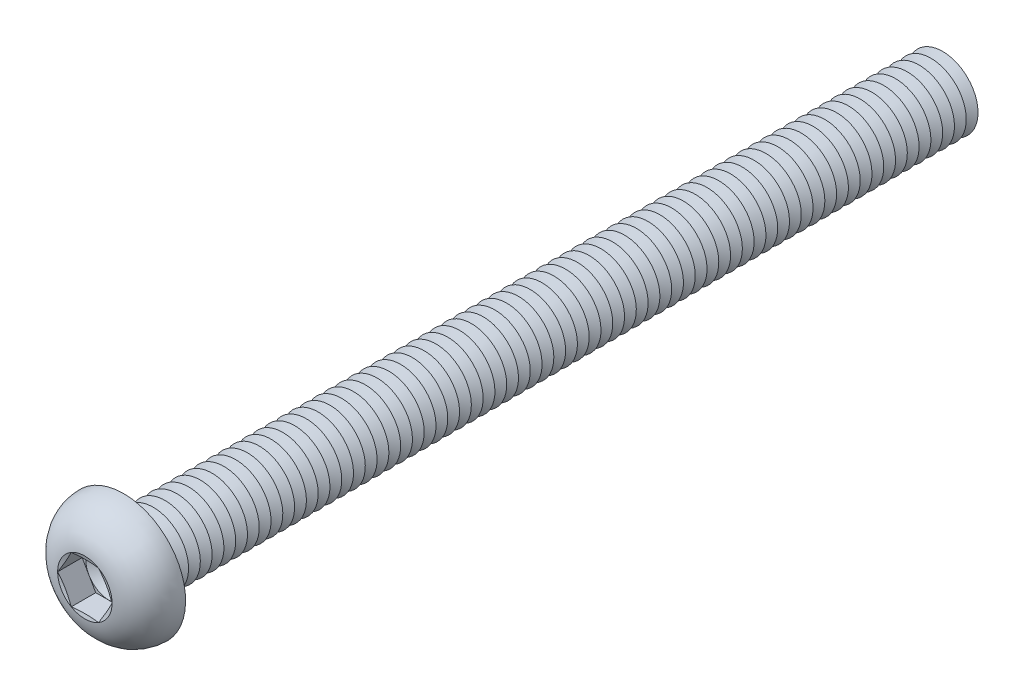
ISO-10303-21;
HEADER;
FILE_DESCRIPTION(('STEP AP214'),'2;1');
FILE_NAME('part.step','',(''),(''),'','','');
FILE_SCHEMA(('AUTOMOTIVE_DESIGN { 1 0 10303 214 1 1 1 1 }'));
ENDSEC;
DATA;
#1=APPLICATION_CONTEXT('core data for automotive mechanical design processes');
#2=APPLICATION_PROTOCOL_DEFINITION('international standard','automotive_design',2000,#1);
#3=PRODUCT_CONTEXT('',#1,'mechanical');
#4=PRODUCT('Part','Part','',(#3));
#5=PRODUCT_RELATED_PRODUCT_CATEGORY('part','',(#4));
#6=PRODUCT_DEFINITION_FORMATION('','',#4);
#7=PRODUCT_DEFINITION_CONTEXT('part definition',#1,'design');
#8=PRODUCT_DEFINITION('design','',#6,#7);
#9=PRODUCT_DEFINITION_SHAPE('','',#8);
#10=(LENGTH_UNIT() NAMED_UNIT(*) SI_UNIT(.MILLI.,.METRE.));
#11=(NAMED_UNIT(*) PLANE_ANGLE_UNIT() SI_UNIT($,.RADIAN.));
#12=(NAMED_UNIT(*) SI_UNIT($,.STERADIAN.) SOLID_ANGLE_UNIT());
#13=UNCERTAINTY_MEASURE_WITH_UNIT(LENGTH_MEASURE(1.E-05),#10,'distance_accuracy_value','');
#14=(GEOMETRIC_REPRESENTATION_CONTEXT(3) GLOBAL_UNCERTAINTY_ASSIGNED_CONTEXT((#13)) GLOBAL_UNIT_ASSIGNED_CONTEXT((#10,
#11,#12)) REPRESENTATION_CONTEXT('',''));
#15=CARTESIAN_POINT('',(0.,0.,0.));
#16=DIRECTION('',(0.,0.,1.));
#17=DIRECTION('',(1.,0.,0.));
#18=AXIS2_PLACEMENT_3D('',#15,#16,#17);
#19=CARTESIAN_POINT('',(0.,0.,1.22));
#20=DIRECTION('',(0.,0.,1.));
#21=DIRECTION('',(1.,0.,0.));
#22=AXIS2_PLACEMENT_3D('',#19,#20,#21);
#23=PLANE('',#22);
#24=CARTESIAN_POINT('',(0.,0.,1.22));
#25=DIRECTION('',(0.,0.,1.));
#26=DIRECTION('',(1.,0.,0.));
#27=AXIS2_PLACEMENT_3D('',#24,#25,#26);
#28=CIRCLE('',#27,1.99999906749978);
#29=CARTESIAN_POINT('',(1.73205,0.999999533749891,1.22));
#30=VERTEX_POINT('',#29);
#31=CARTESIAN_POINT('',(0.,1.99999906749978,1.22));
#32=VERTEX_POINT('',#31);
#33=EDGE_CURVE('E118',#30,#32,#28,.T.);
#34=ORIENTED_EDGE('',*,*,#33,.F.);
#35=DIRECTION('',(-0.5,0.866025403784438,0.));
#36=VECTOR('',#35,1.);
#37=CARTESIAN_POINT('',(2.3094,0.,1.22));
#38=LINE('',#37,#36);
#39=CARTESIAN_POINT('',(1.1547,1.99999906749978,1.22));
#40=VERTEX_POINT('',#39);
#41=EDGE_CURVE('E125',#30,#40,#38,.T.);
#42=ORIENTED_EDGE('',*,*,#41,.T.);
#43=DIRECTION('',(-1.,0.,0.));
#44=VECTOR('',#43,1.);
#45=CARTESIAN_POINT('',(1.1547,1.99999906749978,1.22));
#46=LINE('',#45,#44);
#47=EDGE_CURVE('E136',#40,#32,#46,.T.);
#48=ORIENTED_EDGE('',*,*,#47,.T.);
#49=EDGE_LOOP('',(#34,#42,#48));
#50=FACE_BOUND('',#49,.T.);
#51=ADVANCED_FACE('F39',(#50),#23,.T.);
#52=CARTESIAN_POINT('',(0.,0.,1.22));
#53=DIRECTION('',(0.,0.,1.));
#54=DIRECTION('',(1.,0.,0.));
#55=AXIS2_PLACEMENT_3D('',#52,#53,#54);
#56=CIRCLE('',#55,1.99999906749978);
#57=CARTESIAN_POINT('',(-1.73205,0.999999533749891,1.22));
#58=VERTEX_POINT('',#57);
#59=EDGE_CURVE('E11',#32,#58,#56,.T.);
#60=ORIENTED_EDGE('',*,*,#59,.F.);
#61=CARTESIAN_POINT('',(-1.1547,1.99999906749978,1.22));
#62=VERTEX_POINT('',#61);
#63=EDGE_CURVE('E131',#32,#62,#46,.T.);
#64=ORIENTED_EDGE('',*,*,#63,.T.);
#65=DIRECTION('',(-0.5,-0.866025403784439,0.));
#66=VECTOR('',#65,1.);
#67=CARTESIAN_POINT('',(-1.1547,1.99999906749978,1.22));
#68=LINE('',#67,#66);
#69=EDGE_CURVE('E134',#62,#58,#68,.T.);
#70=ORIENTED_EDGE('',*,*,#69,.T.);
#71=EDGE_LOOP('',(#60,#64,#70));
#72=FACE_BOUND('',#71,.T.);
#73=ADVANCED_FACE('F130',(#72),#23,.T.);
#74=CARTESIAN_POINT('',(-1.73205,-0.999999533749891,1.22));
#75=VERTEX_POINT('',#74);
#76=EDGE_CURVE('E49',#58,#75,#56,.T.);
#77=ORIENTED_EDGE('',*,*,#76,.F.);
#78=CARTESIAN_POINT('',(-2.3094,0.,1.22));
#79=VERTEX_POINT('',#78);
#80=EDGE_CURVE('E143',#58,#79,#68,.T.);
#81=ORIENTED_EDGE('',*,*,#80,.T.);
#82=DIRECTION('',(0.5,-0.866025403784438,0.));
#83=VECTOR('',#82,1.);
#84=CARTESIAN_POINT('',(-2.3094,0.,1.22));
#85=LINE('',#84,#83);
#86=EDGE_CURVE('E152',#79,#75,#85,.T.);
#87=ORIENTED_EDGE('',*,*,#86,.T.);
#88=EDGE_LOOP('',(#77,#81,#87));
#89=FACE_BOUND('',#88,.T.);
#90=ADVANCED_FACE('F827',(#89),#23,.T.);
#91=CARTESIAN_POINT('',(0.,-1.99999906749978,1.22));
#92=VERTEX_POINT('',#91);
#93=EDGE_CURVE('E812',#75,#92,#56,.T.);
#94=ORIENTED_EDGE('',*,*,#93,.F.);
#95=CARTESIAN_POINT('',(-1.1547,-1.99999906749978,1.22));
#96=VERTEX_POINT('',#95);
#97=EDGE_CURVE('E151',#75,#96,#85,.T.);
#98=ORIENTED_EDGE('',*,*,#97,.T.);
#99=DIRECTION('',(1.,0.,0.));
#100=VECTOR('',#99,1.);
#101=CARTESIAN_POINT('',(-1.1547,-1.99999906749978,1.22));
#102=LINE('',#101,#100);
#103=EDGE_CURVE('E157',#96,#92,#102,.T.);
#104=ORIENTED_EDGE('',*,*,#103,.T.);
#105=EDGE_LOOP('',(#94,#98,#104));
#106=FACE_BOUND('',#105,.T.);
#107=ADVANCED_FACE('F820',(#106),#23,.T.);
#108=CARTESIAN_POINT('',(1.73205,-0.999999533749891,1.22));
#109=VERTEX_POINT('',#108);
#110=EDGE_CURVE('E56',#92,#109,#56,.T.);
#111=ORIENTED_EDGE('',*,*,#110,.F.);
#112=CARTESIAN_POINT('',(1.1547,-1.99999906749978,1.22));
#113=VERTEX_POINT('',#112);
#114=EDGE_CURVE('E156',#92,#113,#102,.T.);
#115=ORIENTED_EDGE('',*,*,#114,.T.);
#116=DIRECTION('',(0.5,0.866025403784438,0.));
#117=VECTOR('',#116,1.);
#118=CARTESIAN_POINT('',(1.1547,-1.99999906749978,1.22));
#119=LINE('',#118,#117);
#120=EDGE_CURVE('E162',#113,#109,#119,.T.);
#121=ORIENTED_EDGE('',*,*,#120,.T.);
#122=EDGE_LOOP('',(#111,#115,#121));
#123=FACE_BOUND('',#122,.T.);
#124=ADVANCED_FACE('F896',(#123),#23,.T.);
#125=CARTESIAN_POINT('',(0.,0.,3.3));
#126=DIRECTION('',(0.,0.,1.));
#127=DIRECTION('',(0.,-1.,0.));
#128=AXIS2_PLACEMENT_3D('',#125,#126,#127);
#129=CONICAL_SURFACE('',#128,2.3094,1.30899693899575);
#130=CARTESIAN_POINT('',(2.30951547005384,-0.000200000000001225,3.30003094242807));
#131=CARTESIAN_POINT('',(2.26155412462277,0.082871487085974,3.2871729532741));
#132=CARTESIAN_POINT('',(2.21350580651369,0.166093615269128,3.27549992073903));
#133=CARTESIAN_POINT('',(2.11723944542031,0.332831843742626,3.2549913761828));
#134=CARTESIAN_POINT('',(2.06902134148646,0.416348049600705,3.24615701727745));
#135=CARTESIAN_POINT('',(1.97270782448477,0.583167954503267,3.23184167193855));
#136=CARTESIAN_POINT('',(1.92461306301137,0.666470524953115,3.22634360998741));
#137=CARTESIAN_POINT('',(1.82836219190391,0.833181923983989,3.21897125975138));
#138=CARTESIAN_POINT('',(1.78020609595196,0.916590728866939,3.21709626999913));
#139=CARTESIAN_POINT('',(1.68389390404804,1.08340833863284,3.21709626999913));
#140=CARTESIAN_POINT('',(1.63573780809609,1.16681714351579,3.21897125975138));
#141=CARTESIAN_POINT('',(1.53948693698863,1.33352854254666,3.22634360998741));
#142=CARTESIAN_POINT('',(1.49139217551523,1.41683111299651,3.23184167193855));
#143=CARTESIAN_POINT('',(1.39507865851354,1.58365101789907,3.24615701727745));
#144=CARTESIAN_POINT('',(1.34686055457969,1.66716722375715,3.2549913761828));
#145=CARTESIAN_POINT('',(1.25059419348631,1.83390545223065,3.27549992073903));
#146=CARTESIAN_POINT('',(1.20254587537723,1.9171275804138,3.2871729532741));
#147=CARTESIAN_POINT('',(1.15458452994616,2.00019906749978,3.30003094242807));
#148=B_SPLINE_CURVE_WITH_KNOTS('',3,(#130,#131,#132,#133,#134,#135,#136,#137,#138,#139,#140,
#141,#142,#143,#144,#145,#146,#147),.UNSPECIFIED.,.F.,.F.,(4,2,2,2,2,2,2,2,4),(0.,
0.290357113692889,0.580832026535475,0.869807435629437,1.15872689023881,1.44764634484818,
1.73662175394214,2.02709666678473,2.31745378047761),.UNSPECIFIED.);
#149=CARTESIAN_POINT('',(2.3094,0.,3.3));
#150=VERTEX_POINT('',#149);
#151=CARTESIAN_POINT('',(1.15469999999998,1.99999906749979,3.3));
#152=VERTEX_POINT('',#151);
#153=EDGE_CURVE('E220',#150,#152,#148,.T.);
#154=ORIENTED_EDGE('',*,*,#153,.F.);
#155=CARTESIAN_POINT('',(0.,0.,3.3));
#156=DIRECTION('',(0.,0.,-1.));
#157=DIRECTION('',(0.,1.,0.));
#158=AXIS2_PLACEMENT_3D('',#155,#156,#157);
#159=CIRCLE('',#158,2.3094);
#160=EDGE_CURVE('E795',#152,#150,#159,.T.);
#161=ORIENTED_EDGE('',*,*,#160,.F.);
#162=EDGE_LOOP('',(#154,#161));
#163=FACE_BOUND('',#162,.T.);
#164=ADVANCED_FACE('F900',(#163),#129,.F.);
#165=CARTESIAN_POINT('',(1.15458452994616,-2.00019906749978,3.30003094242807));
#166=CARTESIAN_POINT('',(1.20254587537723,-1.91712758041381,3.2871729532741));
#167=CARTESIAN_POINT('',(1.25059419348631,-1.83390545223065,3.27549992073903));
#168=CARTESIAN_POINT('',(1.34686055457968,-1.66716722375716,3.2549913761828));
#169=CARTESIAN_POINT('',(1.39507865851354,-1.58365101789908,3.24615701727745));
#170=CARTESIAN_POINT('',(1.49139217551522,-1.41683111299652,3.23184167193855));
#171=CARTESIAN_POINT('',(1.53948693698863,-1.33352854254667,3.22634360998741));
#172=CARTESIAN_POINT('',(1.63573780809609,-1.16681714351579,3.21897125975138));
#173=CARTESIAN_POINT('',(1.68389390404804,-1.08340833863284,3.21709626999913));
#174=CARTESIAN_POINT('',(1.78020609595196,-0.916590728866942,3.21709626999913));
#175=CARTESIAN_POINT('',(1.82836219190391,-0.833181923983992,3.21897125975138));
#176=CARTESIAN_POINT('',(1.92461306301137,-0.666470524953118,3.22634360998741));
#177=CARTESIAN_POINT('',(1.97270782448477,-0.58316795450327,3.23184167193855));
#178=CARTESIAN_POINT('',(2.06902134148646,-0.416348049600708,3.24615701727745));
#179=CARTESIAN_POINT('',(2.11723944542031,-0.332831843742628,3.2549913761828));
#180=CARTESIAN_POINT('',(2.21350580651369,-0.16609361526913,3.27549992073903));
#181=CARTESIAN_POINT('',(2.26155412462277,-0.0828714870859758,3.2871729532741));
#182=CARTESIAN_POINT('',(2.30951547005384,0.000199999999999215,3.30003094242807));
#183=B_SPLINE_CURVE_WITH_KNOTS('',3,(#165,#166,#167,#168,#169,#170,#171,#172,#173,#174,#175,
#176,#177,#178,#179,#180,#181,#182),.UNSPECIFIED.,.F.,.F.,(4,2,2,2,2,2,2,2,4),(0.,
0.290357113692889,0.580832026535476,0.869807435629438,1.15872689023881,1.44764634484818,
1.73662175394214,2.02709666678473,2.31745378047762),.UNSPECIFIED.);
#184=CARTESIAN_POINT('',(1.1547,-1.99999906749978,3.3));
#185=VERTEX_POINT('',#184);
#186=EDGE_CURVE('E229',#185,#150,#183,.T.);
#187=ORIENTED_EDGE('',*,*,#186,.F.);
#188=EDGE_CURVE('E800',#150,#185,#159,.T.);
#189=ORIENTED_EDGE('',*,*,#188,.F.);
#190=EDGE_LOOP('',(#187,#189));
#191=FACE_BOUND('',#190,.T.);
#192=ADVANCED_FACE('F863',(#191),#129,.F.);
#193=CARTESIAN_POINT('',(-3.4849337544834,-1.99999906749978,3.75783251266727));
#194=CARTESIAN_POINT('',(-3.40057136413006,-1.99999906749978,3.73822859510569));
#195=CARTESIAN_POINT('',(-3.31617090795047,-1.99999906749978,3.71878852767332));
#196=CARTESIAN_POINT('',(-3.14727791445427,-1.99999906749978,3.68030638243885));
#197=CARTESIAN_POINT('',(-3.06278537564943,-1.99999906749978,3.66126431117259));
#198=CARTESIAN_POINT('',(-2.80911712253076,-1.99999906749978,3.60483420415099));
#199=CARTESIAN_POINT('',(-2.63978343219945,-1.99999906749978,3.5681499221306));
#200=CARTESIAN_POINT('',(-2.29895421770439,-1.99999906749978,3.49717072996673));
#201=CARTESIAN_POINT('',(-2.12745330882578,-1.99999906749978,3.4629014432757));
#202=CARTESIAN_POINT('',(-1.78364663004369,-1.99999906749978,3.39849485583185));
#203=CARTESIAN_POINT('',(-1.61134079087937,-1.99999906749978,3.36835791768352));
#204=CARTESIAN_POINT('',(-1.27040784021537,-1.99999906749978,3.31501553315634));
#205=CARTESIAN_POINT('',(-1.10180724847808,-1.99999906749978,3.291644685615));
#206=CARTESIAN_POINT('',(-0.763641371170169,-1.99999906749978,3.2533727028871));
#207=CARTESIAN_POINT('',(-0.594076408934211,-1.99999906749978,3.23846888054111));
#208=CARTESIAN_POINT('',(-0.339649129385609,-1.99999906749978,3.22431372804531));
#209=CARTESIAN_POINT('',(-0.255009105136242,-1.99999906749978,3.22096057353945));
#210=CARTESIAN_POINT('',(-0.0856618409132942,-1.99999906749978,3.21711210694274));
#211=CARTESIAN_POINT('',(-0.000954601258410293,-1.99999906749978,3.2166167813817));
#212=CARTESIAN_POINT('',(0.16843098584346,-1.99999906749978,3.21851478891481));
#213=CARTESIAN_POINT('',(0.253109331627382,-1.99999906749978,3.2209082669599));
#214=CARTESIAN_POINT('',(0.422344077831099,-1.99999906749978,3.22845792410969));
#215=CARTESIAN_POINT('',(0.506900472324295,-1.99999906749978,3.23361423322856));
#216=CARTESIAN_POINT('',(0.712240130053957,-1.99999906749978,3.24921577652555));
#217=CARTESIAN_POINT('',(0.832922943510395,-1.99999906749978,3.26098285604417));
#218=CARTESIAN_POINT('',(1.07378161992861,-1.99999906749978,3.28874908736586));
#219=CARTESIAN_POINT('',(1.1939575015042,-1.99999906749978,3.30474808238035));
#220=CARTESIAN_POINT('',(1.43419655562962,-1.99999906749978,3.34009172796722));
#221=CARTESIAN_POINT('',(1.55425817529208,-1.99999906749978,3.35944677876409));
#222=CARTESIAN_POINT('',(1.79394991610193,-1.99999906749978,3.40067076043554));
#223=CARTESIAN_POINT('',(1.91358001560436,-1.99999906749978,3.42253981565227));
#224=CARTESIAN_POINT('',(2.15493405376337,-1.99999906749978,3.46864194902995));
#225=CARTESIAN_POINT('',(2.27665041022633,-1.99999906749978,3.49291441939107));
#226=CARTESIAN_POINT('',(2.51977680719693,-1.99999906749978,3.54294628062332));
#227=CARTESIAN_POINT('',(2.64118684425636,-1.99999906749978,3.56870568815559));
#228=CARTESIAN_POINT('',(2.88310060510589,-1.99999906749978,3.62120891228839));
#229=CARTESIAN_POINT('',(3.00360566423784,-1.99999906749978,3.6479466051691));
#230=CARTESIAN_POINT('',(3.24441021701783,-1.99999906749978,3.7022947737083));
#231=CARTESIAN_POINT('',(3.36470972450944,-1.99999906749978,3.72990518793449));
#232=CARTESIAN_POINT('',(3.4849337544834,-1.99999906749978,3.75783251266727));
#233=B_SPLINE_CURVE_WITH_KNOTS('',3,(#193,#194,#195,#196,#197,#198,#199,#200,#201,#202,#203,
#204,#205,#206,#207,#208,#209,#210,#211,#212,#213,#214,#215,#216,#217,#218,#219,#220,#221,#222,
#223,#224,#225,#226,#227,#228,#229,#230,#231,#232),.UNSPECIFIED.,.F.,.F.,(4,2,2,2,2,2,2,2,2,2,2,
2,2,2,2,2,2,2,2,4),(0.,0.259830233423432,0.519664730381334,1.03943435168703,1.56407662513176,
2.08876490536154,2.59926476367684,3.10960251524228,3.36367930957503,3.61775490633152,
3.87184325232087,4.1259435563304,4.48960924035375,4.85326145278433,5.21806142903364,
5.58287945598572,5.95520617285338,6.32753706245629,6.69784064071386,7.06811821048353),.UNSPECIFIED.);
#234=CARTESIAN_POINT('',(-1.1547,-1.99999906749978,3.3));
#235=VERTEX_POINT('',#234);
#236=EDGE_CURVE('E841',#235,#185,#233,.T.);
#237=ORIENTED_EDGE('',*,*,#236,.F.);
#238=EDGE_CURVE('E854',#185,#235,#159,.T.);
#239=ORIENTED_EDGE('',*,*,#238,.F.);
#240=EDGE_LOOP('',(#237,#239));
#241=FACE_BOUND('',#240,.T.);
#242=ADVANCED_FACE('F868',(#241),#129,.F.);
#243=CARTESIAN_POINT('',(-2.30951547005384,0.000199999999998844,3.30003094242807));
#244=CARTESIAN_POINT('',(-2.26155412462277,-0.0828714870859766,3.2871729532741));
#245=CARTESIAN_POINT('',(-2.21350580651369,-0.166093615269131,3.27549992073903));
#246=CARTESIAN_POINT('',(-2.11723944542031,-0.332831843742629,3.2549913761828));
#247=CARTESIAN_POINT('',(-2.06902134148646,-0.416348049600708,3.24615701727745));
#248=CARTESIAN_POINT('',(-1.97270782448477,-0.58316795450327,3.23184167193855));
#249=CARTESIAN_POINT('',(-1.92461306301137,-0.666470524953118,3.22634360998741));
#250=CARTESIAN_POINT('',(-1.82836219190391,-0.833181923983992,3.21897125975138));
#251=CARTESIAN_POINT('',(-1.78020609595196,-0.916590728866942,3.21709626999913));
#252=CARTESIAN_POINT('',(-1.68389390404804,-1.08340833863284,3.21709626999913));
#253=CARTESIAN_POINT('',(-1.63573780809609,-1.16681714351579,3.21897125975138));
#254=CARTESIAN_POINT('',(-1.53948693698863,-1.33352854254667,3.22634360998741));
#255=CARTESIAN_POINT('',(-1.49139217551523,-1.41683111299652,3.23184167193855));
#256=CARTESIAN_POINT('',(-1.39507865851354,-1.58365101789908,3.24615701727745));
#257=CARTESIAN_POINT('',(-1.34686055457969,-1.66716722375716,3.2549913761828));
#258=CARTESIAN_POINT('',(-1.25059419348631,-1.83390545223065,3.27549992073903));
#259=CARTESIAN_POINT('',(-1.20254587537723,-1.91712758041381,3.2871729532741));
#260=CARTESIAN_POINT('',(-1.15458452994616,-2.00019906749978,3.30003094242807));
#261=B_SPLINE_CURVE_WITH_KNOTS('',3,(#243,#244,#245,#246,#247,#248,#249,#250,#251,#252,#253,
#254,#255,#256,#257,#258,#259,#260),.UNSPECIFIED.,.F.,.F.,(4,2,2,2,2,2,2,2,4),(0.,
0.290357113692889,0.580832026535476,0.869807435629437,1.15872689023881,1.44764634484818,
1.73662175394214,2.02709666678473,2.31745378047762),.UNSPECIFIED.);
#262=CARTESIAN_POINT('',(-2.3094,0.,3.3));
#263=VERTEX_POINT('',#262);
#264=EDGE_CURVE('E832',#263,#235,#261,.T.);
#265=ORIENTED_EDGE('',*,*,#264,.F.);
#266=EDGE_CURVE('E838',#235,#263,#159,.T.);
#267=ORIENTED_EDGE('',*,*,#266,.F.);
#268=EDGE_LOOP('',(#265,#267));
#269=FACE_BOUND('',#268,.T.);
#270=ADVANCED_FACE('F836',(#269),#129,.F.);
#271=CARTESIAN_POINT('',(-1.15458452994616,2.00019906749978,3.30003094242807));
#272=CARTESIAN_POINT('',(-1.20254587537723,1.9171275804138,3.2871729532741));
#273=CARTESIAN_POINT('',(-1.25059419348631,1.83390545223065,3.27549992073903));
#274=CARTESIAN_POINT('',(-1.34686055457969,1.66716722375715,3.2549913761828));
#275=CARTESIAN_POINT('',(-1.39507865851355,1.58365101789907,3.24615701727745));
#276=CARTESIAN_POINT('',(-1.49139217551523,1.41683111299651,3.23184167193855));
#277=CARTESIAN_POINT('',(-1.53948693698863,1.33352854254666,3.22634360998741));
#278=CARTESIAN_POINT('',(-1.63573780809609,1.16681714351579,3.21897125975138));
#279=CARTESIAN_POINT('',(-1.68389390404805,1.08340833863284,3.21709626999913));
#280=CARTESIAN_POINT('',(-1.78020609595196,0.916590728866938,3.21709626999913));
#281=CARTESIAN_POINT('',(-1.82836219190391,0.833181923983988,3.21897125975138));
#282=CARTESIAN_POINT('',(-1.92461306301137,0.666470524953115,3.22634360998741));
#283=CARTESIAN_POINT('',(-1.97270782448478,0.583167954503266,3.23184167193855));
#284=CARTESIAN_POINT('',(-2.06902134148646,0.416348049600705,3.24615701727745));
#285=CARTESIAN_POINT('',(-2.11723944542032,0.332831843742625,3.2549913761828));
#286=CARTESIAN_POINT('',(-2.21350580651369,0.166093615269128,3.27549992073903));
#287=CARTESIAN_POINT('',(-2.26155412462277,0.0828714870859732,3.2871729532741));
#288=CARTESIAN_POINT('',(-2.30951547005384,-0.000200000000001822,3.30003094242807));
#289=B_SPLINE_CURVE_WITH_KNOTS('',3,(#271,#272,#273,#274,#275,#276,#277,#278,#279,#280,#281,
#282,#283,#284,#285,#286,#287,#288),.UNSPECIFIED.,.F.,.F.,(4,2,2,2,2,2,2,2,4),(0.,
0.290357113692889,0.580832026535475,0.869807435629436,1.15872689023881,1.44764634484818,
1.73662175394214,2.02709666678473,2.31745378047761),.UNSPECIFIED.);
#290=CARTESIAN_POINT('',(-1.1547,1.99999906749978,3.3));
#291=VERTEX_POINT('',#290);
#292=EDGE_CURVE('E194',#291,#263,#289,.T.);
#293=ORIENTED_EDGE('',*,*,#292,.F.);
#294=EDGE_CURVE('E844',#263,#291,#159,.T.);
#295=ORIENTED_EDGE('',*,*,#294,.F.);
#296=EDGE_LOOP('',(#293,#295));
#297=FACE_BOUND('',#296,.T.);
#298=ADVANCED_FACE('F845',(#297),#129,.F.);
#299=CARTESIAN_POINT('',(0.,0.,-66.5));
#300=DIRECTION('',(0.,0.,1.));
#301=DIRECTION('',(0.,-1.,0.));
#302=AXIS2_PLACEMENT_3D('',#299,#300,#301);
#303=CONICAL_SURFACE('',#302,2.99999999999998,1.0471975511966);
#304=CARTESIAN_POINT('',(0.,0.,-67.));
#305=DIRECTION('',(0.,0.,1.));
#306=DIRECTION('',(0.,-1.,0.));
#307=AXIS2_PLACEMENT_3D('',#304,#305,#306);
#308=CIRCLE('',#307,2.13397459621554);
#309=CARTESIAN_POINT('',(0.,-2.1339745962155,-67.));
#310=VERTEX_POINT('',#309);
#311=EDGE_CURVE('E767',#310,#310,#308,.T.);
#312=ORIENTED_EDGE('',*,*,#311,.T.);
#313=EDGE_LOOP('',(#312));
#314=FACE_BOUND('',#313,.T.);
#315=CARTESIAN_POINT('',(0.,0.,-66.5));
#316=DIRECTION('',(0.,0.,1.));
#317=DIRECTION('',(0.,-1.,0.));
#318=AXIS2_PLACEMENT_3D('',#315,#316,#317);
#319=CIRCLE('',#318,2.99999999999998);
#320=CARTESIAN_POINT('',(0.,-2.99999999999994,-66.5));
#321=VERTEX_POINT('',#320);
#322=EDGE_CURVE('E763',#321,#321,#319,.T.);
#323=ORIENTED_EDGE('',*,*,#322,.F.);
#324=EDGE_LOOP('',(#323));
#325=FACE_BOUND('',#324,.T.);
#326=ADVANCED_FACE('F928',(#314,#325),#303,.T.);
#327=CARTESIAN_POINT('',(0.,0.,-67.));
#328=DIRECTION('',(0.,0.,-1.));
#329=DIRECTION('',(0.,1.,0.));
#330=AXIS2_PLACEMENT_3D('',#327,#328,#329);
#331=CONICAL_SURFACE('',#330,2.13397459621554,1.0471975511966);
#332=CARTESIAN_POINT('',(0.,0.,-67.5));
#333=DIRECTION('',(0.,0.,1.));
#334=DIRECTION('',(0.,-1.,0.));
#335=AXIS2_PLACEMENT_3D('',#332,#333,#334);
#336=CIRCLE('',#335,2.99999999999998);
#337=CARTESIAN_POINT('',(0.,-2.99999999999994,-67.5));
#338=VERTEX_POINT('',#337);
#339=EDGE_CURVE('E771',#338,#338,#336,.T.);
#340=ORIENTED_EDGE('',*,*,#339,.T.);
#341=EDGE_LOOP('',(#340));
#342=FACE_BOUND('',#341,.T.);
#343=ORIENTED_EDGE('',*,*,#311,.F.);
#344=EDGE_LOOP('',(#343));
#345=FACE_BOUND('',#344,.T.);
#346=ADVANCED_FACE('F933',(#342,#345),#331,.T.);
#347=CARTESIAN_POINT('',(0.,2.99999999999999,-70.));
#348=DIRECTION('',(0.,0.,-1.));
#349=DIRECTION('',(0.,1.,0.));
#350=AXIS2_PLACEMENT_3D('',#347,#348,#349);
#351=PLANE('',#350);
#352=CARTESIAN_POINT('',(0.,0.,-70.));
#353=DIRECTION('',(0.,0.,1.));
#354=DIRECTION('',(0.,-1.,0.));
#355=AXIS2_PLACEMENT_3D('',#352,#353,#354);
#356=CIRCLE('',#355,2.13397459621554);
#357=CARTESIAN_POINT('',(0.,-2.1339745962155,-70.));
#358=VERTEX_POINT('',#357);
#359=EDGE_CURVE('E790',#358,#358,#356,.T.);
#360=ORIENTED_EDGE('',*,*,#359,.F.);
#361=EDGE_LOOP('',(#360));
#362=FACE_BOUND('',#361,.T.);
#363=ADVANCED_FACE('F1100',(#362),#351,.T.);
#364=CARTESIAN_POINT('',(0.,0.,-69.5));
#365=DIRECTION('',(0.,0.,1.));
#366=DIRECTION('',(0.,-1.,0.));
#367=AXIS2_PLACEMENT_3D('',#364,#365,#366);
#368=CONICAL_SURFACE('',#367,2.99999999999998,1.0471975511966);
#369=ORIENTED_EDGE('',*,*,#359,.T.);
#370=EDGE_LOOP('',(#369));
#371=FACE_BOUND('',#370,.T.);
#372=CARTESIAN_POINT('',(0.,0.,-69.5));
#373=DIRECTION('',(0.,0.,1.));
#374=DIRECTION('',(0.,-1.,0.));
#375=AXIS2_PLACEMENT_3D('',#372,#373,#374);
#376=CIRCLE('',#375,2.99999999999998);
#377=CARTESIAN_POINT('',(0.,-2.99999999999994,-69.5));
#378=VERTEX_POINT('',#377);
#379=EDGE_CURVE('E787',#378,#378,#376,.T.);
#380=ORIENTED_EDGE('',*,*,#379,.F.);
#381=EDGE_LOOP('',(#380));
#382=FACE_BOUND('',#381,.T.);
#383=ADVANCED_FACE('F1093',(#371,#382),#368,.T.);
#384=CARTESIAN_POINT('',(0.,0.,-69.));
#385=DIRECTION('',(0.,0.,-1.));
#386=DIRECTION('',(0.,1.,0.));
#387=AXIS2_PLACEMENT_3D('',#384,#385,#386);
#388=CONICAL_SURFACE('',#387,2.13397459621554,1.0471975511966);
#389=ORIENTED_EDGE('',*,*,#379,.T.);
#390=EDGE_LOOP('',(#389));
#391=FACE_BOUND('',#390,.T.);
#392=CARTESIAN_POINT('',(0.,0.,-69.));
#393=DIRECTION('',(0.,0.,1.));
#394=DIRECTION('',(0.,-1.,0.));
#395=AXIS2_PLACEMENT_3D('',#392,#393,#394);
#396=CIRCLE('',#395,2.13397459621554);
#397=CARTESIAN_POINT('',(0.,-2.1339745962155,-69.));
#398=VERTEX_POINT('',#397);
#399=EDGE_CURVE('E783',#398,#398,#396,.T.);
#400=ORIENTED_EDGE('',*,*,#399,.F.);
#401=EDGE_LOOP('',(#400));
#402=FACE_BOUND('',#401,.T.);
#403=ADVANCED_FACE('F1099',(#391,#402),#388,.T.);
#404=CARTESIAN_POINT('',(0.,0.,-68.5));
#405=DIRECTION('',(0.,0.,1.));
#406=DIRECTION('',(0.,-1.,0.));
#407=AXIS2_PLACEMENT_3D('',#404,#405,#406);
#408=CONICAL_SURFACE('',#407,2.99999999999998,1.0471975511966);
#409=ORIENTED_EDGE('',*,*,#399,.T.);
#410=EDGE_LOOP('',(#409));
#411=FACE_BOUND('',#410,.T.);
#412=CARTESIAN_POINT('',(0.,0.,-68.5));
#413=DIRECTION('',(0.,0.,1.));
#414=DIRECTION('',(0.,-1.,0.));
#415=AXIS2_PLACEMENT_3D('',#412,#413,#414);
#416=CIRCLE('',#415,2.99999999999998);
#417=CARTESIAN_POINT('',(0.,-2.99999999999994,-68.5));
#418=VERTEX_POINT('',#417);
#419=EDGE_CURVE('E779',#418,#418,#416,.T.);
#420=ORIENTED_EDGE('',*,*,#419,.F.);
#421=EDGE_LOOP('',(#420));
#422=FACE_BOUND('',#421,.T.);
#423=ADVANCED_FACE('F1131',(#411,#422),#408,.T.);
#424=CARTESIAN_POINT('',(0.,0.,-68.));
#425=DIRECTION('',(0.,0.,-1.));
#426=DIRECTION('',(0.,1.,0.));
#427=AXIS2_PLACEMENT_3D('',#424,#425,#426);
#428=CONICAL_SURFACE('',#427,2.13397459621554,1.0471975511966);
#429=ORIENTED_EDGE('',*,*,#419,.T.);
#430=EDGE_LOOP('',(#429));
#431=FACE_BOUND('',#430,.T.);
#432=CARTESIAN_POINT('',(0.,0.,-68.));
#433=DIRECTION('',(0.,0.,1.));
#434=DIRECTION('',(0.,-1.,0.));
#435=AXIS2_PLACEMENT_3D('',#432,#433,#434);
#436=CIRCLE('',#435,2.13397459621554);
#437=CARTESIAN_POINT('',(0.,-2.1339745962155,-68.));
#438=VERTEX_POINT('',#437);
#439=EDGE_CURVE('E775',#438,#438,#436,.T.);
#440=ORIENTED_EDGE('',*,*,#439,.F.);
#441=EDGE_LOOP('',(#440));
#442=FACE_BOUND('',#441,.T.);
#443=ADVANCED_FACE('F1141',(#431,#442),#428,.T.);
#444=CARTESIAN_POINT('',(0.,0.,-67.5));
#445=DIRECTION('',(0.,0.,1.));
#446=DIRECTION('',(0.,-1.,0.));
#447=AXIS2_PLACEMENT_3D('',#444,#445,#446);
#448=CONICAL_SURFACE('',#447,2.99999999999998,1.0471975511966);
#449=ORIENTED_EDGE('',*,*,#439,.T.);
#450=EDGE_LOOP('',(#449));
#451=FACE_BOUND('',#450,.T.);
#452=ORIENTED_EDGE('',*,*,#339,.F.);
#453=EDGE_LOOP('',(#452));
#454=FACE_BOUND('',#453,.T.);
#455=ADVANCED_FACE('F1151',(#451,#454),#448,.T.);
#456=CARTESIAN_POINT('',(0.,0.,-65.5));
#457=DIRECTION('',(0.,0.,1.));
#458=DIRECTION('',(0.,-1.,0.));
#459=AXIS2_PLACEMENT_3D('',#456,#457,#458);
#460=CONICAL_SURFACE('',#459,2.99999999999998,1.0471975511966);
#461=CARTESIAN_POINT('',(0.,0.,-66.));
#462=DIRECTION('',(0.,0.,1.));
#463=DIRECTION('',(0.,-1.,0.));
#464=AXIS2_PLACEMENT_3D('',#461,#462,#463);
#465=CIRCLE('',#464,2.13397459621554);
#466=CARTESIAN_POINT('',(0.,-2.1339745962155,-66.));
#467=VERTEX_POINT('',#466);
#468=EDGE_CURVE('E759',#467,#467,#465,.T.);
#469=ORIENTED_EDGE('',*,*,#468,.T.);
#470=EDGE_LOOP('',(#469));
#471=FACE_BOUND('',#470,.T.);
#472=CARTESIAN_POINT('',(0.,0.,-65.5));
#473=DIRECTION('',(0.,0.,1.));
#474=DIRECTION('',(0.,-1.,0.));
#475=AXIS2_PLACEMENT_3D('',#472,#473,#474);
#476=CIRCLE('',#475,2.99999999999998);
#477=CARTESIAN_POINT('',(0.,-2.99999999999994,-65.5));
#478=VERTEX_POINT('',#477);
#479=EDGE_CURVE('E755',#478,#478,#476,.T.);
#480=ORIENTED_EDGE('',*,*,#479,.F.);
#481=EDGE_LOOP('',(#480));
#482=FACE_BOUND('',#481,.T.);
#483=ADVANCED_FACE('F1161',(#471,#482),#460,.T.);
#484=CARTESIAN_POINT('',(0.,0.,-66.));
#485=DIRECTION('',(0.,0.,-1.));
#486=DIRECTION('',(0.,1.,0.));
#487=AXIS2_PLACEMENT_3D('',#484,#485,#486);
#488=CONICAL_SURFACE('',#487,2.13397459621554,1.0471975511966);
#489=ORIENTED_EDGE('',*,*,#322,.T.);
#490=EDGE_LOOP('',(#489));
#491=FACE_BOUND('',#490,.T.);
#492=ORIENTED_EDGE('',*,*,#468,.F.);
#493=EDGE_LOOP('',(#492));
#494=FACE_BOUND('',#493,.T.);
#495=ADVANCED_FACE('F1171',(#491,#494),#488,.T.);
#496=CARTESIAN_POINT('',(0.,0.,-64.5));
#497=DIRECTION('',(0.,0.,1.));
#498=DIRECTION('',(0.,-1.,0.));
#499=AXIS2_PLACEMENT_3D('',#496,#497,#498);
#500=CONICAL_SURFACE('',#499,2.99999999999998,1.0471975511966);
#501=CARTESIAN_POINT('',(0.,0.,-65.));
#502=DIRECTION('',(0.,0.,1.));
#503=DIRECTION('',(0.,-1.,0.));
#504=AXIS2_PLACEMENT_3D('',#501,#502,#503);
#505=CIRCLE('',#504,2.13397459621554);
#506=CARTESIAN_POINT('',(0.,-2.1339745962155,-65.));
#507=VERTEX_POINT('',#506);
#508=EDGE_CURVE('E751',#507,#507,#505,.T.);
#509=ORIENTED_EDGE('',*,*,#508,.T.);
#510=EDGE_LOOP('',(#509));
#511=FACE_BOUND('',#510,.T.);
#512=CARTESIAN_POINT('',(0.,0.,-64.5));
#513=DIRECTION('',(0.,0.,1.));
#514=DIRECTION('',(0.,-1.,0.));
#515=AXIS2_PLACEMENT_3D('',#512,#513,#514);
#516=CIRCLE('',#515,2.99999999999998);
#517=CARTESIAN_POINT('',(0.,-2.99999999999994,-64.5));
#518=VERTEX_POINT('',#517);
#519=EDGE_CURVE('E747',#518,#518,#516,.T.);
#520=ORIENTED_EDGE('',*,*,#519,.F.);
#521=EDGE_LOOP('',(#520));
#522=FACE_BOUND('',#521,.T.);
#523=ADVANCED_FACE('F1181',(#511,#522),#500,.T.);
#524=CARTESIAN_POINT('',(0.,0.,-65.));
#525=DIRECTION('',(0.,0.,-1.));
#526=DIRECTION('',(0.,1.,0.));
#527=AXIS2_PLACEMENT_3D('',#524,#525,#526);
#528=CONICAL_SURFACE('',#527,2.13397459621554,1.0471975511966);
#529=ORIENTED_EDGE('',*,*,#479,.T.);
#530=EDGE_LOOP('',(#529));
#531=FACE_BOUND('',#530,.T.);
#532=ORIENTED_EDGE('',*,*,#508,.F.);
#533=EDGE_LOOP('',(#532));
#534=FACE_BOUND('',#533,.T.);
#535=ADVANCED_FACE('F1191',(#531,#534),#528,.T.);
#536=CARTESIAN_POINT('',(0.,0.,-63.5));
#537=DIRECTION('',(0.,0.,1.));
#538=DIRECTION('',(0.,-1.,0.));
#539=AXIS2_PLACEMENT_3D('',#536,#537,#538);
#540=CONICAL_SURFACE('',#539,2.99999999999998,1.0471975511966);
#541=CARTESIAN_POINT('',(0.,0.,-64.));
#542=DIRECTION('',(0.,0.,1.));
#543=DIRECTION('',(0.,-1.,0.));
#544=AXIS2_PLACEMENT_3D('',#541,#542,#543);
#545=CIRCLE('',#544,2.13397459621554);
#546=CARTESIAN_POINT('',(0.,-2.1339745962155,-64.));
#547=VERTEX_POINT('',#546);
#548=EDGE_CURVE('E743',#547,#547,#545,.T.);
#549=ORIENTED_EDGE('',*,*,#548,.T.);
#550=EDGE_LOOP('',(#549));
#551=FACE_BOUND('',#550,.T.);
#552=CARTESIAN_POINT('',(0.,0.,-63.5));
#553=DIRECTION('',(0.,0.,1.));
#554=DIRECTION('',(0.,-1.,0.));
#555=AXIS2_PLACEMENT_3D('',#552,#553,#554);
#556=CIRCLE('',#555,2.99999999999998);
#557=CARTESIAN_POINT('',(0.,-2.99999999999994,-63.5));
#558=VERTEX_POINT('',#557);
#559=EDGE_CURVE('E739',#558,#558,#556,.T.);
#560=ORIENTED_EDGE('',*,*,#559,.F.);
#561=EDGE_LOOP('',(#560));
#562=FACE_BOUND('',#561,.T.);
#563=ADVANCED_FACE('F1201',(#551,#562),#540,.T.);
#564=CARTESIAN_POINT('',(0.,0.,-64.));
#565=DIRECTION('',(0.,0.,-1.));
#566=DIRECTION('',(0.,1.,0.));
#567=AXIS2_PLACEMENT_3D('',#564,#565,#566);
#568=CONICAL_SURFACE('',#567,2.13397459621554,1.0471975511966);
#569=ORIENTED_EDGE('',*,*,#519,.T.);
#570=EDGE_LOOP('',(#569));
#571=FACE_BOUND('',#570,.T.);
#572=ORIENTED_EDGE('',*,*,#548,.F.);
#573=EDGE_LOOP('',(#572));
#574=FACE_BOUND('',#573,.T.);
#575=ADVANCED_FACE('F1211',(#571,#574),#568,.T.);
#576=CARTESIAN_POINT('',(0.,0.,-62.5));
#577=DIRECTION('',(0.,0.,1.));
#578=DIRECTION('',(0.,-1.,0.));
#579=AXIS2_PLACEMENT_3D('',#576,#577,#578);
#580=CONICAL_SURFACE('',#579,2.99999999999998,1.0471975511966);
#581=CARTESIAN_POINT('',(0.,0.,-63.));
#582=DIRECTION('',(0.,0.,1.));
#583=DIRECTION('',(0.,-1.,0.));
#584=AXIS2_PLACEMENT_3D('',#581,#582,#583);
#585=CIRCLE('',#584,2.13397459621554);
#586=CARTESIAN_POINT('',(0.,-2.1339745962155,-63.));
#587=VERTEX_POINT('',#586);
#588=EDGE_CURVE('E735',#587,#587,#585,.T.);
#589=ORIENTED_EDGE('',*,*,#588,.T.);
#590=EDGE_LOOP('',(#589));
#591=FACE_BOUND('',#590,.T.);
#592=CARTESIAN_POINT('',(0.,0.,-62.5));
#593=DIRECTION('',(0.,0.,1.));
#594=DIRECTION('',(0.,-1.,0.));
#595=AXIS2_PLACEMENT_3D('',#592,#593,#594);
#596=CIRCLE('',#595,2.99999999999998);
#597=CARTESIAN_POINT('',(0.,-2.99999999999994,-62.5));
#598=VERTEX_POINT('',#597);
#599=EDGE_CURVE('E731',#598,#598,#596,.T.);
#600=ORIENTED_EDGE('',*,*,#599,.F.);
#601=EDGE_LOOP('',(#600));
#602=FACE_BOUND('',#601,.T.);
#603=ADVANCED_FACE('F1221',(#591,#602),#580,.T.);
#604=CARTESIAN_POINT('',(0.,0.,-63.));
#605=DIRECTION('',(0.,0.,-1.));
#606=DIRECTION('',(0.,1.,0.));
#607=AXIS2_PLACEMENT_3D('',#604,#605,#606);
#608=CONICAL_SURFACE('',#607,2.13397459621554,1.0471975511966);
#609=ORIENTED_EDGE('',*,*,#559,.T.);
#610=EDGE_LOOP('',(#609));
#611=FACE_BOUND('',#610,.T.);
#612=ORIENTED_EDGE('',*,*,#588,.F.);
#613=EDGE_LOOP('',(#612));
#614=FACE_BOUND('',#613,.T.);
#615=ADVANCED_FACE('F1231',(#611,#614),#608,.T.);
#616=CARTESIAN_POINT('',(0.,0.,-61.5));
#617=DIRECTION('',(0.,0.,1.));
#618=DIRECTION('',(0.,-1.,0.));
#619=AXIS2_PLACEMENT_3D('',#616,#617,#618);
#620=CONICAL_SURFACE('',#619,2.99999999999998,1.0471975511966);
#621=CARTESIAN_POINT('',(0.,0.,-62.));
#622=DIRECTION('',(0.,0.,1.));
#623=DIRECTION('',(0.,-1.,0.));
#624=AXIS2_PLACEMENT_3D('',#621,#622,#623);
#625=CIRCLE('',#624,2.13397459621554);
#626=CARTESIAN_POINT('',(0.,-2.1339745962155,-62.));
#627=VERTEX_POINT('',#626);
#628=EDGE_CURVE('E727',#627,#627,#625,.T.);
#629=ORIENTED_EDGE('',*,*,#628,.T.);
#630=EDGE_LOOP('',(#629));
#631=FACE_BOUND('',#630,.T.);
#632=CARTESIAN_POINT('',(0.,0.,-61.5));
#633=DIRECTION('',(0.,0.,1.));
#634=DIRECTION('',(0.,-1.,0.));
#635=AXIS2_PLACEMENT_3D('',#632,#633,#634);
#636=CIRCLE('',#635,2.99999999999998);
#637=CARTESIAN_POINT('',(0.,-2.99999999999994,-61.5));
#638=VERTEX_POINT('',#637);
#639=EDGE_CURVE('E723',#638,#638,#636,.T.);
#640=ORIENTED_EDGE('',*,*,#639,.F.);
#641=EDGE_LOOP('',(#640));
#642=FACE_BOUND('',#641,.T.);
#643=ADVANCED_FACE('F1241',(#631,#642),#620,.T.);
#644=CARTESIAN_POINT('',(0.,0.,-62.));
#645=DIRECTION('',(0.,0.,-1.));
#646=DIRECTION('',(0.,1.,0.));
#647=AXIS2_PLACEMENT_3D('',#644,#645,#646);
#648=CONICAL_SURFACE('',#647,2.13397459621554,1.0471975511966);
#649=ORIENTED_EDGE('',*,*,#599,.T.);
#650=EDGE_LOOP('',(#649));
#651=FACE_BOUND('',#650,.T.);
#652=ORIENTED_EDGE('',*,*,#628,.F.);
#653=EDGE_LOOP('',(#652));
#654=FACE_BOUND('',#653,.T.);
#655=ADVANCED_FACE('F1251',(#651,#654),#648,.T.);
#656=CARTESIAN_POINT('',(0.,0.,-60.5));
#657=DIRECTION('',(0.,0.,1.));
#658=DIRECTION('',(0.,-1.,0.));
#659=AXIS2_PLACEMENT_3D('',#656,#657,#658);
#660=CONICAL_SURFACE('',#659,2.99999999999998,1.0471975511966);
#661=CARTESIAN_POINT('',(0.,0.,-61.));
#662=DIRECTION('',(0.,0.,1.));
#663=DIRECTION('',(0.,-1.,0.));
#664=AXIS2_PLACEMENT_3D('',#661,#662,#663);
#665=CIRCLE('',#664,2.13397459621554);
#666=CARTESIAN_POINT('',(0.,-2.13397459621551,-61.));
#667=VERTEX_POINT('',#666);
#668=EDGE_CURVE('E719',#667,#667,#665,.T.);
#669=ORIENTED_EDGE('',*,*,#668,.T.);
#670=EDGE_LOOP('',(#669));
#671=FACE_BOUND('',#670,.T.);
#672=CARTESIAN_POINT('',(0.,0.,-60.5));
#673=DIRECTION('',(0.,0.,1.));
#674=DIRECTION('',(0.,-1.,0.));
#675=AXIS2_PLACEMENT_3D('',#672,#673,#674);
#676=CIRCLE('',#675,2.99999999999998);
#677=CARTESIAN_POINT('',(0.,-2.99999999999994,-60.5));
#678=VERTEX_POINT('',#677);
#679=EDGE_CURVE('E715',#678,#678,#676,.T.);
#680=ORIENTED_EDGE('',*,*,#679,.F.);
#681=EDGE_LOOP('',(#680));
#682=FACE_BOUND('',#681,.T.);
#683=ADVANCED_FACE('F1261',(#671,#682),#660,.T.);
#684=CARTESIAN_POINT('',(0.,0.,-61.));
#685=DIRECTION('',(0.,0.,-1.));
#686=DIRECTION('',(0.,1.,0.));
#687=AXIS2_PLACEMENT_3D('',#684,#685,#686);
#688=CONICAL_SURFACE('',#687,2.13397459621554,1.0471975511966);
#689=ORIENTED_EDGE('',*,*,#639,.T.);
#690=EDGE_LOOP('',(#689));
#691=FACE_BOUND('',#690,.T.);
#692=ORIENTED_EDGE('',*,*,#668,.F.);
#693=EDGE_LOOP('',(#692));
#694=FACE_BOUND('',#693,.T.);
#695=ADVANCED_FACE('F1271',(#691,#694),#688,.T.);
#696=CARTESIAN_POINT('',(0.,0.,-59.5));
#697=DIRECTION('',(0.,0.,1.));
#698=DIRECTION('',(0.,-1.,0.));
#699=AXIS2_PLACEMENT_3D('',#696,#697,#698);
#700=CONICAL_SURFACE('',#699,2.99999999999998,1.0471975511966);
#701=CARTESIAN_POINT('',(0.,0.,-60.));
#702=DIRECTION('',(0.,0.,1.));
#703=DIRECTION('',(0.,-1.,0.));
#704=AXIS2_PLACEMENT_3D('',#701,#702,#703);
#705=CIRCLE('',#704,2.13397459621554);
#706=CARTESIAN_POINT('',(0.,-2.13397459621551,-60.));
#707=VERTEX_POINT('',#706);
#708=EDGE_CURVE('E711',#707,#707,#705,.T.);
#709=ORIENTED_EDGE('',*,*,#708,.T.);
#710=EDGE_LOOP('',(#709));
#711=FACE_BOUND('',#710,.T.);
#712=CARTESIAN_POINT('',(0.,0.,-59.5));
#713=DIRECTION('',(0.,0.,1.));
#714=DIRECTION('',(0.,-1.,0.));
#715=AXIS2_PLACEMENT_3D('',#712,#713,#714);
#716=CIRCLE('',#715,2.99999999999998);
#717=CARTESIAN_POINT('',(0.,-2.99999999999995,-59.5));
#718=VERTEX_POINT('',#717);
#719=EDGE_CURVE('E707',#718,#718,#716,.T.);
#720=ORIENTED_EDGE('',*,*,#719,.F.);
#721=EDGE_LOOP('',(#720));
#722=FACE_BOUND('',#721,.T.);
#723=ADVANCED_FACE('F1281',(#711,#722),#700,.T.);
#724=CARTESIAN_POINT('',(0.,0.,-60.));
#725=DIRECTION('',(0.,0.,-1.));
#726=DIRECTION('',(0.,1.,0.));
#727=AXIS2_PLACEMENT_3D('',#724,#725,#726);
#728=CONICAL_SURFACE('',#727,2.13397459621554,1.0471975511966);
#729=ORIENTED_EDGE('',*,*,#679,.T.);
#730=EDGE_LOOP('',(#729));
#731=FACE_BOUND('',#730,.T.);
#732=ORIENTED_EDGE('',*,*,#708,.F.);
#733=EDGE_LOOP('',(#732));
#734=FACE_BOUND('',#733,.T.);
#735=ADVANCED_FACE('F1291',(#731,#734),#728,.T.);
#736=CARTESIAN_POINT('',(0.,0.,-58.5));
#737=DIRECTION('',(0.,0.,1.));
#738=DIRECTION('',(0.,-1.,0.));
#739=AXIS2_PLACEMENT_3D('',#736,#737,#738);
#740=CONICAL_SURFACE('',#739,2.99999999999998,1.0471975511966);
#741=CARTESIAN_POINT('',(0.,0.,-59.));
#742=DIRECTION('',(0.,0.,1.));
#743=DIRECTION('',(0.,-1.,0.));
#744=AXIS2_PLACEMENT_3D('',#741,#742,#743);
#745=CIRCLE('',#744,2.13397459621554);
#746=CARTESIAN_POINT('',(0.,-2.13397459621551,-59.));
#747=VERTEX_POINT('',#746);
#748=EDGE_CURVE('E703',#747,#747,#745,.T.);
#749=ORIENTED_EDGE('',*,*,#748,.T.);
#750=EDGE_LOOP('',(#749));
#751=FACE_BOUND('',#750,.T.);
#752=CARTESIAN_POINT('',(0.,0.,-58.5));
#753=DIRECTION('',(0.,0.,1.));
#754=DIRECTION('',(0.,-1.,0.));
#755=AXIS2_PLACEMENT_3D('',#752,#753,#754);
#756=CIRCLE('',#755,2.99999999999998);
#757=CARTESIAN_POINT('',(0.,-2.99999999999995,-58.5));
#758=VERTEX_POINT('',#757);
#759=EDGE_CURVE('E699',#758,#758,#756,.T.);
#760=ORIENTED_EDGE('',*,*,#759,.F.);
#761=EDGE_LOOP('',(#760));
#762=FACE_BOUND('',#761,.T.);
#763=ADVANCED_FACE('F1301',(#751,#762),#740,.T.);
#764=CARTESIAN_POINT('',(0.,0.,-59.));
#765=DIRECTION('',(0.,0.,-1.));
#766=DIRECTION('',(0.,1.,0.));
#767=AXIS2_PLACEMENT_3D('',#764,#765,#766);
#768=CONICAL_SURFACE('',#767,2.13397459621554,1.0471975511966);
#769=ORIENTED_EDGE('',*,*,#719,.T.);
#770=EDGE_LOOP('',(#769));
#771=FACE_BOUND('',#770,.T.);
#772=ORIENTED_EDGE('',*,*,#748,.F.);
#773=EDGE_LOOP('',(#772));
#774=FACE_BOUND('',#773,.T.);
#775=ADVANCED_FACE('F1311',(#771,#774),#768,.T.);
#776=CARTESIAN_POINT('',(0.,0.,-57.5));
#777=DIRECTION('',(0.,0.,1.));
#778=DIRECTION('',(0.,-1.,0.));
#779=AXIS2_PLACEMENT_3D('',#776,#777,#778);
#780=CONICAL_SURFACE('',#779,2.99999999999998,1.0471975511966);
#781=CARTESIAN_POINT('',(0.,0.,-58.));
#782=DIRECTION('',(0.,0.,1.));
#783=DIRECTION('',(0.,-1.,0.));
#784=AXIS2_PLACEMENT_3D('',#781,#782,#783);
#785=CIRCLE('',#784,2.13397459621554);
#786=CARTESIAN_POINT('',(0.,-2.13397459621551,-58.));
#787=VERTEX_POINT('',#786);
#788=EDGE_CURVE('E695',#787,#787,#785,.T.);
#789=ORIENTED_EDGE('',*,*,#788,.T.);
#790=EDGE_LOOP('',(#789));
#791=FACE_BOUND('',#790,.T.);
#792=CARTESIAN_POINT('',(0.,0.,-57.5));
#793=DIRECTION('',(0.,0.,1.));
#794=DIRECTION('',(0.,-1.,0.));
#795=AXIS2_PLACEMENT_3D('',#792,#793,#794);
#796=CIRCLE('',#795,2.99999999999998);
#797=CARTESIAN_POINT('',(0.,-2.99999999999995,-57.5));
#798=VERTEX_POINT('',#797);
#799=EDGE_CURVE('E691',#798,#798,#796,.T.);
#800=ORIENTED_EDGE('',*,*,#799,.F.);
#801=EDGE_LOOP('',(#800));
#802=FACE_BOUND('',#801,.T.);
#803=ADVANCED_FACE('F1321',(#791,#802),#780,.T.);
#804=CARTESIAN_POINT('',(0.,0.,-58.));
#805=DIRECTION('',(0.,0.,-1.));
#806=DIRECTION('',(0.,1.,0.));
#807=AXIS2_PLACEMENT_3D('',#804,#805,#806);
#808=CONICAL_SURFACE('',#807,2.13397459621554,1.0471975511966);
#809=ORIENTED_EDGE('',*,*,#759,.T.);
#810=EDGE_LOOP('',(#809));
#811=FACE_BOUND('',#810,.T.);
#812=ORIENTED_EDGE('',*,*,#788,.F.);
#813=EDGE_LOOP('',(#812));
#814=FACE_BOUND('',#813,.T.);
#815=ADVANCED_FACE('F1331',(#811,#814),#808,.T.);
#816=CARTESIAN_POINT('',(0.,0.,-56.5));
#817=DIRECTION('',(0.,0.,1.));
#818=DIRECTION('',(0.,-1.,0.));
#819=AXIS2_PLACEMENT_3D('',#816,#817,#818);
#820=CONICAL_SURFACE('',#819,2.99999999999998,1.0471975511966);
#821=CARTESIAN_POINT('',(0.,0.,-57.));
#822=DIRECTION('',(0.,0.,1.));
#823=DIRECTION('',(0.,-1.,0.));
#824=AXIS2_PLACEMENT_3D('',#821,#822,#823);
#825=CIRCLE('',#824,2.13397459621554);
#826=CARTESIAN_POINT('',(0.,-2.13397459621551,-57.));
#827=VERTEX_POINT('',#826);
#828=EDGE_CURVE('E687',#827,#827,#825,.T.);
#829=ORIENTED_EDGE('',*,*,#828,.T.);
#830=EDGE_LOOP('',(#829));
#831=FACE_BOUND('',#830,.T.);
#832=CARTESIAN_POINT('',(0.,0.,-56.5));
#833=DIRECTION('',(0.,0.,1.));
#834=DIRECTION('',(0.,-1.,0.));
#835=AXIS2_PLACEMENT_3D('',#832,#833,#834);
#836=CIRCLE('',#835,2.99999999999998);
#837=CARTESIAN_POINT('',(0.,-2.99999999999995,-56.5));
#838=VERTEX_POINT('',#837);
#839=EDGE_CURVE('E683',#838,#838,#836,.T.);
#840=ORIENTED_EDGE('',*,*,#839,.F.);
#841=EDGE_LOOP('',(#840));
#842=FACE_BOUND('',#841,.T.);
#843=ADVANCED_FACE('F1341',(#831,#842),#820,.T.);
#844=CARTESIAN_POINT('',(0.,0.,-57.));
#845=DIRECTION('',(0.,0.,-1.));
#846=DIRECTION('',(0.,1.,0.));
#847=AXIS2_PLACEMENT_3D('',#844,#845,#846);
#848=CONICAL_SURFACE('',#847,2.13397459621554,1.0471975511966);
#849=ORIENTED_EDGE('',*,*,#799,.T.);
#850=EDGE_LOOP('',(#849));
#851=FACE_BOUND('',#850,.T.);
#852=ORIENTED_EDGE('',*,*,#828,.F.);
#853=EDGE_LOOP('',(#852));
#854=FACE_BOUND('',#853,.T.);
#855=ADVANCED_FACE('F1351',(#851,#854),#848,.T.);
#856=CARTESIAN_POINT('',(0.,0.,-55.5));
#857=DIRECTION('',(0.,0.,1.));
#858=DIRECTION('',(0.,-1.,0.));
#859=AXIS2_PLACEMENT_3D('',#856,#857,#858);
#860=CONICAL_SURFACE('',#859,2.99999999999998,1.0471975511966);
#861=CARTESIAN_POINT('',(0.,0.,-56.));
#862=DIRECTION('',(0.,0.,1.));
#863=DIRECTION('',(0.,-1.,0.));
#864=AXIS2_PLACEMENT_3D('',#861,#862,#863);
#865=CIRCLE('',#864,2.13397459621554);
#866=CARTESIAN_POINT('',(0.,-2.13397459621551,-56.));
#867=VERTEX_POINT('',#866);
#868=EDGE_CURVE('E679',#867,#867,#865,.T.);
#869=ORIENTED_EDGE('',*,*,#868,.T.);
#870=EDGE_LOOP('',(#869));
#871=FACE_BOUND('',#870,.T.);
#872=CARTESIAN_POINT('',(0.,0.,-55.5));
#873=DIRECTION('',(0.,0.,1.));
#874=DIRECTION('',(0.,-1.,0.));
#875=AXIS2_PLACEMENT_3D('',#872,#873,#874);
#876=CIRCLE('',#875,2.99999999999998);
#877=CARTESIAN_POINT('',(0.,-2.99999999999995,-55.5));
#878=VERTEX_POINT('',#877);
#879=EDGE_CURVE('E675',#878,#878,#876,.T.);
#880=ORIENTED_EDGE('',*,*,#879,.F.);
#881=EDGE_LOOP('',(#880));
#882=FACE_BOUND('',#881,.T.);
#883=ADVANCED_FACE('F1361',(#871,#882),#860,.T.);
#884=CARTESIAN_POINT('',(0.,0.,-56.));
#885=DIRECTION('',(0.,0.,-1.));
#886=DIRECTION('',(0.,1.,0.));
#887=AXIS2_PLACEMENT_3D('',#884,#885,#886);
#888=CONICAL_SURFACE('',#887,2.13397459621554,1.0471975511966);
#889=ORIENTED_EDGE('',*,*,#839,.T.);
#890=EDGE_LOOP('',(#889));
#891=FACE_BOUND('',#890,.T.);
#892=ORIENTED_EDGE('',*,*,#868,.F.);
#893=EDGE_LOOP('',(#892));
#894=FACE_BOUND('',#893,.T.);
#895=ADVANCED_FACE('F1371',(#891,#894),#888,.T.);
#896=CARTESIAN_POINT('',(0.,0.,-54.5));
#897=DIRECTION('',(0.,0.,1.));
#898=DIRECTION('',(0.,-1.,0.));
#899=AXIS2_PLACEMENT_3D('',#896,#897,#898);
#900=CONICAL_SURFACE('',#899,2.99999999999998,1.0471975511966);
#901=CARTESIAN_POINT('',(0.,0.,-55.));
#902=DIRECTION('',(0.,0.,1.));
#903=DIRECTION('',(0.,-1.,0.));
#904=AXIS2_PLACEMENT_3D('',#901,#902,#903);
#905=CIRCLE('',#904,2.13397459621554);
#906=CARTESIAN_POINT('',(0.,-2.13397459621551,-55.));
#907=VERTEX_POINT('',#906);
#908=EDGE_CURVE('E671',#907,#907,#905,.T.);
#909=ORIENTED_EDGE('',*,*,#908,.T.);
#910=EDGE_LOOP('',(#909));
#911=FACE_BOUND('',#910,.T.);
#912=CARTESIAN_POINT('',(0.,0.,-54.5));
#913=DIRECTION('',(0.,0.,1.));
#914=DIRECTION('',(0.,-1.,0.));
#915=AXIS2_PLACEMENT_3D('',#912,#913,#914);
#916=CIRCLE('',#915,2.99999999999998);
#917=CARTESIAN_POINT('',(0.,-2.99999999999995,-54.5));
#918=VERTEX_POINT('',#917);
#919=EDGE_CURVE('E667',#918,#918,#916,.T.);
#920=ORIENTED_EDGE('',*,*,#919,.F.);
#921=EDGE_LOOP('',(#920));
#922=FACE_BOUND('',#921,.T.);
#923=ADVANCED_FACE('F1381',(#911,#922),#900,.T.);
#924=CARTESIAN_POINT('',(0.,0.,-55.));
#925=DIRECTION('',(0.,0.,-1.));
#926=DIRECTION('',(0.,1.,0.));
#927=AXIS2_PLACEMENT_3D('',#924,#925,#926);
#928=CONICAL_SURFACE('',#927,2.13397459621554,1.0471975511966);
#929=ORIENTED_EDGE('',*,*,#879,.T.);
#930=EDGE_LOOP('',(#929));
#931=FACE_BOUND('',#930,.T.);
#932=ORIENTED_EDGE('',*,*,#908,.F.);
#933=EDGE_LOOP('',(#932));
#934=FACE_BOUND('',#933,.T.);
#935=ADVANCED_FACE('F1391',(#931,#934),#928,.T.);
#936=CARTESIAN_POINT('',(0.,0.,-53.5));
#937=DIRECTION('',(0.,0.,1.));
#938=DIRECTION('',(0.,-1.,0.));
#939=AXIS2_PLACEMENT_3D('',#936,#937,#938);
#940=CONICAL_SURFACE('',#939,2.99999999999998,1.0471975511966);
#941=CARTESIAN_POINT('',(0.,0.,-54.));
#942=DIRECTION('',(0.,0.,1.));
#943=DIRECTION('',(0.,-1.,0.));
#944=AXIS2_PLACEMENT_3D('',#941,#942,#943);
#945=CIRCLE('',#944,2.13397459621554);
#946=CARTESIAN_POINT('',(0.,-2.13397459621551,-54.));
#947=VERTEX_POINT('',#946);
#948=EDGE_CURVE('E663',#947,#947,#945,.T.);
#949=ORIENTED_EDGE('',*,*,#948,.T.);
#950=EDGE_LOOP('',(#949));
#951=FACE_BOUND('',#950,.T.);
#952=CARTESIAN_POINT('',(0.,0.,-53.5));
#953=DIRECTION('',(0.,0.,1.));
#954=DIRECTION('',(0.,-1.,0.));
#955=AXIS2_PLACEMENT_3D('',#952,#953,#954);
#956=CIRCLE('',#955,2.99999999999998);
#957=CARTESIAN_POINT('',(0.,-2.99999999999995,-53.5));
#958=VERTEX_POINT('',#957);
#959=EDGE_CURVE('E659',#958,#958,#956,.T.);
#960=ORIENTED_EDGE('',*,*,#959,.F.);
#961=EDGE_LOOP('',(#960));
#962=FACE_BOUND('',#961,.T.);
#963=ADVANCED_FACE('F1401',(#951,#962),#940,.T.);
#964=CARTESIAN_POINT('',(0.,0.,-54.));
#965=DIRECTION('',(0.,0.,-1.));
#966=DIRECTION('',(0.,1.,0.));
#967=AXIS2_PLACEMENT_3D('',#964,#965,#966);
#968=CONICAL_SURFACE('',#967,2.13397459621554,1.0471975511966);
#969=ORIENTED_EDGE('',*,*,#919,.T.);
#970=EDGE_LOOP('',(#969));
#971=FACE_BOUND('',#970,.T.);
#972=ORIENTED_EDGE('',*,*,#948,.F.);
#973=EDGE_LOOP('',(#972));
#974=FACE_BOUND('',#973,.T.);
#975=ADVANCED_FACE('F1411',(#971,#974),#968,.T.);
#976=CARTESIAN_POINT('',(0.,0.,-52.5));
#977=DIRECTION('',(0.,0.,1.));
#978=DIRECTION('',(0.,-1.,0.));
#979=AXIS2_PLACEMENT_3D('',#976,#977,#978);
#980=CONICAL_SURFACE('',#979,2.99999999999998,1.0471975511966);
#981=CARTESIAN_POINT('',(0.,0.,-53.));
#982=DIRECTION('',(0.,0.,1.));
#983=DIRECTION('',(0.,-1.,0.));
#984=AXIS2_PLACEMENT_3D('',#981,#982,#983);
#985=CIRCLE('',#984,2.13397459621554);
#986=CARTESIAN_POINT('',(0.,-2.13397459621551,-53.));
#987=VERTEX_POINT('',#986);
#988=EDGE_CURVE('E655',#987,#987,#985,.T.);
#989=ORIENTED_EDGE('',*,*,#988,.T.);
#990=EDGE_LOOP('',(#989));
#991=FACE_BOUND('',#990,.T.);
#992=CARTESIAN_POINT('',(0.,0.,-52.5));
#993=DIRECTION('',(0.,0.,1.));
#994=DIRECTION('',(0.,-1.,0.));
#995=AXIS2_PLACEMENT_3D('',#992,#993,#994);
#996=CIRCLE('',#995,2.99999999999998);
#997=CARTESIAN_POINT('',(0.,-2.99999999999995,-52.5));
#998=VERTEX_POINT('',#997);
#999=EDGE_CURVE('E651',#998,#998,#996,.T.);
#1000=ORIENTED_EDGE('',*,*,#999,.F.);
#1001=EDGE_LOOP('',(#1000));
#1002=FACE_BOUND('',#1001,.T.);
#1003=ADVANCED_FACE('F1421',(#991,#1002),#980,.T.);
#1004=CARTESIAN_POINT('',(0.,0.,-53.));
#1005=DIRECTION('',(0.,0.,-1.));
#1006=DIRECTION('',(0.,1.,0.));
#1007=AXIS2_PLACEMENT_3D('',#1004,#1005,#1006);
#1008=CONICAL_SURFACE('',#1007,2.13397459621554,1.0471975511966);
#1009=ORIENTED_EDGE('',*,*,#959,.T.);
#1010=EDGE_LOOP('',(#1009));
#1011=FACE_BOUND('',#1010,.T.);
#1012=ORIENTED_EDGE('',*,*,#988,.F.);
#1013=EDGE_LOOP('',(#1012));
#1014=FACE_BOUND('',#1013,.T.);
#1015=ADVANCED_FACE('F1431',(#1011,#1014),#1008,.T.);
#1016=CARTESIAN_POINT('',(0.,0.,-51.5));
#1017=DIRECTION('',(0.,0.,1.));
#1018=DIRECTION('',(0.,-1.,0.));
#1019=AXIS2_PLACEMENT_3D('',#1016,#1017,#1018);
#1020=CONICAL_SURFACE('',#1019,2.99999999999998,1.0471975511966);
#1021=CARTESIAN_POINT('',(0.,0.,-52.));
#1022=DIRECTION('',(0.,0.,1.));
#1023=DIRECTION('',(0.,-1.,0.));
#1024=AXIS2_PLACEMENT_3D('',#1021,#1022,#1023);
#1025=CIRCLE('',#1024,2.13397459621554);
#1026=CARTESIAN_POINT('',(0.,-2.13397459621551,-52.));
#1027=VERTEX_POINT('',#1026);
#1028=EDGE_CURVE('E647',#1027,#1027,#1025,.T.);
#1029=ORIENTED_EDGE('',*,*,#1028,.T.);
#1030=EDGE_LOOP('',(#1029));
#1031=FACE_BOUND('',#1030,.T.);
#1032=CARTESIAN_POINT('',(0.,0.,-51.5));
#1033=DIRECTION('',(0.,0.,1.));
#1034=DIRECTION('',(0.,-1.,0.));
#1035=AXIS2_PLACEMENT_3D('',#1032,#1033,#1034);
#1036=CIRCLE('',#1035,2.99999999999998);
#1037=CARTESIAN_POINT('',(0.,-2.99999999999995,-51.5));
#1038=VERTEX_POINT('',#1037);
#1039=EDGE_CURVE('E643',#1038,#1038,#1036,.T.);
#1040=ORIENTED_EDGE('',*,*,#1039,.F.);
#1041=EDGE_LOOP('',(#1040));
#1042=FACE_BOUND('',#1041,.T.);
#1043=ADVANCED_FACE('F1441',(#1031,#1042),#1020,.T.);
#1044=CARTESIAN_POINT('',(0.,0.,-52.));
#1045=DIRECTION('',(0.,0.,-1.));
#1046=DIRECTION('',(0.,1.,0.));
#1047=AXIS2_PLACEMENT_3D('',#1044,#1045,#1046);
#1048=CONICAL_SURFACE('',#1047,2.13397459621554,1.0471975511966);
#1049=ORIENTED_EDGE('',*,*,#999,.T.);
#1050=EDGE_LOOP('',(#1049));
#1051=FACE_BOUND('',#1050,.T.);
#1052=ORIENTED_EDGE('',*,*,#1028,.F.);
#1053=EDGE_LOOP('',(#1052));
#1054=FACE_BOUND('',#1053,.T.);
#1055=ADVANCED_FACE('F1451',(#1051,#1054),#1048,.T.);
#1056=CARTESIAN_POINT('',(0.,0.,-50.5));
#1057=DIRECTION('',(0.,0.,1.));
#1058=DIRECTION('',(0.,-1.,0.));
#1059=AXIS2_PLACEMENT_3D('',#1056,#1057,#1058);
#1060=CONICAL_SURFACE('',#1059,2.99999999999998,1.0471975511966);
#1061=CARTESIAN_POINT('',(0.,0.,-51.));
#1062=DIRECTION('',(0.,0.,1.));
#1063=DIRECTION('',(0.,-1.,0.));
#1064=AXIS2_PLACEMENT_3D('',#1061,#1062,#1063);
#1065=CIRCLE('',#1064,2.13397459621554);
#1066=CARTESIAN_POINT('',(0.,-2.13397459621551,-51.));
#1067=VERTEX_POINT('',#1066);
#1068=EDGE_CURVE('E639',#1067,#1067,#1065,.T.);
#1069=ORIENTED_EDGE('',*,*,#1068,.T.);
#1070=EDGE_LOOP('',(#1069));
#1071=FACE_BOUND('',#1070,.T.);
#1072=CARTESIAN_POINT('',(0.,0.,-50.5));
#1073=DIRECTION('',(0.,0.,1.));
#1074=DIRECTION('',(0.,-1.,0.));
#1075=AXIS2_PLACEMENT_3D('',#1072,#1073,#1074);
#1076=CIRCLE('',#1075,2.99999999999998);
#1077=CARTESIAN_POINT('',(0.,-2.99999999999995,-50.5));
#1078=VERTEX_POINT('',#1077);
#1079=EDGE_CURVE('E635',#1078,#1078,#1076,.T.);
#1080=ORIENTED_EDGE('',*,*,#1079,.F.);
#1081=EDGE_LOOP('',(#1080));
#1082=FACE_BOUND('',#1081,.T.);
#1083=ADVANCED_FACE('F1461',(#1071,#1082),#1060,.T.);
#1084=CARTESIAN_POINT('',(0.,0.,-51.));
#1085=DIRECTION('',(0.,0.,-1.));
#1086=DIRECTION('',(0.,1.,0.));
#1087=AXIS2_PLACEMENT_3D('',#1084,#1085,#1086);
#1088=CONICAL_SURFACE('',#1087,2.13397459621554,1.0471975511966);
#1089=ORIENTED_EDGE('',*,*,#1039,.T.);
#1090=EDGE_LOOP('',(#1089));
#1091=FACE_BOUND('',#1090,.T.);
#1092=ORIENTED_EDGE('',*,*,#1068,.F.);
#1093=EDGE_LOOP('',(#1092));
#1094=FACE_BOUND('',#1093,.T.);
#1095=ADVANCED_FACE('F1471',(#1091,#1094),#1088,.T.);
#1096=CARTESIAN_POINT('',(0.,0.,-49.5));
#1097=DIRECTION('',(0.,0.,1.));
#1098=DIRECTION('',(0.,-1.,0.));
#1099=AXIS2_PLACEMENT_3D('',#1096,#1097,#1098);
#1100=CONICAL_SURFACE('',#1099,2.99999999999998,1.0471975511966);
#1101=CARTESIAN_POINT('',(0.,0.,-50.));
#1102=DIRECTION('',(0.,0.,1.));
#1103=DIRECTION('',(0.,-1.,0.));
#1104=AXIS2_PLACEMENT_3D('',#1101,#1102,#1103);
#1105=CIRCLE('',#1104,2.13397459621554);
#1106=CARTESIAN_POINT('',(0.,-2.13397459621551,-50.));
#1107=VERTEX_POINT('',#1106);
#1108=EDGE_CURVE('E631',#1107,#1107,#1105,.T.);
#1109=ORIENTED_EDGE('',*,*,#1108,.T.);
#1110=EDGE_LOOP('',(#1109));
#1111=FACE_BOUND('',#1110,.T.);
#1112=CARTESIAN_POINT('',(0.,0.,-49.5));
#1113=DIRECTION('',(0.,0.,1.));
#1114=DIRECTION('',(0.,-1.,0.));
#1115=AXIS2_PLACEMENT_3D('',#1112,#1113,#1114);
#1116=CIRCLE('',#1115,2.99999999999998);
#1117=CARTESIAN_POINT('',(0.,-2.99999999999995,-49.5));
#1118=VERTEX_POINT('',#1117);
#1119=EDGE_CURVE('E627',#1118,#1118,#1116,.T.);
#1120=ORIENTED_EDGE('',*,*,#1119,.F.);
#1121=EDGE_LOOP('',(#1120));
#1122=FACE_BOUND('',#1121,.T.);
#1123=ADVANCED_FACE('F1481',(#1111,#1122),#1100,.T.);
#1124=CARTESIAN_POINT('',(0.,0.,-50.));
#1125=DIRECTION('',(0.,0.,-1.));
#1126=DIRECTION('',(0.,1.,0.));
#1127=AXIS2_PLACEMENT_3D('',#1124,#1125,#1126);
#1128=CONICAL_SURFACE('',#1127,2.13397459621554,1.0471975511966);
#1129=ORIENTED_EDGE('',*,*,#1079,.T.);
#1130=EDGE_LOOP('',(#1129));
#1131=FACE_BOUND('',#1130,.T.);
#1132=ORIENTED_EDGE('',*,*,#1108,.F.);
#1133=EDGE_LOOP('',(#1132));
#1134=FACE_BOUND('',#1133,.T.);
#1135=ADVANCED_FACE('F1491',(#1131,#1134),#1128,.T.);
#1136=CARTESIAN_POINT('',(0.,0.,-48.5));
#1137=DIRECTION('',(0.,0.,1.));
#1138=DIRECTION('',(0.,-1.,0.));
#1139=AXIS2_PLACEMENT_3D('',#1136,#1137,#1138);
#1140=CONICAL_SURFACE('',#1139,2.99999999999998,1.0471975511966);
#1141=CARTESIAN_POINT('',(0.,0.,-49.));
#1142=DIRECTION('',(0.,0.,1.));
#1143=DIRECTION('',(0.,-1.,0.));
#1144=AXIS2_PLACEMENT_3D('',#1141,#1142,#1143);
#1145=CIRCLE('',#1144,2.13397459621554);
#1146=CARTESIAN_POINT('',(0.,-2.13397459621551,-49.));
#1147=VERTEX_POINT('',#1146);
#1148=EDGE_CURVE('E623',#1147,#1147,#1145,.T.);
#1149=ORIENTED_EDGE('',*,*,#1148,.T.);
#1150=EDGE_LOOP('',(#1149));
#1151=FACE_BOUND('',#1150,.T.);
#1152=CARTESIAN_POINT('',(0.,0.,-48.5));
#1153=DIRECTION('',(0.,0.,1.));
#1154=DIRECTION('',(0.,-1.,0.));
#1155=AXIS2_PLACEMENT_3D('',#1152,#1153,#1154);
#1156=CIRCLE('',#1155,2.99999999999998);
#1157=CARTESIAN_POINT('',(0.,-2.99999999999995,-48.5));
#1158=VERTEX_POINT('',#1157);
#1159=EDGE_CURVE('E619',#1158,#1158,#1156,.T.);
#1160=ORIENTED_EDGE('',*,*,#1159,.F.);
#1161=EDGE_LOOP('',(#1160));
#1162=FACE_BOUND('',#1161,.T.);
#1163=ADVANCED_FACE('F1501',(#1151,#1162),#1140,.T.);
#1164=CARTESIAN_POINT('',(0.,0.,-49.));
#1165=DIRECTION('',(0.,0.,-1.));
#1166=DIRECTION('',(0.,1.,0.));
#1167=AXIS2_PLACEMENT_3D('',#1164,#1165,#1166);
#1168=CONICAL_SURFACE('',#1167,2.13397459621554,1.0471975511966);
#1169=ORIENTED_EDGE('',*,*,#1119,.T.);
#1170=EDGE_LOOP('',(#1169));
#1171=FACE_BOUND('',#1170,.T.);
#1172=ORIENTED_EDGE('',*,*,#1148,.F.);
#1173=EDGE_LOOP('',(#1172));
#1174=FACE_BOUND('',#1173,.T.);
#1175=ADVANCED_FACE('F1511',(#1171,#1174),#1168,.T.);
#1176=CARTESIAN_POINT('',(0.,0.,-47.5));
#1177=DIRECTION('',(0.,0.,1.));
#1178=DIRECTION('',(0.,-1.,0.));
#1179=AXIS2_PLACEMENT_3D('',#1176,#1177,#1178);
#1180=CONICAL_SURFACE('',#1179,2.99999999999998,1.0471975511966);
#1181=CARTESIAN_POINT('',(0.,0.,-48.));
#1182=DIRECTION('',(0.,0.,1.));
#1183=DIRECTION('',(0.,-1.,0.));
#1184=AXIS2_PLACEMENT_3D('',#1181,#1182,#1183);
#1185=CIRCLE('',#1184,2.13397459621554);
#1186=CARTESIAN_POINT('',(0.,-2.13397459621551,-48.));
#1187=VERTEX_POINT('',#1186);
#1188=EDGE_CURVE('E615',#1187,#1187,#1185,.T.);
#1189=ORIENTED_EDGE('',*,*,#1188,.T.);
#1190=EDGE_LOOP('',(#1189));
#1191=FACE_BOUND('',#1190,.T.);
#1192=CARTESIAN_POINT('',(0.,0.,-47.5));
#1193=DIRECTION('',(0.,0.,1.));
#1194=DIRECTION('',(0.,-1.,0.));
#1195=AXIS2_PLACEMENT_3D('',#1192,#1193,#1194);
#1196=CIRCLE('',#1195,2.99999999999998);
#1197=CARTESIAN_POINT('',(0.,-2.99999999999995,-47.5));
#1198=VERTEX_POINT('',#1197);
#1199=EDGE_CURVE('E611',#1198,#1198,#1196,.T.);
#1200=ORIENTED_EDGE('',*,*,#1199,.F.);
#1201=EDGE_LOOP('',(#1200));
#1202=FACE_BOUND('',#1201,.T.);
#1203=ADVANCED_FACE('F1521',(#1191,#1202),#1180,.T.);
#1204=CARTESIAN_POINT('',(0.,0.,-48.));
#1205=DIRECTION('',(0.,0.,-1.));
#1206=DIRECTION('',(0.,1.,0.));
#1207=AXIS2_PLACEMENT_3D('',#1204,#1205,#1206);
#1208=CONICAL_SURFACE('',#1207,2.13397459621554,1.0471975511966);
#1209=ORIENTED_EDGE('',*,*,#1159,.T.);
#1210=EDGE_LOOP('',(#1209));
#1211=FACE_BOUND('',#1210,.T.);
#1212=ORIENTED_EDGE('',*,*,#1188,.F.);
#1213=EDGE_LOOP('',(#1212));
#1214=FACE_BOUND('',#1213,.T.);
#1215=ADVANCED_FACE('F1531',(#1211,#1214),#1208,.T.);
#1216=CARTESIAN_POINT('',(0.,0.,-46.5));
#1217=DIRECTION('',(0.,0.,1.));
#1218=DIRECTION('',(0.,-1.,0.));
#1219=AXIS2_PLACEMENT_3D('',#1216,#1217,#1218);
#1220=CONICAL_SURFACE('',#1219,2.99999999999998,1.0471975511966);
#1221=CARTESIAN_POINT('',(0.,0.,-47.));
#1222=DIRECTION('',(0.,0.,1.));
#1223=DIRECTION('',(0.,-1.,0.));
#1224=AXIS2_PLACEMENT_3D('',#1221,#1222,#1223);
#1225=CIRCLE('',#1224,2.13397459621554);
#1226=CARTESIAN_POINT('',(0.,-2.13397459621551,-47.));
#1227=VERTEX_POINT('',#1226);
#1228=EDGE_CURVE('E607',#1227,#1227,#1225,.T.);
#1229=ORIENTED_EDGE('',*,*,#1228,.T.);
#1230=EDGE_LOOP('',(#1229));
#1231=FACE_BOUND('',#1230,.T.);
#1232=CARTESIAN_POINT('',(0.,0.,-46.5));
#1233=DIRECTION('',(0.,0.,1.));
#1234=DIRECTION('',(0.,-1.,0.));
#1235=AXIS2_PLACEMENT_3D('',#1232,#1233,#1234);
#1236=CIRCLE('',#1235,2.99999999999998);
#1237=CARTESIAN_POINT('',(0.,-2.99999999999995,-46.5));
#1238=VERTEX_POINT('',#1237);
#1239=EDGE_CURVE('E603',#1238,#1238,#1236,.T.);
#1240=ORIENTED_EDGE('',*,*,#1239,.F.);
#1241=EDGE_LOOP('',(#1240));
#1242=FACE_BOUND('',#1241,.T.);
#1243=ADVANCED_FACE('F1541',(#1231,#1242),#1220,.T.);
#1244=CARTESIAN_POINT('',(0.,0.,-47.));
#1245=DIRECTION('',(0.,0.,-1.));
#1246=DIRECTION('',(0.,1.,0.));
#1247=AXIS2_PLACEMENT_3D('',#1244,#1245,#1246);
#1248=CONICAL_SURFACE('',#1247,2.13397459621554,1.0471975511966);
#1249=ORIENTED_EDGE('',*,*,#1199,.T.);
#1250=EDGE_LOOP('',(#1249));
#1251=FACE_BOUND('',#1250,.T.);
#1252=ORIENTED_EDGE('',*,*,#1228,.F.);
#1253=EDGE_LOOP('',(#1252));
#1254=FACE_BOUND('',#1253,.T.);
#1255=ADVANCED_FACE('F1551',(#1251,#1254),#1248,.T.);
#1256=CARTESIAN_POINT('',(0.,0.,-45.5));
#1257=DIRECTION('',(0.,0.,1.));
#1258=DIRECTION('',(0.,-1.,0.));
#1259=AXIS2_PLACEMENT_3D('',#1256,#1257,#1258);
#1260=CONICAL_SURFACE('',#1259,2.99999999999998,1.0471975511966);
#1261=CARTESIAN_POINT('',(0.,0.,-46.));
#1262=DIRECTION('',(0.,0.,1.));
#1263=DIRECTION('',(0.,-1.,0.));
#1264=AXIS2_PLACEMENT_3D('',#1261,#1262,#1263);
#1265=CIRCLE('',#1264,2.13397459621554);
#1266=CARTESIAN_POINT('',(0.,-2.13397459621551,-46.));
#1267=VERTEX_POINT('',#1266);
#1268=EDGE_CURVE('E599',#1267,#1267,#1265,.T.);
#1269=ORIENTED_EDGE('',*,*,#1268,.T.);
#1270=EDGE_LOOP('',(#1269));
#1271=FACE_BOUND('',#1270,.T.);
#1272=CARTESIAN_POINT('',(0.,0.,-45.5));
#1273=DIRECTION('',(0.,0.,1.));
#1274=DIRECTION('',(0.,-1.,0.));
#1275=AXIS2_PLACEMENT_3D('',#1272,#1273,#1274);
#1276=CIRCLE('',#1275,2.99999999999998);
#1277=CARTESIAN_POINT('',(0.,-2.99999999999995,-45.5));
#1278=VERTEX_POINT('',#1277);
#1279=EDGE_CURVE('E595',#1278,#1278,#1276,.T.);
#1280=ORIENTED_EDGE('',*,*,#1279,.F.);
#1281=EDGE_LOOP('',(#1280));
#1282=FACE_BOUND('',#1281,.T.);
#1283=ADVANCED_FACE('F1561',(#1271,#1282),#1260,.T.);
#1284=CARTESIAN_POINT('',(0.,0.,-46.));
#1285=DIRECTION('',(0.,0.,-1.));
#1286=DIRECTION('',(0.,1.,0.));
#1287=AXIS2_PLACEMENT_3D('',#1284,#1285,#1286);
#1288=CONICAL_SURFACE('',#1287,2.13397459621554,1.0471975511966);
#1289=ORIENTED_EDGE('',*,*,#1239,.T.);
#1290=EDGE_LOOP('',(#1289));
#1291=FACE_BOUND('',#1290,.T.);
#1292=ORIENTED_EDGE('',*,*,#1268,.F.);
#1293=EDGE_LOOP('',(#1292));
#1294=FACE_BOUND('',#1293,.T.);
#1295=ADVANCED_FACE('F1571',(#1291,#1294),#1288,.T.);
#1296=CARTESIAN_POINT('',(0.,0.,-44.5));
#1297=DIRECTION('',(0.,0.,1.));
#1298=DIRECTION('',(0.,-1.,0.));
#1299=AXIS2_PLACEMENT_3D('',#1296,#1297,#1298);
#1300=CONICAL_SURFACE('',#1299,2.99999999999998,1.0471975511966);
#1301=CARTESIAN_POINT('',(0.,0.,-45.));
#1302=DIRECTION('',(0.,0.,1.));
#1303=DIRECTION('',(0.,-1.,0.));
#1304=AXIS2_PLACEMENT_3D('',#1301,#1302,#1303);
#1305=CIRCLE('',#1304,2.13397459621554);
#1306=CARTESIAN_POINT('',(0.,-2.13397459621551,-45.));
#1307=VERTEX_POINT('',#1306);
#1308=EDGE_CURVE('E591',#1307,#1307,#1305,.T.);
#1309=ORIENTED_EDGE('',*,*,#1308,.T.);
#1310=EDGE_LOOP('',(#1309));
#1311=FACE_BOUND('',#1310,.T.);
#1312=CARTESIAN_POINT('',(0.,0.,-44.5));
#1313=DIRECTION('',(0.,0.,1.));
#1314=DIRECTION('',(0.,-1.,0.));
#1315=AXIS2_PLACEMENT_3D('',#1312,#1313,#1314);
#1316=CIRCLE('',#1315,2.99999999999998);
#1317=CARTESIAN_POINT('',(0.,-2.99999999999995,-44.5));
#1318=VERTEX_POINT('',#1317);
#1319=EDGE_CURVE('E587',#1318,#1318,#1316,.T.);
#1320=ORIENTED_EDGE('',*,*,#1319,.F.);
#1321=EDGE_LOOP('',(#1320));
#1322=FACE_BOUND('',#1321,.T.);
#1323=ADVANCED_FACE('F1581',(#1311,#1322),#1300,.T.);
#1324=CARTESIAN_POINT('',(0.,0.,-45.));
#1325=DIRECTION('',(0.,0.,-1.));
#1326=DIRECTION('',(0.,1.,0.));
#1327=AXIS2_PLACEMENT_3D('',#1324,#1325,#1326);
#1328=CONICAL_SURFACE('',#1327,2.13397459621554,1.0471975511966);
#1329=ORIENTED_EDGE('',*,*,#1279,.T.);
#1330=EDGE_LOOP('',(#1329));
#1331=FACE_BOUND('',#1330,.T.);
#1332=ORIENTED_EDGE('',*,*,#1308,.F.);
#1333=EDGE_LOOP('',(#1332));
#1334=FACE_BOUND('',#1333,.T.);
#1335=ADVANCED_FACE('F1591',(#1331,#1334),#1328,.T.);
#1336=CARTESIAN_POINT('',(0.,0.,-43.5));
#1337=DIRECTION('',(0.,0.,1.));
#1338=DIRECTION('',(0.,-1.,0.));
#1339=AXIS2_PLACEMENT_3D('',#1336,#1337,#1338);
#1340=CONICAL_SURFACE('',#1339,2.99999999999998,1.0471975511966);
#1341=CARTESIAN_POINT('',(0.,0.,-44.));
#1342=DIRECTION('',(0.,0.,1.));
#1343=DIRECTION('',(0.,-1.,0.));
#1344=AXIS2_PLACEMENT_3D('',#1341,#1342,#1343);
#1345=CIRCLE('',#1344,2.13397459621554);
#1346=CARTESIAN_POINT('',(0.,-2.13397459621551,-44.));
#1347=VERTEX_POINT('',#1346);
#1348=EDGE_CURVE('E583',#1347,#1347,#1345,.T.);
#1349=ORIENTED_EDGE('',*,*,#1348,.T.);
#1350=EDGE_LOOP('',(#1349));
#1351=FACE_BOUND('',#1350,.T.);
#1352=CARTESIAN_POINT('',(0.,0.,-43.5));
#1353=DIRECTION('',(0.,0.,1.));
#1354=DIRECTION('',(0.,-1.,0.));
#1355=AXIS2_PLACEMENT_3D('',#1352,#1353,#1354);
#1356=CIRCLE('',#1355,2.99999999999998);
#1357=CARTESIAN_POINT('',(0.,-2.99999999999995,-43.5));
#1358=VERTEX_POINT('',#1357);
#1359=EDGE_CURVE('E579',#1358,#1358,#1356,.T.);
#1360=ORIENTED_EDGE('',*,*,#1359,.F.);
#1361=EDGE_LOOP('',(#1360));
#1362=FACE_BOUND('',#1361,.T.);
#1363=ADVANCED_FACE('F1601',(#1351,#1362),#1340,.T.);
#1364=CARTESIAN_POINT('',(0.,0.,-44.));
#1365=DIRECTION('',(0.,0.,-1.));
#1366=DIRECTION('',(0.,1.,0.));
#1367=AXIS2_PLACEMENT_3D('',#1364,#1365,#1366);
#1368=CONICAL_SURFACE('',#1367,2.13397459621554,1.0471975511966);
#1369=ORIENTED_EDGE('',*,*,#1319,.T.);
#1370=EDGE_LOOP('',(#1369));
#1371=FACE_BOUND('',#1370,.T.);
#1372=ORIENTED_EDGE('',*,*,#1348,.F.);
#1373=EDGE_LOOP('',(#1372));
#1374=FACE_BOUND('',#1373,.T.);
#1375=ADVANCED_FACE('F1611',(#1371,#1374),#1368,.T.);
#1376=CARTESIAN_POINT('',(0.,0.,-42.5));
#1377=DIRECTION('',(0.,0.,1.));
#1378=DIRECTION('',(0.,-1.,0.));
#1379=AXIS2_PLACEMENT_3D('',#1376,#1377,#1378);
#1380=CONICAL_SURFACE('',#1379,2.99999999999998,1.0471975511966);
#1381=CARTESIAN_POINT('',(0.,0.,-43.));
#1382=DIRECTION('',(0.,0.,1.));
#1383=DIRECTION('',(0.,-1.,0.));
#1384=AXIS2_PLACEMENT_3D('',#1381,#1382,#1383);
#1385=CIRCLE('',#1384,2.13397459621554);
#1386=CARTESIAN_POINT('',(0.,-2.13397459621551,-43.));
#1387=VERTEX_POINT('',#1386);
#1388=EDGE_CURVE('E575',#1387,#1387,#1385,.T.);
#1389=ORIENTED_EDGE('',*,*,#1388,.T.);
#1390=EDGE_LOOP('',(#1389));
#1391=FACE_BOUND('',#1390,.T.);
#1392=CARTESIAN_POINT('',(0.,0.,-42.5));
#1393=DIRECTION('',(0.,0.,1.));
#1394=DIRECTION('',(0.,-1.,0.));
#1395=AXIS2_PLACEMENT_3D('',#1392,#1393,#1394);
#1396=CIRCLE('',#1395,2.99999999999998);
#1397=CARTESIAN_POINT('',(0.,-2.99999999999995,-42.5));
#1398=VERTEX_POINT('',#1397);
#1399=EDGE_CURVE('E571',#1398,#1398,#1396,.T.);
#1400=ORIENTED_EDGE('',*,*,#1399,.F.);
#1401=EDGE_LOOP('',(#1400));
#1402=FACE_BOUND('',#1401,.T.);
#1403=ADVANCED_FACE('F1621',(#1391,#1402),#1380,.T.);
#1404=CARTESIAN_POINT('',(0.,0.,-43.));
#1405=DIRECTION('',(0.,0.,-1.));
#1406=DIRECTION('',(0.,1.,0.));
#1407=AXIS2_PLACEMENT_3D('',#1404,#1405,#1406);
#1408=CONICAL_SURFACE('',#1407,2.13397459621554,1.0471975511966);
#1409=ORIENTED_EDGE('',*,*,#1359,.T.);
#1410=EDGE_LOOP('',(#1409));
#1411=FACE_BOUND('',#1410,.T.);
#1412=ORIENTED_EDGE('',*,*,#1388,.F.);
#1413=EDGE_LOOP('',(#1412));
#1414=FACE_BOUND('',#1413,.T.);
#1415=ADVANCED_FACE('F1631',(#1411,#1414),#1408,.T.);
#1416=CARTESIAN_POINT('',(0.,0.,-41.5));
#1417=DIRECTION('',(0.,0.,1.));
#1418=DIRECTION('',(0.,-1.,0.));
#1419=AXIS2_PLACEMENT_3D('',#1416,#1417,#1418);
#1420=CONICAL_SURFACE('',#1419,2.99999999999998,1.0471975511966);
#1421=CARTESIAN_POINT('',(0.,0.,-42.));
#1422=DIRECTION('',(0.,0.,1.));
#1423=DIRECTION('',(0.,-1.,0.));
#1424=AXIS2_PLACEMENT_3D('',#1421,#1422,#1423);
#1425=CIRCLE('',#1424,2.13397459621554);
#1426=CARTESIAN_POINT('',(0.,-2.13397459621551,-42.));
#1427=VERTEX_POINT('',#1426);
#1428=EDGE_CURVE('E567',#1427,#1427,#1425,.T.);
#1429=ORIENTED_EDGE('',*,*,#1428,.T.);
#1430=EDGE_LOOP('',(#1429));
#1431=FACE_BOUND('',#1430,.T.);
#1432=CARTESIAN_POINT('',(0.,0.,-41.5));
#1433=DIRECTION('',(0.,0.,1.));
#1434=DIRECTION('',(0.,-1.,0.));
#1435=AXIS2_PLACEMENT_3D('',#1432,#1433,#1434);
#1436=CIRCLE('',#1435,2.99999999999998);
#1437=CARTESIAN_POINT('',(0.,-2.99999999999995,-41.5));
#1438=VERTEX_POINT('',#1437);
#1439=EDGE_CURVE('E563',#1438,#1438,#1436,.T.);
#1440=ORIENTED_EDGE('',*,*,#1439,.F.);
#1441=EDGE_LOOP('',(#1440));
#1442=FACE_BOUND('',#1441,.T.);
#1443=ADVANCED_FACE('F1641',(#1431,#1442),#1420,.T.);
#1444=CARTESIAN_POINT('',(0.,0.,-42.));
#1445=DIRECTION('',(0.,0.,-1.));
#1446=DIRECTION('',(0.,1.,0.));
#1447=AXIS2_PLACEMENT_3D('',#1444,#1445,#1446);
#1448=CONICAL_SURFACE('',#1447,2.13397459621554,1.0471975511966);
#1449=ORIENTED_EDGE('',*,*,#1399,.T.);
#1450=EDGE_LOOP('',(#1449));
#1451=FACE_BOUND('',#1450,.T.);
#1452=ORIENTED_EDGE('',*,*,#1428,.F.);
#1453=EDGE_LOOP('',(#1452));
#1454=FACE_BOUND('',#1453,.T.);
#1455=ADVANCED_FACE('F1651',(#1451,#1454),#1448,.T.);
#1456=CARTESIAN_POINT('',(0.,0.,-40.5));
#1457=DIRECTION('',(0.,0.,1.));
#1458=DIRECTION('',(0.,-1.,0.));
#1459=AXIS2_PLACEMENT_3D('',#1456,#1457,#1458);
#1460=CONICAL_SURFACE('',#1459,2.99999999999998,1.0471975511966);
#1461=CARTESIAN_POINT('',(0.,0.,-41.));
#1462=DIRECTION('',(0.,0.,1.));
#1463=DIRECTION('',(0.,-1.,0.));
#1464=AXIS2_PLACEMENT_3D('',#1461,#1462,#1463);
#1465=CIRCLE('',#1464,2.13397459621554);
#1466=CARTESIAN_POINT('',(0.,-2.13397459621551,-41.));
#1467=VERTEX_POINT('',#1466);
#1468=EDGE_CURVE('E559',#1467,#1467,#1465,.T.);
#1469=ORIENTED_EDGE('',*,*,#1468,.T.);
#1470=EDGE_LOOP('',(#1469));
#1471=FACE_BOUND('',#1470,.T.);
#1472=CARTESIAN_POINT('',(0.,0.,-40.5));
#1473=DIRECTION('',(0.,0.,1.));
#1474=DIRECTION('',(0.,-1.,0.));
#1475=AXIS2_PLACEMENT_3D('',#1472,#1473,#1474);
#1476=CIRCLE('',#1475,2.99999999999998);
#1477=CARTESIAN_POINT('',(0.,-2.99999999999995,-40.5));
#1478=VERTEX_POINT('',#1477);
#1479=EDGE_CURVE('E555',#1478,#1478,#1476,.T.);
#1480=ORIENTED_EDGE('',*,*,#1479,.F.);
#1481=EDGE_LOOP('',(#1480));
#1482=FACE_BOUND('',#1481,.T.);
#1483=ADVANCED_FACE('F1661',(#1471,#1482),#1460,.T.);
#1484=CARTESIAN_POINT('',(0.,0.,-41.));
#1485=DIRECTION('',(0.,0.,-1.));
#1486=DIRECTION('',(0.,1.,0.));
#1487=AXIS2_PLACEMENT_3D('',#1484,#1485,#1486);
#1488=CONICAL_SURFACE('',#1487,2.13397459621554,1.0471975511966);
#1489=ORIENTED_EDGE('',*,*,#1439,.T.);
#1490=EDGE_LOOP('',(#1489));
#1491=FACE_BOUND('',#1490,.T.);
#1492=ORIENTED_EDGE('',*,*,#1468,.F.);
#1493=EDGE_LOOP('',(#1492));
#1494=FACE_BOUND('',#1493,.T.);
#1495=ADVANCED_FACE('F1671',(#1491,#1494),#1488,.T.);
#1496=CARTESIAN_POINT('',(0.,0.,-39.5));
#1497=DIRECTION('',(0.,0.,1.));
#1498=DIRECTION('',(0.,-1.,0.));
#1499=AXIS2_PLACEMENT_3D('',#1496,#1497,#1498);
#1500=CONICAL_SURFACE('',#1499,2.99999999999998,1.0471975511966);
#1501=CARTESIAN_POINT('',(0.,0.,-40.));
#1502=DIRECTION('',(0.,0.,1.));
#1503=DIRECTION('',(0.,-1.,0.));
#1504=AXIS2_PLACEMENT_3D('',#1501,#1502,#1503);
#1505=CIRCLE('',#1504,2.13397459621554);
#1506=CARTESIAN_POINT('',(0.,-2.13397459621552,-40.));
#1507=VERTEX_POINT('',#1506);
#1508=EDGE_CURVE('E551',#1507,#1507,#1505,.T.);
#1509=ORIENTED_EDGE('',*,*,#1508,.T.);
#1510=EDGE_LOOP('',(#1509));
#1511=FACE_BOUND('',#1510,.T.);
#1512=CARTESIAN_POINT('',(0.,0.,-39.5));
#1513=DIRECTION('',(0.,0.,1.));
#1514=DIRECTION('',(0.,-1.,0.));
#1515=AXIS2_PLACEMENT_3D('',#1512,#1513,#1514);
#1516=CIRCLE('',#1515,2.99999999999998);
#1517=CARTESIAN_POINT('',(0.,-2.99999999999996,-39.5));
#1518=VERTEX_POINT('',#1517);
#1519=EDGE_CURVE('E547',#1518,#1518,#1516,.T.);
#1520=ORIENTED_EDGE('',*,*,#1519,.F.);
#1521=EDGE_LOOP('',(#1520));
#1522=FACE_BOUND('',#1521,.T.);
#1523=ADVANCED_FACE('F1681',(#1511,#1522),#1500,.T.);
#1524=CARTESIAN_POINT('',(0.,0.,-40.));
#1525=DIRECTION('',(0.,0.,-1.));
#1526=DIRECTION('',(0.,1.,0.));
#1527=AXIS2_PLACEMENT_3D('',#1524,#1525,#1526);
#1528=CONICAL_SURFACE('',#1527,2.13397459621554,1.0471975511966);
#1529=ORIENTED_EDGE('',*,*,#1479,.T.);
#1530=EDGE_LOOP('',(#1529));
#1531=FACE_BOUND('',#1530,.T.);
#1532=ORIENTED_EDGE('',*,*,#1508,.F.);
#1533=EDGE_LOOP('',(#1532));
#1534=FACE_BOUND('',#1533,.T.);
#1535=ADVANCED_FACE('F1691',(#1531,#1534),#1528,.T.);
#1536=CARTESIAN_POINT('',(0.,0.,-38.5));
#1537=DIRECTION('',(0.,0.,1.));
#1538=DIRECTION('',(0.,-1.,0.));
#1539=AXIS2_PLACEMENT_3D('',#1536,#1537,#1538);
#1540=CONICAL_SURFACE('',#1539,2.99999999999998,1.0471975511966);
#1541=CARTESIAN_POINT('',(0.,0.,-39.));
#1542=DIRECTION('',(0.,0.,1.));
#1543=DIRECTION('',(0.,-1.,0.));
#1544=AXIS2_PLACEMENT_3D('',#1541,#1542,#1543);
#1545=CIRCLE('',#1544,2.13397459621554);
#1546=CARTESIAN_POINT('',(0.,-2.13397459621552,-39.));
#1547=VERTEX_POINT('',#1546);
#1548=EDGE_CURVE('E543',#1547,#1547,#1545,.T.);
#1549=ORIENTED_EDGE('',*,*,#1548,.T.);
#1550=EDGE_LOOP('',(#1549));
#1551=FACE_BOUND('',#1550,.T.);
#1552=CARTESIAN_POINT('',(0.,0.,-38.5));
#1553=DIRECTION('',(0.,0.,1.));
#1554=DIRECTION('',(0.,-1.,0.));
#1555=AXIS2_PLACEMENT_3D('',#1552,#1553,#1554);
#1556=CIRCLE('',#1555,2.99999999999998);
#1557=CARTESIAN_POINT('',(0.,-2.99999999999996,-38.5));
#1558=VERTEX_POINT('',#1557);
#1559=EDGE_CURVE('E539',#1558,#1558,#1556,.T.);
#1560=ORIENTED_EDGE('',*,*,#1559,.F.);
#1561=EDGE_LOOP('',(#1560));
#1562=FACE_BOUND('',#1561,.T.);
#1563=ADVANCED_FACE('F1701',(#1551,#1562),#1540,.T.);
#1564=CARTESIAN_POINT('',(0.,0.,-39.));
#1565=DIRECTION('',(0.,0.,-1.));
#1566=DIRECTION('',(0.,1.,0.));
#1567=AXIS2_PLACEMENT_3D('',#1564,#1565,#1566);
#1568=CONICAL_SURFACE('',#1567,2.13397459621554,1.0471975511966);
#1569=ORIENTED_EDGE('',*,*,#1519,.T.);
#1570=EDGE_LOOP('',(#1569));
#1571=FACE_BOUND('',#1570,.T.);
#1572=ORIENTED_EDGE('',*,*,#1548,.F.);
#1573=EDGE_LOOP('',(#1572));
#1574=FACE_BOUND('',#1573,.T.);
#1575=ADVANCED_FACE('F1711',(#1571,#1574),#1568,.T.);
#1576=CARTESIAN_POINT('',(0.,0.,-37.5));
#1577=DIRECTION('',(0.,0.,1.));
#1578=DIRECTION('',(0.,-1.,0.));
#1579=AXIS2_PLACEMENT_3D('',#1576,#1577,#1578);
#1580=CONICAL_SURFACE('',#1579,2.99999999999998,1.0471975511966);
#1581=CARTESIAN_POINT('',(0.,0.,-38.));
#1582=DIRECTION('',(0.,0.,1.));
#1583=DIRECTION('',(0.,-1.,0.));
#1584=AXIS2_PLACEMENT_3D('',#1581,#1582,#1583);
#1585=CIRCLE('',#1584,2.13397459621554);
#1586=CARTESIAN_POINT('',(0.,-2.13397459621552,-38.));
#1587=VERTEX_POINT('',#1586);
#1588=EDGE_CURVE('E535',#1587,#1587,#1585,.T.);
#1589=ORIENTED_EDGE('',*,*,#1588,.T.);
#1590=EDGE_LOOP('',(#1589));
#1591=FACE_BOUND('',#1590,.T.);
#1592=CARTESIAN_POINT('',(0.,0.,-37.5));
#1593=DIRECTION('',(0.,0.,1.));
#1594=DIRECTION('',(0.,-1.,0.));
#1595=AXIS2_PLACEMENT_3D('',#1592,#1593,#1594);
#1596=CIRCLE('',#1595,2.99999999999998);
#1597=CARTESIAN_POINT('',(0.,-2.99999999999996,-37.5));
#1598=VERTEX_POINT('',#1597);
#1599=EDGE_CURVE('E531',#1598,#1598,#1596,.T.);
#1600=ORIENTED_EDGE('',*,*,#1599,.F.);
#1601=EDGE_LOOP('',(#1600));
#1602=FACE_BOUND('',#1601,.T.);
#1603=ADVANCED_FACE('F1721',(#1591,#1602),#1580,.T.);
#1604=CARTESIAN_POINT('',(0.,0.,-38.));
#1605=DIRECTION('',(0.,0.,-1.));
#1606=DIRECTION('',(0.,1.,0.));
#1607=AXIS2_PLACEMENT_3D('',#1604,#1605,#1606);
#1608=CONICAL_SURFACE('',#1607,2.13397459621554,1.0471975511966);
#1609=ORIENTED_EDGE('',*,*,#1559,.T.);
#1610=EDGE_LOOP('',(#1609));
#1611=FACE_BOUND('',#1610,.T.);
#1612=ORIENTED_EDGE('',*,*,#1588,.F.);
#1613=EDGE_LOOP('',(#1612));
#1614=FACE_BOUND('',#1613,.T.);
#1615=ADVANCED_FACE('F1731',(#1611,#1614),#1608,.T.);
#1616=CARTESIAN_POINT('',(0.,0.,-36.5));
#1617=DIRECTION('',(0.,0.,1.));
#1618=DIRECTION('',(0.,-1.,0.));
#1619=AXIS2_PLACEMENT_3D('',#1616,#1617,#1618);
#1620=CONICAL_SURFACE('',#1619,2.99999999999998,1.0471975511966);
#1621=CARTESIAN_POINT('',(0.,0.,-37.));
#1622=DIRECTION('',(0.,0.,1.));
#1623=DIRECTION('',(0.,-1.,0.));
#1624=AXIS2_PLACEMENT_3D('',#1621,#1622,#1623);
#1625=CIRCLE('',#1624,2.13397459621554);
#1626=CARTESIAN_POINT('',(0.,-2.13397459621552,-37.));
#1627=VERTEX_POINT('',#1626);
#1628=EDGE_CURVE('E527',#1627,#1627,#1625,.T.);
#1629=ORIENTED_EDGE('',*,*,#1628,.T.);
#1630=EDGE_LOOP('',(#1629));
#1631=FACE_BOUND('',#1630,.T.);
#1632=CARTESIAN_POINT('',(0.,0.,-36.5));
#1633=DIRECTION('',(0.,0.,1.));
#1634=DIRECTION('',(0.,-1.,0.));
#1635=AXIS2_PLACEMENT_3D('',#1632,#1633,#1634);
#1636=CIRCLE('',#1635,2.99999999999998);
#1637=CARTESIAN_POINT('',(0.,-2.99999999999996,-36.5));
#1638=VERTEX_POINT('',#1637);
#1639=EDGE_CURVE('E523',#1638,#1638,#1636,.T.);
#1640=ORIENTED_EDGE('',*,*,#1639,.F.);
#1641=EDGE_LOOP('',(#1640));
#1642=FACE_BOUND('',#1641,.T.);
#1643=ADVANCED_FACE('F1741',(#1631,#1642),#1620,.T.);
#1644=CARTESIAN_POINT('',(0.,0.,-37.));
#1645=DIRECTION('',(0.,0.,-1.));
#1646=DIRECTION('',(0.,1.,0.));
#1647=AXIS2_PLACEMENT_3D('',#1644,#1645,#1646);
#1648=CONICAL_SURFACE('',#1647,2.13397459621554,1.0471975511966);
#1649=ORIENTED_EDGE('',*,*,#1599,.T.);
#1650=EDGE_LOOP('',(#1649));
#1651=FACE_BOUND('',#1650,.T.);
#1652=ORIENTED_EDGE('',*,*,#1628,.F.);
#1653=EDGE_LOOP('',(#1652));
#1654=FACE_BOUND('',#1653,.T.);
#1655=ADVANCED_FACE('F1751',(#1651,#1654),#1648,.T.);
#1656=CARTESIAN_POINT('',(0.,0.,-35.5));
#1657=DIRECTION('',(0.,0.,1.));
#1658=DIRECTION('',(0.,-1.,0.));
#1659=AXIS2_PLACEMENT_3D('',#1656,#1657,#1658);
#1660=CONICAL_SURFACE('',#1659,2.99999999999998,1.0471975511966);
#1661=CARTESIAN_POINT('',(0.,0.,-36.));
#1662=DIRECTION('',(0.,0.,1.));
#1663=DIRECTION('',(0.,-1.,0.));
#1664=AXIS2_PLACEMENT_3D('',#1661,#1662,#1663);
#1665=CIRCLE('',#1664,2.13397459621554);
#1666=CARTESIAN_POINT('',(0.,-2.13397459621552,-36.));
#1667=VERTEX_POINT('',#1666);
#1668=EDGE_CURVE('E519',#1667,#1667,#1665,.T.);
#1669=ORIENTED_EDGE('',*,*,#1668,.T.);
#1670=EDGE_LOOP('',(#1669));
#1671=FACE_BOUND('',#1670,.T.);
#1672=CARTESIAN_POINT('',(0.,0.,-35.5));
#1673=DIRECTION('',(0.,0.,1.));
#1674=DIRECTION('',(0.,-1.,0.));
#1675=AXIS2_PLACEMENT_3D('',#1672,#1673,#1674);
#1676=CIRCLE('',#1675,2.99999999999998);
#1677=CARTESIAN_POINT('',(0.,-2.99999999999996,-35.5));
#1678=VERTEX_POINT('',#1677);
#1679=EDGE_CURVE('E515',#1678,#1678,#1676,.T.);
#1680=ORIENTED_EDGE('',*,*,#1679,.F.);
#1681=EDGE_LOOP('',(#1680));
#1682=FACE_BOUND('',#1681,.T.);
#1683=ADVANCED_FACE('F1761',(#1671,#1682),#1660,.T.);
#1684=CARTESIAN_POINT('',(0.,0.,-36.));
#1685=DIRECTION('',(0.,0.,-1.));
#1686=DIRECTION('',(0.,1.,0.));
#1687=AXIS2_PLACEMENT_3D('',#1684,#1685,#1686);
#1688=CONICAL_SURFACE('',#1687,2.13397459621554,1.0471975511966);
#1689=ORIENTED_EDGE('',*,*,#1639,.T.);
#1690=EDGE_LOOP('',(#1689));
#1691=FACE_BOUND('',#1690,.T.);
#1692=ORIENTED_EDGE('',*,*,#1668,.F.);
#1693=EDGE_LOOP('',(#1692));
#1694=FACE_BOUND('',#1693,.T.);
#1695=ADVANCED_FACE('F1771',(#1691,#1694),#1688,.T.);
#1696=CARTESIAN_POINT('',(0.,0.,-34.5));
#1697=DIRECTION('',(0.,0.,1.));
#1698=DIRECTION('',(0.,-1.,0.));
#1699=AXIS2_PLACEMENT_3D('',#1696,#1697,#1698);
#1700=CONICAL_SURFACE('',#1699,2.99999999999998,1.0471975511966);
#1701=CARTESIAN_POINT('',(0.,0.,-35.));
#1702=DIRECTION('',(0.,0.,1.));
#1703=DIRECTION('',(0.,-1.,0.));
#1704=AXIS2_PLACEMENT_3D('',#1701,#1702,#1703);
#1705=CIRCLE('',#1704,2.13397459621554);
#1706=CARTESIAN_POINT('',(0.,-2.13397459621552,-35.));
#1707=VERTEX_POINT('',#1706);
#1708=EDGE_CURVE('E511',#1707,#1707,#1705,.T.);
#1709=ORIENTED_EDGE('',*,*,#1708,.T.);
#1710=EDGE_LOOP('',(#1709));
#1711=FACE_BOUND('',#1710,.T.);
#1712=CARTESIAN_POINT('',(0.,0.,-34.5));
#1713=DIRECTION('',(0.,0.,1.));
#1714=DIRECTION('',(0.,-1.,0.));
#1715=AXIS2_PLACEMENT_3D('',#1712,#1713,#1714);
#1716=CIRCLE('',#1715,2.99999999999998);
#1717=CARTESIAN_POINT('',(0.,-2.99999999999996,-34.5));
#1718=VERTEX_POINT('',#1717);
#1719=EDGE_CURVE('E507',#1718,#1718,#1716,.T.);
#1720=ORIENTED_EDGE('',*,*,#1719,.F.);
#1721=EDGE_LOOP('',(#1720));
#1722=FACE_BOUND('',#1721,.T.);
#1723=ADVANCED_FACE('F1781',(#1711,#1722),#1700,.T.);
#1724=CARTESIAN_POINT('',(0.,0.,-35.));
#1725=DIRECTION('',(0.,0.,-1.));
#1726=DIRECTION('',(0.,1.,0.));
#1727=AXIS2_PLACEMENT_3D('',#1724,#1725,#1726);
#1728=CONICAL_SURFACE('',#1727,2.13397459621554,1.0471975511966);
#1729=ORIENTED_EDGE('',*,*,#1679,.T.);
#1730=EDGE_LOOP('',(#1729));
#1731=FACE_BOUND('',#1730,.T.);
#1732=ORIENTED_EDGE('',*,*,#1708,.F.);
#1733=EDGE_LOOP('',(#1732));
#1734=FACE_BOUND('',#1733,.T.);
#1735=ADVANCED_FACE('F1791',(#1731,#1734),#1728,.T.);
#1736=CARTESIAN_POINT('',(0.,0.,-33.5));
#1737=DIRECTION('',(0.,0.,1.));
#1738=DIRECTION('',(0.,-1.,0.));
#1739=AXIS2_PLACEMENT_3D('',#1736,#1737,#1738);
#1740=CONICAL_SURFACE('',#1739,2.99999999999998,1.0471975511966);
#1741=CARTESIAN_POINT('',(0.,0.,-34.));
#1742=DIRECTION('',(0.,0.,1.));
#1743=DIRECTION('',(0.,-1.,0.));
#1744=AXIS2_PLACEMENT_3D('',#1741,#1742,#1743);
#1745=CIRCLE('',#1744,2.13397459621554);
#1746=CARTESIAN_POINT('',(0.,-2.13397459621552,-34.));
#1747=VERTEX_POINT('',#1746);
#1748=EDGE_CURVE('E503',#1747,#1747,#1745,.T.);
#1749=ORIENTED_EDGE('',*,*,#1748,.T.);
#1750=EDGE_LOOP('',(#1749));
#1751=FACE_BOUND('',#1750,.T.);
#1752=CARTESIAN_POINT('',(0.,0.,-33.5));
#1753=DIRECTION('',(0.,0.,1.));
#1754=DIRECTION('',(0.,-1.,0.));
#1755=AXIS2_PLACEMENT_3D('',#1752,#1753,#1754);
#1756=CIRCLE('',#1755,2.99999999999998);
#1757=CARTESIAN_POINT('',(0.,-2.99999999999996,-33.5));
#1758=VERTEX_POINT('',#1757);
#1759=EDGE_CURVE('E499',#1758,#1758,#1756,.T.);
#1760=ORIENTED_EDGE('',*,*,#1759,.F.);
#1761=EDGE_LOOP('',(#1760));
#1762=FACE_BOUND('',#1761,.T.);
#1763=ADVANCED_FACE('F1801',(#1751,#1762),#1740,.T.);
#1764=CARTESIAN_POINT('',(0.,0.,-34.));
#1765=DIRECTION('',(0.,0.,-1.));
#1766=DIRECTION('',(0.,1.,0.));
#1767=AXIS2_PLACEMENT_3D('',#1764,#1765,#1766);
#1768=CONICAL_SURFACE('',#1767,2.13397459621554,1.0471975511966);
#1769=ORIENTED_EDGE('',*,*,#1719,.T.);
#1770=EDGE_LOOP('',(#1769));
#1771=FACE_BOUND('',#1770,.T.);
#1772=ORIENTED_EDGE('',*,*,#1748,.F.);
#1773=EDGE_LOOP('',(#1772));
#1774=FACE_BOUND('',#1773,.T.);
#1775=ADVANCED_FACE('F1811',(#1771,#1774),#1768,.T.);
#1776=CARTESIAN_POINT('',(0.,0.,-32.5));
#1777=DIRECTION('',(0.,0.,1.));
#1778=DIRECTION('',(0.,-1.,0.));
#1779=AXIS2_PLACEMENT_3D('',#1776,#1777,#1778);
#1780=CONICAL_SURFACE('',#1779,2.99999999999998,1.0471975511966);
#1781=CARTESIAN_POINT('',(0.,0.,-33.));
#1782=DIRECTION('',(0.,0.,1.));
#1783=DIRECTION('',(0.,-1.,0.));
#1784=AXIS2_PLACEMENT_3D('',#1781,#1782,#1783);
#1785=CIRCLE('',#1784,2.13397459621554);
#1786=CARTESIAN_POINT('',(0.,-2.13397459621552,-33.));
#1787=VERTEX_POINT('',#1786);
#1788=EDGE_CURVE('E495',#1787,#1787,#1785,.T.);
#1789=ORIENTED_EDGE('',*,*,#1788,.T.);
#1790=EDGE_LOOP('',(#1789));
#1791=FACE_BOUND('',#1790,.T.);
#1792=CARTESIAN_POINT('',(0.,0.,-32.5));
#1793=DIRECTION('',(0.,0.,1.));
#1794=DIRECTION('',(0.,-1.,0.));
#1795=AXIS2_PLACEMENT_3D('',#1792,#1793,#1794);
#1796=CIRCLE('',#1795,2.99999999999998);
#1797=CARTESIAN_POINT('',(0.,-2.99999999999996,-32.5));
#1798=VERTEX_POINT('',#1797);
#1799=EDGE_CURVE('E491',#1798,#1798,#1796,.T.);
#1800=ORIENTED_EDGE('',*,*,#1799,.F.);
#1801=EDGE_LOOP('',(#1800));
#1802=FACE_BOUND('',#1801,.T.);
#1803=ADVANCED_FACE('F1821',(#1791,#1802),#1780,.T.);
#1804=CARTESIAN_POINT('',(0.,0.,-33.));
#1805=DIRECTION('',(0.,0.,-1.));
#1806=DIRECTION('',(0.,1.,0.));
#1807=AXIS2_PLACEMENT_3D('',#1804,#1805,#1806);
#1808=CONICAL_SURFACE('',#1807,2.13397459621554,1.0471975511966);
#1809=ORIENTED_EDGE('',*,*,#1759,.T.);
#1810=EDGE_LOOP('',(#1809));
#1811=FACE_BOUND('',#1810,.T.);
#1812=ORIENTED_EDGE('',*,*,#1788,.F.);
#1813=EDGE_LOOP('',(#1812));
#1814=FACE_BOUND('',#1813,.T.);
#1815=ADVANCED_FACE('F1831',(#1811,#1814),#1808,.T.);
#1816=CARTESIAN_POINT('',(0.,0.,-31.5));
#1817=DIRECTION('',(0.,0.,1.));
#1818=DIRECTION('',(0.,-1.,0.));
#1819=AXIS2_PLACEMENT_3D('',#1816,#1817,#1818);
#1820=CONICAL_SURFACE('',#1819,2.99999999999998,1.0471975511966);
#1821=CARTESIAN_POINT('',(0.,0.,-32.));
#1822=DIRECTION('',(0.,0.,1.));
#1823=DIRECTION('',(0.,-1.,0.));
#1824=AXIS2_PLACEMENT_3D('',#1821,#1822,#1823);
#1825=CIRCLE('',#1824,2.13397459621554);
#1826=CARTESIAN_POINT('',(0.,-2.13397459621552,-32.));
#1827=VERTEX_POINT('',#1826);
#1828=EDGE_CURVE('E487',#1827,#1827,#1825,.T.);
#1829=ORIENTED_EDGE('',*,*,#1828,.T.);
#1830=EDGE_LOOP('',(#1829));
#1831=FACE_BOUND('',#1830,.T.);
#1832=CARTESIAN_POINT('',(0.,0.,-31.5));
#1833=DIRECTION('',(0.,0.,1.));
#1834=DIRECTION('',(0.,-1.,0.));
#1835=AXIS2_PLACEMENT_3D('',#1832,#1833,#1834);
#1836=CIRCLE('',#1835,2.99999999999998);
#1837=CARTESIAN_POINT('',(0.,-2.99999999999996,-31.5));
#1838=VERTEX_POINT('',#1837);
#1839=EDGE_CURVE('E483',#1838,#1838,#1836,.T.);
#1840=ORIENTED_EDGE('',*,*,#1839,.F.);
#1841=EDGE_LOOP('',(#1840));
#1842=FACE_BOUND('',#1841,.T.);
#1843=ADVANCED_FACE('F1841',(#1831,#1842),#1820,.T.);
#1844=CARTESIAN_POINT('',(0.,0.,-32.));
#1845=DIRECTION('',(0.,0.,-1.));
#1846=DIRECTION('',(0.,1.,0.));
#1847=AXIS2_PLACEMENT_3D('',#1844,#1845,#1846);
#1848=CONICAL_SURFACE('',#1847,2.13397459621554,1.0471975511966);
#1849=ORIENTED_EDGE('',*,*,#1799,.T.);
#1850=EDGE_LOOP('',(#1849));
#1851=FACE_BOUND('',#1850,.T.);
#1852=ORIENTED_EDGE('',*,*,#1828,.F.);
#1853=EDGE_LOOP('',(#1852));
#1854=FACE_BOUND('',#1853,.T.);
#1855=ADVANCED_FACE('F1851',(#1851,#1854),#1848,.T.);
#1856=CARTESIAN_POINT('',(0.,0.,-30.5));
#1857=DIRECTION('',(0.,0.,1.));
#1858=DIRECTION('',(0.,-1.,0.));
#1859=AXIS2_PLACEMENT_3D('',#1856,#1857,#1858);
#1860=CONICAL_SURFACE('',#1859,2.99999999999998,1.0471975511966);
#1861=CARTESIAN_POINT('',(0.,0.,-31.));
#1862=DIRECTION('',(0.,0.,1.));
#1863=DIRECTION('',(0.,-1.,0.));
#1864=AXIS2_PLACEMENT_3D('',#1861,#1862,#1863);
#1865=CIRCLE('',#1864,2.13397459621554);
#1866=CARTESIAN_POINT('',(0.,-2.13397459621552,-31.));
#1867=VERTEX_POINT('',#1866);
#1868=EDGE_CURVE('E479',#1867,#1867,#1865,.T.);
#1869=ORIENTED_EDGE('',*,*,#1868,.T.);
#1870=EDGE_LOOP('',(#1869));
#1871=FACE_BOUND('',#1870,.T.);
#1872=CARTESIAN_POINT('',(0.,0.,-30.5));
#1873=DIRECTION('',(0.,0.,1.));
#1874=DIRECTION('',(0.,-1.,0.));
#1875=AXIS2_PLACEMENT_3D('',#1872,#1873,#1874);
#1876=CIRCLE('',#1875,2.99999999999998);
#1877=CARTESIAN_POINT('',(0.,-2.99999999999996,-30.5));
#1878=VERTEX_POINT('',#1877);
#1879=EDGE_CURVE('E475',#1878,#1878,#1876,.T.);
#1880=ORIENTED_EDGE('',*,*,#1879,.F.);
#1881=EDGE_LOOP('',(#1880));
#1882=FACE_BOUND('',#1881,.T.);
#1883=ADVANCED_FACE('F1861',(#1871,#1882),#1860,.T.);
#1884=CARTESIAN_POINT('',(0.,0.,-31.));
#1885=DIRECTION('',(0.,0.,-1.));
#1886=DIRECTION('',(0.,1.,0.));
#1887=AXIS2_PLACEMENT_3D('',#1884,#1885,#1886);
#1888=CONICAL_SURFACE('',#1887,2.13397459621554,1.0471975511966);
#1889=ORIENTED_EDGE('',*,*,#1839,.T.);
#1890=EDGE_LOOP('',(#1889));
#1891=FACE_BOUND('',#1890,.T.);
#1892=ORIENTED_EDGE('',*,*,#1868,.F.);
#1893=EDGE_LOOP('',(#1892));
#1894=FACE_BOUND('',#1893,.T.);
#1895=ADVANCED_FACE('F1871',(#1891,#1894),#1888,.T.);
#1896=CARTESIAN_POINT('',(0.,0.,-29.5));
#1897=DIRECTION('',(0.,0.,1.));
#1898=DIRECTION('',(0.,-1.,0.));
#1899=AXIS2_PLACEMENT_3D('',#1896,#1897,#1898);
#1900=CONICAL_SURFACE('',#1899,2.99999999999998,1.0471975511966);
#1901=CARTESIAN_POINT('',(0.,0.,-30.));
#1902=DIRECTION('',(0.,0.,1.));
#1903=DIRECTION('',(0.,-1.,0.));
#1904=AXIS2_PLACEMENT_3D('',#1901,#1902,#1903);
#1905=CIRCLE('',#1904,2.13397459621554);
#1906=CARTESIAN_POINT('',(0.,-2.13397459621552,-30.));
#1907=VERTEX_POINT('',#1906);
#1908=EDGE_CURVE('E471',#1907,#1907,#1905,.T.);
#1909=ORIENTED_EDGE('',*,*,#1908,.T.);
#1910=EDGE_LOOP('',(#1909));
#1911=FACE_BOUND('',#1910,.T.);
#1912=CARTESIAN_POINT('',(0.,0.,-29.5));
#1913=DIRECTION('',(0.,0.,1.));
#1914=DIRECTION('',(0.,-1.,0.));
#1915=AXIS2_PLACEMENT_3D('',#1912,#1913,#1914);
#1916=CIRCLE('',#1915,2.99999999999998);
#1917=CARTESIAN_POINT('',(0.,-2.99999999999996,-29.5));
#1918=VERTEX_POINT('',#1917);
#1919=EDGE_CURVE('E467',#1918,#1918,#1916,.T.);
#1920=ORIENTED_EDGE('',*,*,#1919,.F.);
#1921=EDGE_LOOP('',(#1920));
#1922=FACE_BOUND('',#1921,.T.);
#1923=ADVANCED_FACE('F1881',(#1911,#1922),#1900,.T.);
#1924=CARTESIAN_POINT('',(0.,0.,-30.));
#1925=DIRECTION('',(0.,0.,-1.));
#1926=DIRECTION('',(0.,1.,0.));
#1927=AXIS2_PLACEMENT_3D('',#1924,#1925,#1926);
#1928=CONICAL_SURFACE('',#1927,2.13397459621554,1.0471975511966);
#1929=ORIENTED_EDGE('',*,*,#1879,.T.);
#1930=EDGE_LOOP('',(#1929));
#1931=FACE_BOUND('',#1930,.T.);
#1932=ORIENTED_EDGE('',*,*,#1908,.F.);
#1933=EDGE_LOOP('',(#1932));
#1934=FACE_BOUND('',#1933,.T.);
#1935=ADVANCED_FACE('F1891',(#1931,#1934),#1928,.T.);
#1936=CARTESIAN_POINT('',(0.,0.,-28.5));
#1937=DIRECTION('',(0.,0.,1.));
#1938=DIRECTION('',(0.,-1.,0.));
#1939=AXIS2_PLACEMENT_3D('',#1936,#1937,#1938);
#1940=CONICAL_SURFACE('',#1939,2.99999999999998,1.0471975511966);
#1941=CARTESIAN_POINT('',(0.,0.,-29.));
#1942=DIRECTION('',(0.,0.,1.));
#1943=DIRECTION('',(0.,-1.,0.));
#1944=AXIS2_PLACEMENT_3D('',#1941,#1942,#1943);
#1945=CIRCLE('',#1944,2.13397459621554);
#1946=CARTESIAN_POINT('',(0.,-2.13397459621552,-29.));
#1947=VERTEX_POINT('',#1946);
#1948=EDGE_CURVE('E463',#1947,#1947,#1945,.T.);
#1949=ORIENTED_EDGE('',*,*,#1948,.T.);
#1950=EDGE_LOOP('',(#1949));
#1951=FACE_BOUND('',#1950,.T.);
#1952=CARTESIAN_POINT('',(0.,0.,-28.5));
#1953=DIRECTION('',(0.,0.,1.));
#1954=DIRECTION('',(0.,-1.,0.));
#1955=AXIS2_PLACEMENT_3D('',#1952,#1953,#1954);
#1956=CIRCLE('',#1955,2.99999999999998);
#1957=CARTESIAN_POINT('',(0.,-2.99999999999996,-28.5));
#1958=VERTEX_POINT('',#1957);
#1959=EDGE_CURVE('E459',#1958,#1958,#1956,.T.);
#1960=ORIENTED_EDGE('',*,*,#1959,.F.);
#1961=EDGE_LOOP('',(#1960));
#1962=FACE_BOUND('',#1961,.T.);
#1963=ADVANCED_FACE('F1901',(#1951,#1962),#1940,.T.);
#1964=CARTESIAN_POINT('',(0.,0.,-29.));
#1965=DIRECTION('',(0.,0.,-1.));
#1966=DIRECTION('',(0.,1.,0.));
#1967=AXIS2_PLACEMENT_3D('',#1964,#1965,#1966);
#1968=CONICAL_SURFACE('',#1967,2.13397459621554,1.0471975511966);
#1969=ORIENTED_EDGE('',*,*,#1919,.T.);
#1970=EDGE_LOOP('',(#1969));
#1971=FACE_BOUND('',#1970,.T.);
#1972=ORIENTED_EDGE('',*,*,#1948,.F.);
#1973=EDGE_LOOP('',(#1972));
#1974=FACE_BOUND('',#1973,.T.);
#1975=ADVANCED_FACE('F1911',(#1971,#1974),#1968,.T.);
#1976=CARTESIAN_POINT('',(0.,0.,-27.5));
#1977=DIRECTION('',(0.,0.,1.));
#1978=DIRECTION('',(0.,-1.,0.));
#1979=AXIS2_PLACEMENT_3D('',#1976,#1977,#1978);
#1980=CONICAL_SURFACE('',#1979,2.99999999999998,1.0471975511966);
#1981=CARTESIAN_POINT('',(0.,0.,-28.));
#1982=DIRECTION('',(0.,0.,1.));
#1983=DIRECTION('',(0.,-1.,0.));
#1984=AXIS2_PLACEMENT_3D('',#1981,#1982,#1983);
#1985=CIRCLE('',#1984,2.13397459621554);
#1986=CARTESIAN_POINT('',(0.,-2.13397459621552,-28.));
#1987=VERTEX_POINT('',#1986);
#1988=EDGE_CURVE('E455',#1987,#1987,#1985,.T.);
#1989=ORIENTED_EDGE('',*,*,#1988,.T.);
#1990=EDGE_LOOP('',(#1989));
#1991=FACE_BOUND('',#1990,.T.);
#1992=CARTESIAN_POINT('',(0.,0.,-27.5));
#1993=DIRECTION('',(0.,0.,1.));
#1994=DIRECTION('',(0.,-1.,0.));
#1995=AXIS2_PLACEMENT_3D('',#1992,#1993,#1994);
#1996=CIRCLE('',#1995,2.99999999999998);
#1997=CARTESIAN_POINT('',(0.,-2.99999999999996,-27.5));
#1998=VERTEX_POINT('',#1997);
#1999=EDGE_CURVE('E451',#1998,#1998,#1996,.T.);
#2000=ORIENTED_EDGE('',*,*,#1999,.F.);
#2001=EDGE_LOOP('',(#2000));
#2002=FACE_BOUND('',#2001,.T.);
#2003=ADVANCED_FACE('F1921',(#1991,#2002),#1980,.T.);
#2004=CARTESIAN_POINT('',(0.,0.,-28.));
#2005=DIRECTION('',(0.,0.,-1.));
#2006=DIRECTION('',(0.,1.,0.));
#2007=AXIS2_PLACEMENT_3D('',#2004,#2005,#2006);
#2008=CONICAL_SURFACE('',#2007,2.13397459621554,1.0471975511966);
#2009=ORIENTED_EDGE('',*,*,#1959,.T.);
#2010=EDGE_LOOP('',(#2009));
#2011=FACE_BOUND('',#2010,.T.);
#2012=ORIENTED_EDGE('',*,*,#1988,.F.);
#2013=EDGE_LOOP('',(#2012));
#2014=FACE_BOUND('',#2013,.T.);
#2015=ADVANCED_FACE('F1931',(#2011,#2014),#2008,.T.);
#2016=CARTESIAN_POINT('',(0.,0.,-26.5));
#2017=DIRECTION('',(0.,0.,1.));
#2018=DIRECTION('',(0.,-1.,0.));
#2019=AXIS2_PLACEMENT_3D('',#2016,#2017,#2018);
#2020=CONICAL_SURFACE('',#2019,2.99999999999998,1.0471975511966);
#2021=CARTESIAN_POINT('',(0.,0.,-27.));
#2022=DIRECTION('',(0.,0.,1.));
#2023=DIRECTION('',(0.,-1.,0.));
#2024=AXIS2_PLACEMENT_3D('',#2021,#2022,#2023);
#2025=CIRCLE('',#2024,2.13397459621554);
#2026=CARTESIAN_POINT('',(0.,-2.13397459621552,-27.));
#2027=VERTEX_POINT('',#2026);
#2028=EDGE_CURVE('E447',#2027,#2027,#2025,.T.);
#2029=ORIENTED_EDGE('',*,*,#2028,.T.);
#2030=EDGE_LOOP('',(#2029));
#2031=FACE_BOUND('',#2030,.T.);
#2032=CARTESIAN_POINT('',(0.,0.,-26.5));
#2033=DIRECTION('',(0.,0.,1.));
#2034=DIRECTION('',(0.,-1.,0.));
#2035=AXIS2_PLACEMENT_3D('',#2032,#2033,#2034);
#2036=CIRCLE('',#2035,2.99999999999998);
#2037=CARTESIAN_POINT('',(0.,-2.99999999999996,-26.5));
#2038=VERTEX_POINT('',#2037);
#2039=EDGE_CURVE('E443',#2038,#2038,#2036,.T.);
#2040=ORIENTED_EDGE('',*,*,#2039,.F.);
#2041=EDGE_LOOP('',(#2040));
#2042=FACE_BOUND('',#2041,.T.);
#2043=ADVANCED_FACE('F1941',(#2031,#2042),#2020,.T.);
#2044=CARTESIAN_POINT('',(0.,0.,-27.));
#2045=DIRECTION('',(0.,0.,-1.));
#2046=DIRECTION('',(0.,1.,0.));
#2047=AXIS2_PLACEMENT_3D('',#2044,#2045,#2046);
#2048=CONICAL_SURFACE('',#2047,2.13397459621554,1.0471975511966);
#2049=ORIENTED_EDGE('',*,*,#1999,.T.);
#2050=EDGE_LOOP('',(#2049));
#2051=FACE_BOUND('',#2050,.T.);
#2052=ORIENTED_EDGE('',*,*,#2028,.F.);
#2053=EDGE_LOOP('',(#2052));
#2054=FACE_BOUND('',#2053,.T.);
#2055=ADVANCED_FACE('F1951',(#2051,#2054),#2048,.T.);
#2056=CARTESIAN_POINT('',(0.,0.,-25.5));
#2057=DIRECTION('',(0.,0.,1.));
#2058=DIRECTION('',(0.,-1.,0.));
#2059=AXIS2_PLACEMENT_3D('',#2056,#2057,#2058);
#2060=CONICAL_SURFACE('',#2059,2.99999999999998,1.0471975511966);
#2061=CARTESIAN_POINT('',(0.,0.,-26.));
#2062=DIRECTION('',(0.,0.,1.));
#2063=DIRECTION('',(0.,-1.,0.));
#2064=AXIS2_PLACEMENT_3D('',#2061,#2062,#2063);
#2065=CIRCLE('',#2064,2.13397459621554);
#2066=CARTESIAN_POINT('',(0.,-2.13397459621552,-26.));
#2067=VERTEX_POINT('',#2066);
#2068=EDGE_CURVE('E439',#2067,#2067,#2065,.T.);
#2069=ORIENTED_EDGE('',*,*,#2068,.T.);
#2070=EDGE_LOOP('',(#2069));
#2071=FACE_BOUND('',#2070,.T.);
#2072=CARTESIAN_POINT('',(0.,0.,-25.5));
#2073=DIRECTION('',(0.,0.,1.));
#2074=DIRECTION('',(0.,-1.,0.));
#2075=AXIS2_PLACEMENT_3D('',#2072,#2073,#2074);
#2076=CIRCLE('',#2075,2.99999999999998);
#2077=CARTESIAN_POINT('',(0.,-2.99999999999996,-25.5));
#2078=VERTEX_POINT('',#2077);
#2079=EDGE_CURVE('E435',#2078,#2078,#2076,.T.);
#2080=ORIENTED_EDGE('',*,*,#2079,.F.);
#2081=EDGE_LOOP('',(#2080));
#2082=FACE_BOUND('',#2081,.T.);
#2083=ADVANCED_FACE('F1961',(#2071,#2082),#2060,.T.);
#2084=CARTESIAN_POINT('',(0.,0.,-26.));
#2085=DIRECTION('',(0.,0.,-1.));
#2086=DIRECTION('',(0.,1.,0.));
#2087=AXIS2_PLACEMENT_3D('',#2084,#2085,#2086);
#2088=CONICAL_SURFACE('',#2087,2.13397459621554,1.0471975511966);
#2089=ORIENTED_EDGE('',*,*,#2039,.T.);
#2090=EDGE_LOOP('',(#2089));
#2091=FACE_BOUND('',#2090,.T.);
#2092=ORIENTED_EDGE('',*,*,#2068,.F.);
#2093=EDGE_LOOP('',(#2092));
#2094=FACE_BOUND('',#2093,.T.);
#2095=ADVANCED_FACE('F1971',(#2091,#2094),#2088,.T.);
#2096=CARTESIAN_POINT('',(0.,0.,-24.5));
#2097=DIRECTION('',(0.,0.,1.));
#2098=DIRECTION('',(0.,-1.,0.));
#2099=AXIS2_PLACEMENT_3D('',#2096,#2097,#2098);
#2100=CONICAL_SURFACE('',#2099,2.99999999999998,1.0471975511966);
#2101=CARTESIAN_POINT('',(0.,0.,-25.));
#2102=DIRECTION('',(0.,0.,1.));
#2103=DIRECTION('',(0.,-1.,0.));
#2104=AXIS2_PLACEMENT_3D('',#2101,#2102,#2103);
#2105=CIRCLE('',#2104,2.13397459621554);
#2106=CARTESIAN_POINT('',(0.,-2.13397459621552,-25.));
#2107=VERTEX_POINT('',#2106);
#2108=EDGE_CURVE('E431',#2107,#2107,#2105,.T.);
#2109=ORIENTED_EDGE('',*,*,#2108,.T.);
#2110=EDGE_LOOP('',(#2109));
#2111=FACE_BOUND('',#2110,.T.);
#2112=CARTESIAN_POINT('',(0.,0.,-24.5));
#2113=DIRECTION('',(0.,0.,1.));
#2114=DIRECTION('',(0.,-1.,0.));
#2115=AXIS2_PLACEMENT_3D('',#2112,#2113,#2114);
#2116=CIRCLE('',#2115,2.99999999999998);
#2117=CARTESIAN_POINT('',(0.,-2.99999999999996,-24.5));
#2118=VERTEX_POINT('',#2117);
#2119=EDGE_CURVE('E427',#2118,#2118,#2116,.T.);
#2120=ORIENTED_EDGE('',*,*,#2119,.F.);
#2121=EDGE_LOOP('',(#2120));
#2122=FACE_BOUND('',#2121,.T.);
#2123=ADVANCED_FACE('F1981',(#2111,#2122),#2100,.T.);
#2124=CARTESIAN_POINT('',(0.,0.,-25.));
#2125=DIRECTION('',(0.,0.,-1.));
#2126=DIRECTION('',(0.,1.,0.));
#2127=AXIS2_PLACEMENT_3D('',#2124,#2125,#2126);
#2128=CONICAL_SURFACE('',#2127,2.13397459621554,1.0471975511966);
#2129=ORIENTED_EDGE('',*,*,#2079,.T.);
#2130=EDGE_LOOP('',(#2129));
#2131=FACE_BOUND('',#2130,.T.);
#2132=ORIENTED_EDGE('',*,*,#2108,.F.);
#2133=EDGE_LOOP('',(#2132));
#2134=FACE_BOUND('',#2133,.T.);
#2135=ADVANCED_FACE('F1991',(#2131,#2134),#2128,.T.);
#2136=CARTESIAN_POINT('',(0.,0.,-23.5));
#2137=DIRECTION('',(0.,0.,1.));
#2138=DIRECTION('',(0.,-1.,0.));
#2139=AXIS2_PLACEMENT_3D('',#2136,#2137,#2138);
#2140=CONICAL_SURFACE('',#2139,2.99999999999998,1.0471975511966);
#2141=CARTESIAN_POINT('',(0.,0.,-24.));
#2142=DIRECTION('',(0.,0.,1.));
#2143=DIRECTION('',(0.,-1.,0.));
#2144=AXIS2_PLACEMENT_3D('',#2141,#2142,#2143);
#2145=CIRCLE('',#2144,2.13397459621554);
#2146=CARTESIAN_POINT('',(0.,-2.13397459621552,-24.));
#2147=VERTEX_POINT('',#2146);
#2148=EDGE_CURVE('E423',#2147,#2147,#2145,.T.);
#2149=ORIENTED_EDGE('',*,*,#2148,.T.);
#2150=EDGE_LOOP('',(#2149));
#2151=FACE_BOUND('',#2150,.T.);
#2152=CARTESIAN_POINT('',(0.,0.,-23.5));
#2153=DIRECTION('',(0.,0.,1.));
#2154=DIRECTION('',(0.,-1.,0.));
#2155=AXIS2_PLACEMENT_3D('',#2152,#2153,#2154);
#2156=CIRCLE('',#2155,2.99999999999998);
#2157=CARTESIAN_POINT('',(0.,-2.99999999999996,-23.5));
#2158=VERTEX_POINT('',#2157);
#2159=EDGE_CURVE('E419',#2158,#2158,#2156,.T.);
#2160=ORIENTED_EDGE('',*,*,#2159,.F.);
#2161=EDGE_LOOP('',(#2160));
#2162=FACE_BOUND('',#2161,.T.);
#2163=ADVANCED_FACE('F2001',(#2151,#2162),#2140,.T.);
#2164=CARTESIAN_POINT('',(0.,0.,-24.));
#2165=DIRECTION('',(0.,0.,-1.));
#2166=DIRECTION('',(0.,1.,0.));
#2167=AXIS2_PLACEMENT_3D('',#2164,#2165,#2166);
#2168=CONICAL_SURFACE('',#2167,2.13397459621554,1.0471975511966);
#2169=ORIENTED_EDGE('',*,*,#2119,.T.);
#2170=EDGE_LOOP('',(#2169));
#2171=FACE_BOUND('',#2170,.T.);
#2172=ORIENTED_EDGE('',*,*,#2148,.F.);
#2173=EDGE_LOOP('',(#2172));
#2174=FACE_BOUND('',#2173,.T.);
#2175=ADVANCED_FACE('F2011',(#2171,#2174),#2168,.T.);
#2176=CARTESIAN_POINT('',(0.,0.,-22.5));
#2177=DIRECTION('',(0.,0.,1.));
#2178=DIRECTION('',(0.,-1.,0.));
#2179=AXIS2_PLACEMENT_3D('',#2176,#2177,#2178);
#2180=CONICAL_SURFACE('',#2179,2.99999999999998,1.0471975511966);
#2181=CARTESIAN_POINT('',(0.,0.,-23.));
#2182=DIRECTION('',(0.,0.,1.));
#2183=DIRECTION('',(0.,-1.,0.));
#2184=AXIS2_PLACEMENT_3D('',#2181,#2182,#2183);
#2185=CIRCLE('',#2184,2.13397459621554);
#2186=CARTESIAN_POINT('',(0.,-2.13397459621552,-23.));
#2187=VERTEX_POINT('',#2186);
#2188=EDGE_CURVE('E415',#2187,#2187,#2185,.T.);
#2189=ORIENTED_EDGE('',*,*,#2188,.T.);
#2190=EDGE_LOOP('',(#2189));
#2191=FACE_BOUND('',#2190,.T.);
#2192=CARTESIAN_POINT('',(0.,0.,-22.5));
#2193=DIRECTION('',(0.,0.,1.));
#2194=DIRECTION('',(0.,-1.,0.));
#2195=AXIS2_PLACEMENT_3D('',#2192,#2193,#2194);
#2196=CIRCLE('',#2195,2.99999999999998);
#2197=CARTESIAN_POINT('',(0.,-2.99999999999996,-22.5));
#2198=VERTEX_POINT('',#2197);
#2199=EDGE_CURVE('E411',#2198,#2198,#2196,.T.);
#2200=ORIENTED_EDGE('',*,*,#2199,.F.);
#2201=EDGE_LOOP('',(#2200));
#2202=FACE_BOUND('',#2201,.T.);
#2203=ADVANCED_FACE('F2021',(#2191,#2202),#2180,.T.);
#2204=CARTESIAN_POINT('',(0.,0.,-23.));
#2205=DIRECTION('',(0.,0.,-1.));
#2206=DIRECTION('',(0.,1.,0.));
#2207=AXIS2_PLACEMENT_3D('',#2204,#2205,#2206);
#2208=CONICAL_SURFACE('',#2207,2.13397459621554,1.0471975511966);
#2209=ORIENTED_EDGE('',*,*,#2159,.T.);
#2210=EDGE_LOOP('',(#2209));
#2211=FACE_BOUND('',#2210,.T.);
#2212=ORIENTED_EDGE('',*,*,#2188,.F.);
#2213=EDGE_LOOP('',(#2212));
#2214=FACE_BOUND('',#2213,.T.);
#2215=ADVANCED_FACE('F2031',(#2211,#2214),#2208,.T.);
#2216=CARTESIAN_POINT('',(0.,0.,-21.5));
#2217=DIRECTION('',(0.,0.,1.));
#2218=DIRECTION('',(0.,-1.,0.));
#2219=AXIS2_PLACEMENT_3D('',#2216,#2217,#2218);
#2220=CONICAL_SURFACE('',#2219,2.99999999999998,1.0471975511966);
#2221=CARTESIAN_POINT('',(0.,0.,-22.));
#2222=DIRECTION('',(0.,0.,1.));
#2223=DIRECTION('',(0.,-1.,0.));
#2224=AXIS2_PLACEMENT_3D('',#2221,#2222,#2223);
#2225=CIRCLE('',#2224,2.13397459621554);
#2226=CARTESIAN_POINT('',(0.,-2.13397459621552,-22.));
#2227=VERTEX_POINT('',#2226);
#2228=EDGE_CURVE('E407',#2227,#2227,#2225,.T.);
#2229=ORIENTED_EDGE('',*,*,#2228,.T.);
#2230=EDGE_LOOP('',(#2229));
#2231=FACE_BOUND('',#2230,.T.);
#2232=CARTESIAN_POINT('',(0.,0.,-21.5));
#2233=DIRECTION('',(0.,0.,1.));
#2234=DIRECTION('',(0.,-1.,0.));
#2235=AXIS2_PLACEMENT_3D('',#2232,#2233,#2234);
#2236=CIRCLE('',#2235,2.99999999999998);
#2237=CARTESIAN_POINT('',(0.,-2.99999999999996,-21.5));
#2238=VERTEX_POINT('',#2237);
#2239=EDGE_CURVE('E403',#2238,#2238,#2236,.T.);
#2240=ORIENTED_EDGE('',*,*,#2239,.F.);
#2241=EDGE_LOOP('',(#2240));
#2242=FACE_BOUND('',#2241,.T.);
#2243=ADVANCED_FACE('F2041',(#2231,#2242),#2220,.T.);
#2244=CARTESIAN_POINT('',(0.,0.,-22.));
#2245=DIRECTION('',(0.,0.,-1.));
#2246=DIRECTION('',(0.,1.,0.));
#2247=AXIS2_PLACEMENT_3D('',#2244,#2245,#2246);
#2248=CONICAL_SURFACE('',#2247,2.13397459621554,1.0471975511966);
#2249=ORIENTED_EDGE('',*,*,#2199,.T.);
#2250=EDGE_LOOP('',(#2249));
#2251=FACE_BOUND('',#2250,.T.);
#2252=ORIENTED_EDGE('',*,*,#2228,.F.);
#2253=EDGE_LOOP('',(#2252));
#2254=FACE_BOUND('',#2253,.T.);
#2255=ADVANCED_FACE('F2051',(#2251,#2254),#2248,.T.);
#2256=CARTESIAN_POINT('',(0.,0.,-20.5));
#2257=DIRECTION('',(0.,0.,1.));
#2258=DIRECTION('',(0.,-1.,0.));
#2259=AXIS2_PLACEMENT_3D('',#2256,#2257,#2258);
#2260=CONICAL_SURFACE('',#2259,2.99999999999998,1.0471975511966);
#2261=CARTESIAN_POINT('',(0.,0.,-21.));
#2262=DIRECTION('',(0.,0.,1.));
#2263=DIRECTION('',(0.,-1.,0.));
#2264=AXIS2_PLACEMENT_3D('',#2261,#2262,#2263);
#2265=CIRCLE('',#2264,2.13397459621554);
#2266=CARTESIAN_POINT('',(0.,-2.13397459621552,-21.));
#2267=VERTEX_POINT('',#2266);
#2268=EDGE_CURVE('E399',#2267,#2267,#2265,.T.);
#2269=ORIENTED_EDGE('',*,*,#2268,.T.);
#2270=EDGE_LOOP('',(#2269));
#2271=FACE_BOUND('',#2270,.T.);
#2272=CARTESIAN_POINT('',(0.,0.,-20.5));
#2273=DIRECTION('',(0.,0.,1.));
#2274=DIRECTION('',(0.,-1.,0.));
#2275=AXIS2_PLACEMENT_3D('',#2272,#2273,#2274);
#2276=CIRCLE('',#2275,2.99999999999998);
#2277=CARTESIAN_POINT('',(0.,-2.99999999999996,-20.5));
#2278=VERTEX_POINT('',#2277);
#2279=EDGE_CURVE('E395',#2278,#2278,#2276,.T.);
#2280=ORIENTED_EDGE('',*,*,#2279,.F.);
#2281=EDGE_LOOP('',(#2280));
#2282=FACE_BOUND('',#2281,.T.);
#2283=ADVANCED_FACE('F2061',(#2271,#2282),#2260,.T.);
#2284=CARTESIAN_POINT('',(0.,0.,-21.));
#2285=DIRECTION('',(0.,0.,-1.));
#2286=DIRECTION('',(0.,1.,0.));
#2287=AXIS2_PLACEMENT_3D('',#2284,#2285,#2286);
#2288=CONICAL_SURFACE('',#2287,2.13397459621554,1.0471975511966);
#2289=ORIENTED_EDGE('',*,*,#2239,.T.);
#2290=EDGE_LOOP('',(#2289));
#2291=FACE_BOUND('',#2290,.T.);
#2292=ORIENTED_EDGE('',*,*,#2268,.F.);
#2293=EDGE_LOOP('',(#2292));
#2294=FACE_BOUND('',#2293,.T.);
#2295=ADVANCED_FACE('F2071',(#2291,#2294),#2288,.T.);
#2296=CARTESIAN_POINT('',(0.,0.,-19.5));
#2297=DIRECTION('',(0.,0.,1.));
#2298=DIRECTION('',(0.,-1.,0.));
#2299=AXIS2_PLACEMENT_3D('',#2296,#2297,#2298);
#2300=CONICAL_SURFACE('',#2299,2.99999999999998,1.0471975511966);
#2301=CARTESIAN_POINT('',(0.,0.,-20.));
#2302=DIRECTION('',(0.,0.,1.));
#2303=DIRECTION('',(0.,-1.,0.));
#2304=AXIS2_PLACEMENT_3D('',#2301,#2302,#2303);
#2305=CIRCLE('',#2304,2.13397459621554);
#2306=CARTESIAN_POINT('',(0.,-2.13397459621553,-20.));
#2307=VERTEX_POINT('',#2306);
#2308=EDGE_CURVE('E391',#2307,#2307,#2305,.T.);
#2309=ORIENTED_EDGE('',*,*,#2308,.T.);
#2310=EDGE_LOOP('',(#2309));
#2311=FACE_BOUND('',#2310,.T.);
#2312=CARTESIAN_POINT('',(0.,0.,-19.5));
#2313=DIRECTION('',(0.,0.,1.));
#2314=DIRECTION('',(0.,-1.,0.));
#2315=AXIS2_PLACEMENT_3D('',#2312,#2313,#2314);
#2316=CIRCLE('',#2315,2.99999999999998);
#2317=CARTESIAN_POINT('',(0.,-2.99999999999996,-19.5));
#2318=VERTEX_POINT('',#2317);
#2319=EDGE_CURVE('E387',#2318,#2318,#2316,.T.);
#2320=ORIENTED_EDGE('',*,*,#2319,.F.);
#2321=EDGE_LOOP('',(#2320));
#2322=FACE_BOUND('',#2321,.T.);
#2323=ADVANCED_FACE('F2081',(#2311,#2322),#2300,.T.);
#2324=CARTESIAN_POINT('',(0.,0.,-20.));
#2325=DIRECTION('',(0.,0.,-1.));
#2326=DIRECTION('',(0.,1.,0.));
#2327=AXIS2_PLACEMENT_3D('',#2324,#2325,#2326);
#2328=CONICAL_SURFACE('',#2327,2.13397459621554,1.0471975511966);
#2329=ORIENTED_EDGE('',*,*,#2279,.T.);
#2330=EDGE_LOOP('',(#2329));
#2331=FACE_BOUND('',#2330,.T.);
#2332=ORIENTED_EDGE('',*,*,#2308,.F.);
#2333=EDGE_LOOP('',(#2332));
#2334=FACE_BOUND('',#2333,.T.);
#2335=ADVANCED_FACE('F2091',(#2331,#2334),#2328,.T.);
#2336=CARTESIAN_POINT('',(0.,0.,-18.5));
#2337=DIRECTION('',(0.,0.,1.));
#2338=DIRECTION('',(0.,-1.,0.));
#2339=AXIS2_PLACEMENT_3D('',#2336,#2337,#2338);
#2340=CONICAL_SURFACE('',#2339,2.99999999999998,1.0471975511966);
#2341=CARTESIAN_POINT('',(0.,0.,-19.));
#2342=DIRECTION('',(0.,0.,1.));
#2343=DIRECTION('',(0.,-1.,0.));
#2344=AXIS2_PLACEMENT_3D('',#2341,#2342,#2343);
#2345=CIRCLE('',#2344,2.13397459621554);
#2346=CARTESIAN_POINT('',(0.,-2.13397459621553,-19.));
#2347=VERTEX_POINT('',#2346);
#2348=EDGE_CURVE('E383',#2347,#2347,#2345,.T.);
#2349=ORIENTED_EDGE('',*,*,#2348,.T.);
#2350=EDGE_LOOP('',(#2349));
#2351=FACE_BOUND('',#2350,.T.);
#2352=CARTESIAN_POINT('',(0.,0.,-18.5));
#2353=DIRECTION('',(0.,0.,1.));
#2354=DIRECTION('',(0.,-1.,0.));
#2355=AXIS2_PLACEMENT_3D('',#2352,#2353,#2354);
#2356=CIRCLE('',#2355,2.99999999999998);
#2357=CARTESIAN_POINT('',(0.,-2.99999999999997,-18.5));
#2358=VERTEX_POINT('',#2357);
#2359=EDGE_CURVE('E379',#2358,#2358,#2356,.T.);
#2360=ORIENTED_EDGE('',*,*,#2359,.F.);
#2361=EDGE_LOOP('',(#2360));
#2362=FACE_BOUND('',#2361,.T.);
#2363=ADVANCED_FACE('F2101',(#2351,#2362),#2340,.T.);
#2364=CARTESIAN_POINT('',(0.,0.,-19.));
#2365=DIRECTION('',(0.,0.,-1.));
#2366=DIRECTION('',(0.,1.,0.));
#2367=AXIS2_PLACEMENT_3D('',#2364,#2365,#2366);
#2368=CONICAL_SURFACE('',#2367,2.13397459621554,1.0471975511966);
#2369=ORIENTED_EDGE('',*,*,#2319,.T.);
#2370=EDGE_LOOP('',(#2369));
#2371=FACE_BOUND('',#2370,.T.);
#2372=ORIENTED_EDGE('',*,*,#2348,.F.);
#2373=EDGE_LOOP('',(#2372));
#2374=FACE_BOUND('',#2373,.T.);
#2375=ADVANCED_FACE('F2111',(#2371,#2374),#2368,.T.);
#2376=CARTESIAN_POINT('',(0.,0.,-17.5));
#2377=DIRECTION('',(0.,0.,1.));
#2378=DIRECTION('',(0.,-1.,0.));
#2379=AXIS2_PLACEMENT_3D('',#2376,#2377,#2378);
#2380=CONICAL_SURFACE('',#2379,2.99999999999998,1.0471975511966);
#2381=CARTESIAN_POINT('',(0.,0.,-18.));
#2382=DIRECTION('',(0.,0.,1.));
#2383=DIRECTION('',(0.,-1.,0.));
#2384=AXIS2_PLACEMENT_3D('',#2381,#2382,#2383);
#2385=CIRCLE('',#2384,2.13397459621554);
#2386=CARTESIAN_POINT('',(0.,-2.13397459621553,-18.));
#2387=VERTEX_POINT('',#2386);
#2388=EDGE_CURVE('E375',#2387,#2387,#2385,.T.);
#2389=ORIENTED_EDGE('',*,*,#2388,.T.);
#2390=EDGE_LOOP('',(#2389));
#2391=FACE_BOUND('',#2390,.T.);
#2392=CARTESIAN_POINT('',(0.,0.,-17.5));
#2393=DIRECTION('',(0.,0.,1.));
#2394=DIRECTION('',(0.,-1.,0.));
#2395=AXIS2_PLACEMENT_3D('',#2392,#2393,#2394);
#2396=CIRCLE('',#2395,2.99999999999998);
#2397=CARTESIAN_POINT('',(0.,-2.99999999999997,-17.5));
#2398=VERTEX_POINT('',#2397);
#2399=EDGE_CURVE('E371',#2398,#2398,#2396,.T.);
#2400=ORIENTED_EDGE('',*,*,#2399,.F.);
#2401=EDGE_LOOP('',(#2400));
#2402=FACE_BOUND('',#2401,.T.);
#2403=ADVANCED_FACE('F2121',(#2391,#2402),#2380,.T.);
#2404=CARTESIAN_POINT('',(0.,0.,-18.));
#2405=DIRECTION('',(0.,0.,-1.));
#2406=DIRECTION('',(0.,1.,0.));
#2407=AXIS2_PLACEMENT_3D('',#2404,#2405,#2406);
#2408=CONICAL_SURFACE('',#2407,2.13397459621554,1.0471975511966);
#2409=ORIENTED_EDGE('',*,*,#2359,.T.);
#2410=EDGE_LOOP('',(#2409));
#2411=FACE_BOUND('',#2410,.T.);
#2412=ORIENTED_EDGE('',*,*,#2388,.F.);
#2413=EDGE_LOOP('',(#2412));
#2414=FACE_BOUND('',#2413,.T.);
#2415=ADVANCED_FACE('F2131',(#2411,#2414),#2408,.T.);
#2416=CARTESIAN_POINT('',(0.,0.,-16.5));
#2417=DIRECTION('',(0.,0.,1.));
#2418=DIRECTION('',(0.,-1.,0.));
#2419=AXIS2_PLACEMENT_3D('',#2416,#2417,#2418);
#2420=CONICAL_SURFACE('',#2419,2.99999999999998,1.0471975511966);
#2421=CARTESIAN_POINT('',(0.,0.,-17.));
#2422=DIRECTION('',(0.,0.,1.));
#2423=DIRECTION('',(0.,-1.,0.));
#2424=AXIS2_PLACEMENT_3D('',#2421,#2422,#2423);
#2425=CIRCLE('',#2424,2.13397459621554);
#2426=CARTESIAN_POINT('',(0.,-2.13397459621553,-17.));
#2427=VERTEX_POINT('',#2426);
#2428=EDGE_CURVE('E367',#2427,#2427,#2425,.T.);
#2429=ORIENTED_EDGE('',*,*,#2428,.T.);
#2430=EDGE_LOOP('',(#2429));
#2431=FACE_BOUND('',#2430,.T.);
#2432=CARTESIAN_POINT('',(0.,0.,-16.5));
#2433=DIRECTION('',(0.,0.,1.));
#2434=DIRECTION('',(0.,-1.,0.));
#2435=AXIS2_PLACEMENT_3D('',#2432,#2433,#2434);
#2436=CIRCLE('',#2435,2.99999999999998);
#2437=CARTESIAN_POINT('',(0.,-2.99999999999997,-16.5));
#2438=VERTEX_POINT('',#2437);
#2439=EDGE_CURVE('E363',#2438,#2438,#2436,.T.);
#2440=ORIENTED_EDGE('',*,*,#2439,.F.);
#2441=EDGE_LOOP('',(#2440));
#2442=FACE_BOUND('',#2441,.T.);
#2443=ADVANCED_FACE('F2141',(#2431,#2442),#2420,.T.);
#2444=CARTESIAN_POINT('',(0.,0.,-17.));
#2445=DIRECTION('',(0.,0.,-1.));
#2446=DIRECTION('',(0.,1.,0.));
#2447=AXIS2_PLACEMENT_3D('',#2444,#2445,#2446);
#2448=CONICAL_SURFACE('',#2447,2.13397459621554,1.0471975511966);
#2449=ORIENTED_EDGE('',*,*,#2399,.T.);
#2450=EDGE_LOOP('',(#2449));
#2451=FACE_BOUND('',#2450,.T.);
#2452=ORIENTED_EDGE('',*,*,#2428,.F.);
#2453=EDGE_LOOP('',(#2452));
#2454=FACE_BOUND('',#2453,.T.);
#2455=ADVANCED_FACE('F2151',(#2451,#2454),#2448,.T.);
#2456=CARTESIAN_POINT('',(0.,0.,-15.5));
#2457=DIRECTION('',(0.,0.,1.));
#2458=DIRECTION('',(0.,-1.,0.));
#2459=AXIS2_PLACEMENT_3D('',#2456,#2457,#2458);
#2460=CONICAL_SURFACE('',#2459,2.99999999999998,1.0471975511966);
#2461=CARTESIAN_POINT('',(0.,0.,-16.));
#2462=DIRECTION('',(0.,0.,1.));
#2463=DIRECTION('',(0.,-1.,0.));
#2464=AXIS2_PLACEMENT_3D('',#2461,#2462,#2463);
#2465=CIRCLE('',#2464,2.13397459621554);
#2466=CARTESIAN_POINT('',(0.,-2.13397459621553,-16.));
#2467=VERTEX_POINT('',#2466);
#2468=EDGE_CURVE('E359',#2467,#2467,#2465,.T.);
#2469=ORIENTED_EDGE('',*,*,#2468,.T.);
#2470=EDGE_LOOP('',(#2469));
#2471=FACE_BOUND('',#2470,.T.);
#2472=CARTESIAN_POINT('',(0.,0.,-15.5));
#2473=DIRECTION('',(0.,0.,1.));
#2474=DIRECTION('',(0.,-1.,0.));
#2475=AXIS2_PLACEMENT_3D('',#2472,#2473,#2474);
#2476=CIRCLE('',#2475,2.99999999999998);
#2477=CARTESIAN_POINT('',(0.,-2.99999999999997,-15.5));
#2478=VERTEX_POINT('',#2477);
#2479=EDGE_CURVE('E355',#2478,#2478,#2476,.T.);
#2480=ORIENTED_EDGE('',*,*,#2479,.F.);
#2481=EDGE_LOOP('',(#2480));
#2482=FACE_BOUND('',#2481,.T.);
#2483=ADVANCED_FACE('F2161',(#2471,#2482),#2460,.T.);
#2484=CARTESIAN_POINT('',(0.,0.,-16.));
#2485=DIRECTION('',(0.,0.,-1.));
#2486=DIRECTION('',(0.,1.,0.));
#2487=AXIS2_PLACEMENT_3D('',#2484,#2485,#2486);
#2488=CONICAL_SURFACE('',#2487,2.13397459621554,1.0471975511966);
#2489=ORIENTED_EDGE('',*,*,#2439,.T.);
#2490=EDGE_LOOP('',(#2489));
#2491=FACE_BOUND('',#2490,.T.);
#2492=ORIENTED_EDGE('',*,*,#2468,.F.);
#2493=EDGE_LOOP('',(#2492));
#2494=FACE_BOUND('',#2493,.T.);
#2495=ADVANCED_FACE('F2171',(#2491,#2494),#2488,.T.);
#2496=CARTESIAN_POINT('',(0.,0.,-14.5));
#2497=DIRECTION('',(0.,0.,1.));
#2498=DIRECTION('',(0.,-1.,0.));
#2499=AXIS2_PLACEMENT_3D('',#2496,#2497,#2498);
#2500=CONICAL_SURFACE('',#2499,2.99999999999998,1.0471975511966);
#2501=CARTESIAN_POINT('',(0.,0.,-15.));
#2502=DIRECTION('',(0.,0.,1.));
#2503=DIRECTION('',(0.,-1.,0.));
#2504=AXIS2_PLACEMENT_3D('',#2501,#2502,#2503);
#2505=CIRCLE('',#2504,2.13397459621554);
#2506=CARTESIAN_POINT('',(0.,-2.13397459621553,-15.));
#2507=VERTEX_POINT('',#2506);
#2508=EDGE_CURVE('E351',#2507,#2507,#2505,.T.);
#2509=ORIENTED_EDGE('',*,*,#2508,.T.);
#2510=EDGE_LOOP('',(#2509));
#2511=FACE_BOUND('',#2510,.T.);
#2512=CARTESIAN_POINT('',(0.,0.,-14.5));
#2513=DIRECTION('',(0.,0.,1.));
#2514=DIRECTION('',(0.,-1.,0.));
#2515=AXIS2_PLACEMENT_3D('',#2512,#2513,#2514);
#2516=CIRCLE('',#2515,2.99999999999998);
#2517=CARTESIAN_POINT('',(0.,-2.99999999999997,-14.5));
#2518=VERTEX_POINT('',#2517);
#2519=EDGE_CURVE('E347',#2518,#2518,#2516,.T.);
#2520=ORIENTED_EDGE('',*,*,#2519,.F.);
#2521=EDGE_LOOP('',(#2520));
#2522=FACE_BOUND('',#2521,.T.);
#2523=ADVANCED_FACE('F2181',(#2511,#2522),#2500,.T.);
#2524=CARTESIAN_POINT('',(0.,0.,-15.));
#2525=DIRECTION('',(0.,0.,-1.));
#2526=DIRECTION('',(0.,1.,0.));
#2527=AXIS2_PLACEMENT_3D('',#2524,#2525,#2526);
#2528=CONICAL_SURFACE('',#2527,2.13397459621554,1.0471975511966);
#2529=ORIENTED_EDGE('',*,*,#2479,.T.);
#2530=EDGE_LOOP('',(#2529));
#2531=FACE_BOUND('',#2530,.T.);
#2532=ORIENTED_EDGE('',*,*,#2508,.F.);
#2533=EDGE_LOOP('',(#2532));
#2534=FACE_BOUND('',#2533,.T.);
#2535=ADVANCED_FACE('F2191',(#2531,#2534),#2528,.T.);
#2536=CARTESIAN_POINT('',(0.,0.,-13.5));
#2537=DIRECTION('',(0.,0.,1.));
#2538=DIRECTION('',(0.,-1.,0.));
#2539=AXIS2_PLACEMENT_3D('',#2536,#2537,#2538);
#2540=CONICAL_SURFACE('',#2539,2.99999999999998,1.0471975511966);
#2541=CARTESIAN_POINT('',(0.,0.,-14.));
#2542=DIRECTION('',(0.,0.,1.));
#2543=DIRECTION('',(0.,-1.,0.));
#2544=AXIS2_PLACEMENT_3D('',#2541,#2542,#2543);
#2545=CIRCLE('',#2544,2.13397459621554);
#2546=CARTESIAN_POINT('',(0.,-2.13397459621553,-14.));
#2547=VERTEX_POINT('',#2546);
#2548=EDGE_CURVE('E343',#2547,#2547,#2545,.T.);
#2549=ORIENTED_EDGE('',*,*,#2548,.T.);
#2550=EDGE_LOOP('',(#2549));
#2551=FACE_BOUND('',#2550,.T.);
#2552=CARTESIAN_POINT('',(0.,0.,-13.5));
#2553=DIRECTION('',(0.,0.,1.));
#2554=DIRECTION('',(0.,-1.,0.));
#2555=AXIS2_PLACEMENT_3D('',#2552,#2553,#2554);
#2556=CIRCLE('',#2555,2.99999999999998);
#2557=CARTESIAN_POINT('',(0.,-2.99999999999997,-13.5));
#2558=VERTEX_POINT('',#2557);
#2559=EDGE_CURVE('E339',#2558,#2558,#2556,.T.);
#2560=ORIENTED_EDGE('',*,*,#2559,.F.);
#2561=EDGE_LOOP('',(#2560));
#2562=FACE_BOUND('',#2561,.T.);
#2563=ADVANCED_FACE('F2201',(#2551,#2562),#2540,.T.);
#2564=CARTESIAN_POINT('',(0.,0.,-14.));
#2565=DIRECTION('',(0.,0.,-1.));
#2566=DIRECTION('',(0.,1.,0.));
#2567=AXIS2_PLACEMENT_3D('',#2564,#2565,#2566);
#2568=CONICAL_SURFACE('',#2567,2.13397459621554,1.0471975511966);
#2569=ORIENTED_EDGE('',*,*,#2519,.T.);
#2570=EDGE_LOOP('',(#2569));
#2571=FACE_BOUND('',#2570,.T.);
#2572=ORIENTED_EDGE('',*,*,#2548,.F.);
#2573=EDGE_LOOP('',(#2572));
#2574=FACE_BOUND('',#2573,.T.);
#2575=ADVANCED_FACE('F2211',(#2571,#2574),#2568,.T.);
#2576=CARTESIAN_POINT('',(0.,0.,-12.5));
#2577=DIRECTION('',(0.,0.,1.));
#2578=DIRECTION('',(0.,-1.,0.));
#2579=AXIS2_PLACEMENT_3D('',#2576,#2577,#2578);
#2580=CONICAL_SURFACE('',#2579,2.99999999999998,1.0471975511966);
#2581=CARTESIAN_POINT('',(0.,0.,-13.));
#2582=DIRECTION('',(0.,0.,1.));
#2583=DIRECTION('',(0.,-1.,0.));
#2584=AXIS2_PLACEMENT_3D('',#2581,#2582,#2583);
#2585=CIRCLE('',#2584,2.13397459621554);
#2586=CARTESIAN_POINT('',(0.,-2.13397459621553,-13.));
#2587=VERTEX_POINT('',#2586);
#2588=EDGE_CURVE('E335',#2587,#2587,#2585,.T.);
#2589=ORIENTED_EDGE('',*,*,#2588,.T.);
#2590=EDGE_LOOP('',(#2589));
#2591=FACE_BOUND('',#2590,.T.);
#2592=CARTESIAN_POINT('',(0.,0.,-12.5));
#2593=DIRECTION('',(0.,0.,1.));
#2594=DIRECTION('',(0.,-1.,0.));
#2595=AXIS2_PLACEMENT_3D('',#2592,#2593,#2594);
#2596=CIRCLE('',#2595,2.99999999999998);
#2597=CARTESIAN_POINT('',(0.,-2.99999999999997,-12.5));
#2598=VERTEX_POINT('',#2597);
#2599=EDGE_CURVE('E331',#2598,#2598,#2596,.T.);
#2600=ORIENTED_EDGE('',*,*,#2599,.F.);
#2601=EDGE_LOOP('',(#2600));
#2602=FACE_BOUND('',#2601,.T.);
#2603=ADVANCED_FACE('F2221',(#2591,#2602),#2580,.T.);
#2604=CARTESIAN_POINT('',(0.,0.,-13.));
#2605=DIRECTION('',(0.,0.,-1.));
#2606=DIRECTION('',(0.,1.,0.));
#2607=AXIS2_PLACEMENT_3D('',#2604,#2605,#2606);
#2608=CONICAL_SURFACE('',#2607,2.13397459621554,1.0471975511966);
#2609=ORIENTED_EDGE('',*,*,#2559,.T.);
#2610=EDGE_LOOP('',(#2609));
#2611=FACE_BOUND('',#2610,.T.);
#2612=ORIENTED_EDGE('',*,*,#2588,.F.);
#2613=EDGE_LOOP('',(#2612));
#2614=FACE_BOUND('',#2613,.T.);
#2615=ADVANCED_FACE('F2231',(#2611,#2614),#2608,.T.);
#2616=CARTESIAN_POINT('',(0.,0.,-11.5));
#2617=DIRECTION('',(0.,0.,1.));
#2618=DIRECTION('',(0.,-1.,0.));
#2619=AXIS2_PLACEMENT_3D('',#2616,#2617,#2618);
#2620=CONICAL_SURFACE('',#2619,2.99999999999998,1.0471975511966);
#2621=CARTESIAN_POINT('',(0.,0.,-12.));
#2622=DIRECTION('',(0.,0.,1.));
#2623=DIRECTION('',(0.,-1.,0.));
#2624=AXIS2_PLACEMENT_3D('',#2621,#2622,#2623);
#2625=CIRCLE('',#2624,2.13397459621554);
#2626=CARTESIAN_POINT('',(0.,-2.13397459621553,-12.));
#2627=VERTEX_POINT('',#2626);
#2628=EDGE_CURVE('E327',#2627,#2627,#2625,.T.);
#2629=ORIENTED_EDGE('',*,*,#2628,.T.);
#2630=EDGE_LOOP('',(#2629));
#2631=FACE_BOUND('',#2630,.T.);
#2632=CARTESIAN_POINT('',(0.,0.,-11.5));
#2633=DIRECTION('',(0.,0.,1.));
#2634=DIRECTION('',(0.,-1.,0.));
#2635=AXIS2_PLACEMENT_3D('',#2632,#2633,#2634);
#2636=CIRCLE('',#2635,2.99999999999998);
#2637=CARTESIAN_POINT('',(0.,-2.99999999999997,-11.5));
#2638=VERTEX_POINT('',#2637);
#2639=EDGE_CURVE('E323',#2638,#2638,#2636,.T.);
#2640=ORIENTED_EDGE('',*,*,#2639,.F.);
#2641=EDGE_LOOP('',(#2640));
#2642=FACE_BOUND('',#2641,.T.);
#2643=ADVANCED_FACE('F2241',(#2631,#2642),#2620,.T.);
#2644=CARTESIAN_POINT('',(0.,0.,-12.));
#2645=DIRECTION('',(0.,0.,-1.));
#2646=DIRECTION('',(0.,1.,0.));
#2647=AXIS2_PLACEMENT_3D('',#2644,#2645,#2646);
#2648=CONICAL_SURFACE('',#2647,2.13397459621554,1.0471975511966);
#2649=ORIENTED_EDGE('',*,*,#2599,.T.);
#2650=EDGE_LOOP('',(#2649));
#2651=FACE_BOUND('',#2650,.T.);
#2652=ORIENTED_EDGE('',*,*,#2628,.F.);
#2653=EDGE_LOOP('',(#2652));
#2654=FACE_BOUND('',#2653,.T.);
#2655=ADVANCED_FACE('F2251',(#2651,#2654),#2648,.T.);
#2656=CARTESIAN_POINT('',(0.,0.,-10.5));
#2657=DIRECTION('',(0.,0.,1.));
#2658=DIRECTION('',(0.,-1.,0.));
#2659=AXIS2_PLACEMENT_3D('',#2656,#2657,#2658);
#2660=CONICAL_SURFACE('',#2659,2.99999999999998,1.0471975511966);
#2661=CARTESIAN_POINT('',(0.,0.,-11.));
#2662=DIRECTION('',(0.,0.,1.));
#2663=DIRECTION('',(0.,-1.,0.));
#2664=AXIS2_PLACEMENT_3D('',#2661,#2662,#2663);
#2665=CIRCLE('',#2664,2.13397459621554);
#2666=CARTESIAN_POINT('',(0.,-2.13397459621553,-11.));
#2667=VERTEX_POINT('',#2666);
#2668=EDGE_CURVE('E319',#2667,#2667,#2665,.T.);
#2669=ORIENTED_EDGE('',*,*,#2668,.T.);
#2670=EDGE_LOOP('',(#2669));
#2671=FACE_BOUND('',#2670,.T.);
#2672=CARTESIAN_POINT('',(0.,0.,-10.5));
#2673=DIRECTION('',(0.,0.,1.));
#2674=DIRECTION('',(0.,-1.,0.));
#2675=AXIS2_PLACEMENT_3D('',#2672,#2673,#2674);
#2676=CIRCLE('',#2675,2.99999999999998);
#2677=CARTESIAN_POINT('',(0.,-2.99999999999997,-10.5));
#2678=VERTEX_POINT('',#2677);
#2679=EDGE_CURVE('E315',#2678,#2678,#2676,.T.);
#2680=ORIENTED_EDGE('',*,*,#2679,.F.);
#2681=EDGE_LOOP('',(#2680));
#2682=FACE_BOUND('',#2681,.T.);
#2683=ADVANCED_FACE('F2261',(#2671,#2682),#2660,.T.);
#2684=CARTESIAN_POINT('',(0.,0.,-11.));
#2685=DIRECTION('',(0.,0.,-1.));
#2686=DIRECTION('',(0.,1.,0.));
#2687=AXIS2_PLACEMENT_3D('',#2684,#2685,#2686);
#2688=CONICAL_SURFACE('',#2687,2.13397459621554,1.0471975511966);
#2689=ORIENTED_EDGE('',*,*,#2639,.T.);
#2690=EDGE_LOOP('',(#2689));
#2691=FACE_BOUND('',#2690,.T.);
#2692=ORIENTED_EDGE('',*,*,#2668,.F.);
#2693=EDGE_LOOP('',(#2692));
#2694=FACE_BOUND('',#2693,.T.);
#2695=ADVANCED_FACE('F2271',(#2691,#2694),#2688,.T.);
#2696=CARTESIAN_POINT('',(0.,0.,-9.50000000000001));
#2697=DIRECTION('',(0.,0.,1.));
#2698=DIRECTION('',(0.,-1.,0.));
#2699=AXIS2_PLACEMENT_3D('',#2696,#2697,#2698);
#2700=CONICAL_SURFACE('',#2699,2.99999999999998,1.0471975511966);
#2701=CARTESIAN_POINT('',(0.,0.,-10.));
#2702=DIRECTION('',(0.,0.,1.));
#2703=DIRECTION('',(0.,-1.,0.));
#2704=AXIS2_PLACEMENT_3D('',#2701,#2702,#2703);
#2705=CIRCLE('',#2704,2.13397459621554);
#2706=CARTESIAN_POINT('',(0.,-2.13397459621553,-10.));
#2707=VERTEX_POINT('',#2706);
#2708=EDGE_CURVE('E311',#2707,#2707,#2705,.T.);
#2709=ORIENTED_EDGE('',*,*,#2708,.T.);
#2710=EDGE_LOOP('',(#2709));
#2711=FACE_BOUND('',#2710,.T.);
#2712=CARTESIAN_POINT('',(0.,0.,-9.50000000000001));
#2713=DIRECTION('',(0.,0.,1.));
#2714=DIRECTION('',(0.,-1.,0.));
#2715=AXIS2_PLACEMENT_3D('',#2712,#2713,#2714);
#2716=CIRCLE('',#2715,2.99999999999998);
#2717=CARTESIAN_POINT('',(0.,-2.99999999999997,-9.50000000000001));
#2718=VERTEX_POINT('',#2717);
#2719=EDGE_CURVE('E307',#2718,#2718,#2716,.T.);
#2720=ORIENTED_EDGE('',*,*,#2719,.F.);
#2721=EDGE_LOOP('',(#2720));
#2722=FACE_BOUND('',#2721,.T.);
#2723=ADVANCED_FACE('F2281',(#2711,#2722),#2700,.T.);
#2724=CARTESIAN_POINT('',(0.,0.,-10.));
#2725=DIRECTION('',(0.,0.,-1.));
#2726=DIRECTION('',(0.,1.,0.));
#2727=AXIS2_PLACEMENT_3D('',#2724,#2725,#2726);
#2728=CONICAL_SURFACE('',#2727,2.13397459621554,1.0471975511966);
#2729=ORIENTED_EDGE('',*,*,#2679,.T.);
#2730=EDGE_LOOP('',(#2729));
#2731=FACE_BOUND('',#2730,.T.);
#2732=ORIENTED_EDGE('',*,*,#2708,.F.);
#2733=EDGE_LOOP('',(#2732));
#2734=FACE_BOUND('',#2733,.T.);
#2735=ADVANCED_FACE('F2291',(#2731,#2734),#2728,.T.);
#2736=CARTESIAN_POINT('',(0.,0.,-8.50000000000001));
#2737=DIRECTION('',(0.,0.,1.));
#2738=DIRECTION('',(0.,-1.,0.));
#2739=AXIS2_PLACEMENT_3D('',#2736,#2737,#2738);
#2740=CONICAL_SURFACE('',#2739,2.99999999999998,1.0471975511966);
#2741=CARTESIAN_POINT('',(0.,0.,-9.00000000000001));
#2742=DIRECTION('',(0.,0.,1.));
#2743=DIRECTION('',(0.,-1.,0.));
#2744=AXIS2_PLACEMENT_3D('',#2741,#2742,#2743);
#2745=CIRCLE('',#2744,2.13397459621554);
#2746=CARTESIAN_POINT('',(0.,-2.13397459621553,-9.00000000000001));
#2747=VERTEX_POINT('',#2746);
#2748=EDGE_CURVE('E303',#2747,#2747,#2745,.T.);
#2749=ORIENTED_EDGE('',*,*,#2748,.T.);
#2750=EDGE_LOOP('',(#2749));
#2751=FACE_BOUND('',#2750,.T.);
#2752=CARTESIAN_POINT('',(0.,0.,-8.50000000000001));
#2753=DIRECTION('',(0.,0.,1.));
#2754=DIRECTION('',(0.,-1.,0.));
#2755=AXIS2_PLACEMENT_3D('',#2752,#2753,#2754);
#2756=CIRCLE('',#2755,2.99999999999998);
#2757=CARTESIAN_POINT('',(0.,-2.99999999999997,-8.50000000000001));
#2758=VERTEX_POINT('',#2757);
#2759=EDGE_CURVE('E299',#2758,#2758,#2756,.T.);
#2760=ORIENTED_EDGE('',*,*,#2759,.F.);
#2761=EDGE_LOOP('',(#2760));
#2762=FACE_BOUND('',#2761,.T.);
#2763=ADVANCED_FACE('F2301',(#2751,#2762),#2740,.T.);
#2764=CARTESIAN_POINT('',(0.,0.,-9.00000000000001));
#2765=DIRECTION('',(0.,0.,-1.));
#2766=DIRECTION('',(0.,1.,0.));
#2767=AXIS2_PLACEMENT_3D('',#2764,#2765,#2766);
#2768=CONICAL_SURFACE('',#2767,2.13397459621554,1.0471975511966);
#2769=ORIENTED_EDGE('',*,*,#2719,.T.);
#2770=EDGE_LOOP('',(#2769));
#2771=FACE_BOUND('',#2770,.T.);
#2772=ORIENTED_EDGE('',*,*,#2748,.F.);
#2773=EDGE_LOOP('',(#2772));
#2774=FACE_BOUND('',#2773,.T.);
#2775=ADVANCED_FACE('F2311',(#2771,#2774),#2768,.T.);
#2776=CARTESIAN_POINT('',(0.,0.,-7.50000000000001));
#2777=DIRECTION('',(0.,0.,1.));
#2778=DIRECTION('',(0.,-1.,0.));
#2779=AXIS2_PLACEMENT_3D('',#2776,#2777,#2778);
#2780=CONICAL_SURFACE('',#2779,2.99999999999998,1.0471975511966);
#2781=CARTESIAN_POINT('',(0.,0.,-8.00000000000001));
#2782=DIRECTION('',(0.,0.,1.));
#2783=DIRECTION('',(0.,-1.,0.));
#2784=AXIS2_PLACEMENT_3D('',#2781,#2782,#2783);
#2785=CIRCLE('',#2784,2.13397459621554);
#2786=CARTESIAN_POINT('',(0.,-2.13397459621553,-8.00000000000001));
#2787=VERTEX_POINT('',#2786);
#2788=EDGE_CURVE('E295',#2787,#2787,#2785,.T.);
#2789=ORIENTED_EDGE('',*,*,#2788,.T.);
#2790=EDGE_LOOP('',(#2789));
#2791=FACE_BOUND('',#2790,.T.);
#2792=CARTESIAN_POINT('',(0.,0.,-7.50000000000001));
#2793=DIRECTION('',(0.,0.,1.));
#2794=DIRECTION('',(0.,-1.,0.));
#2795=AXIS2_PLACEMENT_3D('',#2792,#2793,#2794);
#2796=CIRCLE('',#2795,2.99999999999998);
#2797=CARTESIAN_POINT('',(0.,-2.99999999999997,-7.50000000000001));
#2798=VERTEX_POINT('',#2797);
#2799=EDGE_CURVE('E291',#2798,#2798,#2796,.T.);
#2800=ORIENTED_EDGE('',*,*,#2799,.F.);
#2801=EDGE_LOOP('',(#2800));
#2802=FACE_BOUND('',#2801,.T.);
#2803=ADVANCED_FACE('F2321',(#2791,#2802),#2780,.T.);
#2804=CARTESIAN_POINT('',(0.,0.,-8.00000000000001));
#2805=DIRECTION('',(0.,0.,-1.));
#2806=DIRECTION('',(0.,1.,0.));
#2807=AXIS2_PLACEMENT_3D('',#2804,#2805,#2806);
#2808=CONICAL_SURFACE('',#2807,2.13397459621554,1.0471975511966);
#2809=ORIENTED_EDGE('',*,*,#2759,.T.);
#2810=EDGE_LOOP('',(#2809));
#2811=FACE_BOUND('',#2810,.T.);
#2812=ORIENTED_EDGE('',*,*,#2788,.F.);
#2813=EDGE_LOOP('',(#2812));
#2814=FACE_BOUND('',#2813,.T.);
#2815=ADVANCED_FACE('F2331',(#2811,#2814),#2808,.T.);
#2816=CARTESIAN_POINT('',(0.,0.,-6.50000000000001));
#2817=DIRECTION('',(0.,0.,1.));
#2818=DIRECTION('',(0.,-1.,0.));
#2819=AXIS2_PLACEMENT_3D('',#2816,#2817,#2818);
#2820=CONICAL_SURFACE('',#2819,2.99999999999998,1.0471975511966);
#2821=CARTESIAN_POINT('',(0.,0.,-7.00000000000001));
#2822=DIRECTION('',(0.,0.,1.));
#2823=DIRECTION('',(0.,-1.,0.));
#2824=AXIS2_PLACEMENT_3D('',#2821,#2822,#2823);
#2825=CIRCLE('',#2824,2.13397459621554);
#2826=CARTESIAN_POINT('',(0.,-2.13397459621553,-7.00000000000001));
#2827=VERTEX_POINT('',#2826);
#2828=EDGE_CURVE('E287',#2827,#2827,#2825,.T.);
#2829=ORIENTED_EDGE('',*,*,#2828,.T.);
#2830=EDGE_LOOP('',(#2829));
#2831=FACE_BOUND('',#2830,.T.);
#2832=CARTESIAN_POINT('',(0.,0.,-6.50000000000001));
#2833=DIRECTION('',(0.,0.,1.));
#2834=DIRECTION('',(0.,-1.,0.));
#2835=AXIS2_PLACEMENT_3D('',#2832,#2833,#2834);
#2836=CIRCLE('',#2835,2.99999999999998);
#2837=CARTESIAN_POINT('',(0.,-2.99999999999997,-6.50000000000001));
#2838=VERTEX_POINT('',#2837);
#2839=EDGE_CURVE('E283',#2838,#2838,#2836,.T.);
#2840=ORIENTED_EDGE('',*,*,#2839,.F.);
#2841=EDGE_LOOP('',(#2840));
#2842=FACE_BOUND('',#2841,.T.);
#2843=ADVANCED_FACE('F2341',(#2831,#2842),#2820,.T.);
#2844=CARTESIAN_POINT('',(0.,0.,-7.00000000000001));
#2845=DIRECTION('',(0.,0.,-1.));
#2846=DIRECTION('',(0.,1.,0.));
#2847=AXIS2_PLACEMENT_3D('',#2844,#2845,#2846);
#2848=CONICAL_SURFACE('',#2847,2.13397459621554,1.0471975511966);
#2849=ORIENTED_EDGE('',*,*,#2799,.T.);
#2850=EDGE_LOOP('',(#2849));
#2851=FACE_BOUND('',#2850,.T.);
#2852=ORIENTED_EDGE('',*,*,#2828,.F.);
#2853=EDGE_LOOP('',(#2852));
#2854=FACE_BOUND('',#2853,.T.);
#2855=ADVANCED_FACE('F2351',(#2851,#2854),#2848,.T.);
#2856=CARTESIAN_POINT('',(0.,0.,-5.50000000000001));
#2857=DIRECTION('',(0.,0.,1.));
#2858=DIRECTION('',(0.,-1.,0.));
#2859=AXIS2_PLACEMENT_3D('',#2856,#2857,#2858);
#2860=CONICAL_SURFACE('',#2859,2.99999999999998,1.0471975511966);
#2861=CARTESIAN_POINT('',(0.,0.,-6.00000000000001));
#2862=DIRECTION('',(0.,0.,1.));
#2863=DIRECTION('',(0.,-1.,0.));
#2864=AXIS2_PLACEMENT_3D('',#2861,#2862,#2863);
#2865=CIRCLE('',#2864,2.13397459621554);
#2866=CARTESIAN_POINT('',(0.,-2.13397459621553,-6.00000000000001));
#2867=VERTEX_POINT('',#2866);
#2868=EDGE_CURVE('E279',#2867,#2867,#2865,.T.);
#2869=ORIENTED_EDGE('',*,*,#2868,.T.);
#2870=EDGE_LOOP('',(#2869));
#2871=FACE_BOUND('',#2870,.T.);
#2872=CARTESIAN_POINT('',(0.,0.,-5.50000000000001));
#2873=DIRECTION('',(0.,0.,1.));
#2874=DIRECTION('',(0.,-1.,0.));
#2875=AXIS2_PLACEMENT_3D('',#2872,#2873,#2874);
#2876=CIRCLE('',#2875,2.99999999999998);
#2877=CARTESIAN_POINT('',(0.,-2.99999999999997,-5.50000000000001));
#2878=VERTEX_POINT('',#2877);
#2879=EDGE_CURVE('E275',#2878,#2878,#2876,.T.);
#2880=ORIENTED_EDGE('',*,*,#2879,.F.);
#2881=EDGE_LOOP('',(#2880));
#2882=FACE_BOUND('',#2881,.T.);
#2883=ADVANCED_FACE('F2361',(#2871,#2882),#2860,.T.);
#2884=CARTESIAN_POINT('',(0.,0.,-6.00000000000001));
#2885=DIRECTION('',(0.,0.,-1.));
#2886=DIRECTION('',(0.,1.,0.));
#2887=AXIS2_PLACEMENT_3D('',#2884,#2885,#2886);
#2888=CONICAL_SURFACE('',#2887,2.13397459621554,1.0471975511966);
#2889=ORIENTED_EDGE('',*,*,#2839,.T.);
#2890=EDGE_LOOP('',(#2889));
#2891=FACE_BOUND('',#2890,.T.);
#2892=ORIENTED_EDGE('',*,*,#2868,.F.);
#2893=EDGE_LOOP('',(#2892));
#2894=FACE_BOUND('',#2893,.T.);
#2895=ADVANCED_FACE('F2371',(#2891,#2894),#2888,.T.);
#2896=CARTESIAN_POINT('',(0.,0.,-4.5));
#2897=DIRECTION('',(0.,0.,1.));
#2898=DIRECTION('',(0.,-1.,0.));
#2899=AXIS2_PLACEMENT_3D('',#2896,#2897,#2898);
#2900=CONICAL_SURFACE('',#2899,2.99999999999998,1.0471975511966);
#2901=CARTESIAN_POINT('',(0.,0.,-5.));
#2902=DIRECTION('',(0.,0.,1.));
#2903=DIRECTION('',(0.,-1.,0.));
#2904=AXIS2_PLACEMENT_3D('',#2901,#2902,#2903);
#2905=CIRCLE('',#2904,2.13397459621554);
#2906=CARTESIAN_POINT('',(0.,-2.13397459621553,-5.00000000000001));
#2907=VERTEX_POINT('',#2906);
#2908=EDGE_CURVE('E271',#2907,#2907,#2905,.T.);
#2909=ORIENTED_EDGE('',*,*,#2908,.T.);
#2910=EDGE_LOOP('',(#2909));
#2911=FACE_BOUND('',#2910,.T.);
#2912=CARTESIAN_POINT('',(0.,0.,-4.5));
#2913=DIRECTION('',(0.,0.,1.));
#2914=DIRECTION('',(0.,-1.,0.));
#2915=AXIS2_PLACEMENT_3D('',#2912,#2913,#2914);
#2916=CIRCLE('',#2915,2.99999999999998);
#2917=CARTESIAN_POINT('',(0.,-2.99999999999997,-4.50000000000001));
#2918=VERTEX_POINT('',#2917);
#2919=EDGE_CURVE('E267',#2918,#2918,#2916,.T.);
#2920=ORIENTED_EDGE('',*,*,#2919,.F.);
#2921=EDGE_LOOP('',(#2920));
#2922=FACE_BOUND('',#2921,.T.);
#2923=ADVANCED_FACE('F2381',(#2911,#2922),#2900,.T.);
#2924=CARTESIAN_POINT('',(0.,0.,-5.));
#2925=DIRECTION('',(0.,0.,-1.));
#2926=DIRECTION('',(0.,1.,0.));
#2927=AXIS2_PLACEMENT_3D('',#2924,#2925,#2926);
#2928=CONICAL_SURFACE('',#2927,2.13397459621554,1.0471975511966);
#2929=ORIENTED_EDGE('',*,*,#2879,.T.);
#2930=EDGE_LOOP('',(#2929));
#2931=FACE_BOUND('',#2930,.T.);
#2932=ORIENTED_EDGE('',*,*,#2908,.F.);
#2933=EDGE_LOOP('',(#2932));
#2934=FACE_BOUND('',#2933,.T.);
#2935=ADVANCED_FACE('F2391',(#2931,#2934),#2928,.T.);
#2936=CARTESIAN_POINT('',(0.,0.,-3.5));
#2937=DIRECTION('',(0.,0.,1.));
#2938=DIRECTION('',(0.,-1.,0.));
#2939=AXIS2_PLACEMENT_3D('',#2936,#2937,#2938);
#2940=CONICAL_SURFACE('',#2939,2.99999999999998,1.0471975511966);
#2941=CARTESIAN_POINT('',(0.,0.,-4.));
#2942=DIRECTION('',(0.,0.,1.));
#2943=DIRECTION('',(0.,-1.,0.));
#2944=AXIS2_PLACEMENT_3D('',#2941,#2942,#2943);
#2945=CIRCLE('',#2944,2.13397459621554);
#2946=CARTESIAN_POINT('',(0.,-2.13397459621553,-4.));
#2947=VERTEX_POINT('',#2946);
#2948=EDGE_CURVE('E263',#2947,#2947,#2945,.T.);
#2949=ORIENTED_EDGE('',*,*,#2948,.T.);
#2950=EDGE_LOOP('',(#2949));
#2951=FACE_BOUND('',#2950,.T.);
#2952=CARTESIAN_POINT('',(0.,0.,-3.5));
#2953=DIRECTION('',(0.,0.,1.));
#2954=DIRECTION('',(0.,-1.,0.));
#2955=AXIS2_PLACEMENT_3D('',#2952,#2953,#2954);
#2956=CIRCLE('',#2955,2.99999999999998);
#2957=CARTESIAN_POINT('',(0.,-2.99999999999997,-3.5));
#2958=VERTEX_POINT('',#2957);
#2959=EDGE_CURVE('E259',#2958,#2958,#2956,.T.);
#2960=ORIENTED_EDGE('',*,*,#2959,.F.);
#2961=EDGE_LOOP('',(#2960));
#2962=FACE_BOUND('',#2961,.T.);
#2963=ADVANCED_FACE('F2401',(#2951,#2962),#2940,.T.);
#2964=CARTESIAN_POINT('',(0.,0.,-4.));
#2965=DIRECTION('',(0.,0.,-1.));
#2966=DIRECTION('',(0.,1.,0.));
#2967=AXIS2_PLACEMENT_3D('',#2964,#2965,#2966);
#2968=CONICAL_SURFACE('',#2967,2.13397459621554,1.0471975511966);
#2969=ORIENTED_EDGE('',*,*,#2919,.T.);
#2970=EDGE_LOOP('',(#2969));
#2971=FACE_BOUND('',#2970,.T.);
#2972=ORIENTED_EDGE('',*,*,#2948,.F.);
#2973=EDGE_LOOP('',(#2972));
#2974=FACE_BOUND('',#2973,.T.);
#2975=ADVANCED_FACE('F2411',(#2971,#2974),#2968,.T.);
#2976=CARTESIAN_POINT('',(0.,0.,-2.5));
#2977=DIRECTION('',(0.,0.,1.));
#2978=DIRECTION('',(0.,-1.,0.));
#2979=AXIS2_PLACEMENT_3D('',#2976,#2977,#2978);
#2980=CONICAL_SURFACE('',#2979,2.99999999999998,1.0471975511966);
#2981=CARTESIAN_POINT('',(0.,0.,-3.));
#2982=DIRECTION('',(0.,0.,1.));
#2983=DIRECTION('',(0.,-1.,0.));
#2984=AXIS2_PLACEMENT_3D('',#2981,#2982,#2983);
#2985=CIRCLE('',#2984,2.13397459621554);
#2986=CARTESIAN_POINT('',(0.,-2.13397459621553,-3.));
#2987=VERTEX_POINT('',#2986);
#2988=EDGE_CURVE('E255',#2987,#2987,#2985,.T.);
#2989=ORIENTED_EDGE('',*,*,#2988,.T.);
#2990=EDGE_LOOP('',(#2989));
#2991=FACE_BOUND('',#2990,.T.);
#2992=CARTESIAN_POINT('',(0.,0.,-2.5));
#2993=DIRECTION('',(0.,0.,1.));
#2994=DIRECTION('',(0.,-1.,0.));
#2995=AXIS2_PLACEMENT_3D('',#2992,#2993,#2994);
#2996=CIRCLE('',#2995,2.99999999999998);
#2997=CARTESIAN_POINT('',(0.,-2.99999999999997,-2.5));
#2998=VERTEX_POINT('',#2997);
#2999=EDGE_CURVE('E251',#2998,#2998,#2996,.T.);
#3000=ORIENTED_EDGE('',*,*,#2999,.F.);
#3001=EDGE_LOOP('',(#3000));
#3002=FACE_BOUND('',#3001,.T.);
#3003=ADVANCED_FACE('F2421',(#2991,#3002),#2980,.T.);
#3004=CARTESIAN_POINT('',(0.,0.,-3.));
#3005=DIRECTION('',(0.,0.,-1.));
#3006=DIRECTION('',(0.,1.,0.));
#3007=AXIS2_PLACEMENT_3D('',#3004,#3005,#3006);
#3008=CONICAL_SURFACE('',#3007,2.13397459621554,1.0471975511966);
#3009=ORIENTED_EDGE('',*,*,#2959,.T.);
#3010=EDGE_LOOP('',(#3009));
#3011=FACE_BOUND('',#3010,.T.);
#3012=ORIENTED_EDGE('',*,*,#2988,.F.);
#3013=EDGE_LOOP('',(#3012));
#3014=FACE_BOUND('',#3013,.T.);
#3015=ADVANCED_FACE('F2431',(#3011,#3014),#3008,.T.);
#3016=CARTESIAN_POINT('',(0.,0.,-1.5));
#3017=DIRECTION('',(0.,0.,1.));
#3018=DIRECTION('',(0.,-1.,0.));
#3019=AXIS2_PLACEMENT_3D('',#3016,#3017,#3018);
#3020=CONICAL_SURFACE('',#3019,2.99999999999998,1.0471975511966);
#3021=CARTESIAN_POINT('',(0.,0.,-2.));
#3022=DIRECTION('',(0.,0.,1.));
#3023=DIRECTION('',(0.,-1.,0.));
#3024=AXIS2_PLACEMENT_3D('',#3021,#3022,#3023);
#3025=CIRCLE('',#3024,2.13397459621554);
#3026=CARTESIAN_POINT('',(0.,-2.13397459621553,-2.));
#3027=VERTEX_POINT('',#3026);
#3028=EDGE_CURVE('E247',#3027,#3027,#3025,.T.);
#3029=ORIENTED_EDGE('',*,*,#3028,.T.);
#3030=EDGE_LOOP('',(#3029));
#3031=FACE_BOUND('',#3030,.T.);
#3032=CARTESIAN_POINT('',(0.,0.,-1.5));
#3033=DIRECTION('',(0.,0.,1.));
#3034=DIRECTION('',(0.,-1.,0.));
#3035=AXIS2_PLACEMENT_3D('',#3032,#3033,#3034);
#3036=CIRCLE('',#3035,2.99999999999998);
#3037=CARTESIAN_POINT('',(0.,-2.99999999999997,-1.5));
#3038=VERTEX_POINT('',#3037);
#3039=EDGE_CURVE('E239',#3038,#3038,#3036,.T.);
#3040=ORIENTED_EDGE('',*,*,#3039,.F.);
#3041=EDGE_LOOP('',(#3040));
#3042=FACE_BOUND('',#3041,.T.);
#3043=ADVANCED_FACE('F2441',(#3031,#3042),#3020,.T.);
#3044=CARTESIAN_POINT('',(0.,0.,-2.));
#3045=DIRECTION('',(0.,0.,-1.));
#3046=DIRECTION('',(0.,1.,0.));
#3047=AXIS2_PLACEMENT_3D('',#3044,#3045,#3046);
#3048=CONICAL_SURFACE('',#3047,2.13397459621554,1.0471975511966);
#3049=ORIENTED_EDGE('',*,*,#2999,.T.);
#3050=EDGE_LOOP('',(#3049));
#3051=FACE_BOUND('',#3050,.T.);
#3052=ORIENTED_EDGE('',*,*,#3028,.F.);
#3053=EDGE_LOOP('',(#3052));
#3054=FACE_BOUND('',#3053,.T.);
#3055=ADVANCED_FACE('F2451',(#3051,#3054),#3048,.T.);
#3056=CARTESIAN_POINT('',(0.,0.,-0.5));
#3057=DIRECTION('',(0.,0.,1.));
#3058=DIRECTION('',(0.,-1.,0.));
#3059=AXIS2_PLACEMENT_3D('',#3056,#3057,#3058);
#3060=CONICAL_SURFACE('',#3059,2.99999999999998,1.0471975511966);
#3061=CARTESIAN_POINT('',(0.,0.,-1.));
#3062=DIRECTION('',(0.,0.,1.));
#3063=DIRECTION('',(0.,-1.,0.));
#3064=AXIS2_PLACEMENT_3D('',#3061,#3062,#3063);
#3065=CIRCLE('',#3064,2.13397459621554);
#3066=CARTESIAN_POINT('',(0.,-2.13397459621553,-1.));
#3067=VERTEX_POINT('',#3066);
#3068=EDGE_CURVE('E228',#3067,#3067,#3065,.T.);
#3069=ORIENTED_EDGE('',*,*,#3068,.T.);
#3070=EDGE_LOOP('',(#3069));
#3071=FACE_BOUND('',#3070,.T.);
#3072=CARTESIAN_POINT('',(0.,0.,-0.5));
#3073=DIRECTION('',(0.,0.,1.));
#3074=DIRECTION('',(0.,-1.,0.));
#3075=AXIS2_PLACEMENT_3D('',#3072,#3073,#3074);
#3076=CIRCLE('',#3075,2.99999999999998);
#3077=CARTESIAN_POINT('',(0.,-2.99999999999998,-0.500000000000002));
#3078=VERTEX_POINT('',#3077);
#3079=EDGE_CURVE('E243',#3078,#3078,#3076,.T.);
#3080=ORIENTED_EDGE('',*,*,#3079,.F.);
#3081=EDGE_LOOP('',(#3080));
#3082=FACE_BOUND('',#3081,.T.);
#3083=ADVANCED_FACE('F925',(#3071,#3082),#3060,.T.);
#3084=CARTESIAN_POINT('',(0.,0.,-1.));
#3085=DIRECTION('',(0.,0.,-1.));
#3086=DIRECTION('',(0.,1.,0.));
#3087=AXIS2_PLACEMENT_3D('',#3084,#3085,#3086);
#3088=CONICAL_SURFACE('',#3087,2.13397459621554,1.0471975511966);
#3089=ORIENTED_EDGE('',*,*,#3039,.T.);
#3090=EDGE_LOOP('',(#3089));
#3091=FACE_BOUND('',#3090,.T.);
#3092=ORIENTED_EDGE('',*,*,#3068,.F.);
#3093=EDGE_LOOP('',(#3092));
#3094=FACE_BOUND('',#3093,.T.);
#3095=ADVANCED_FACE('F217',(#3091,#3094),#3088,.T.);
#3096=CARTESIAN_POINT('',(3.4849337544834,1.99999906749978,3.75783251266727));
#3097=CARTESIAN_POINT('',(3.40057136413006,1.99999906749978,3.7382285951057));
#3098=CARTESIAN_POINT('',(3.31617090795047,1.99999906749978,3.71878852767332));
#3099=CARTESIAN_POINT('',(3.14727791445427,1.99999906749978,3.68030638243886));
#3100=CARTESIAN_POINT('',(3.06278537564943,1.99999906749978,3.66126431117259));
#3101=CARTESIAN_POINT('',(2.80911712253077,1.99999906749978,3.60483420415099));
#3102=CARTESIAN_POINT('',(2.63978343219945,1.99999906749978,3.5681499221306));
#3103=CARTESIAN_POINT('',(2.29895421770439,1.99999906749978,3.49717072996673));
#3104=CARTESIAN_POINT('',(2.12745330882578,1.99999906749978,3.4629014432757));
#3105=CARTESIAN_POINT('',(1.78364663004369,1.99999906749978,3.39849485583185));
#3106=CARTESIAN_POINT('',(1.61134079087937,1.99999906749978,3.36835791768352));
#3107=CARTESIAN_POINT('',(1.27040784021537,1.99999906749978,3.31501553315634));
#3108=CARTESIAN_POINT('',(1.10180724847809,1.99999906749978,3.291644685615));
#3109=CARTESIAN_POINT('',(0.763641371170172,1.99999906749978,3.2533727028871));
#3110=CARTESIAN_POINT('',(0.594076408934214,1.99999906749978,3.23846888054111));
#3111=CARTESIAN_POINT('',(0.339649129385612,1.99999906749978,3.22431372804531));
#3112=CARTESIAN_POINT('',(0.255009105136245,1.99999906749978,3.22096057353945));
#3113=CARTESIAN_POINT('',(0.0856618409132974,1.99999906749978,3.21711210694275));
#3114=CARTESIAN_POINT('',(0.000954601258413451,1.99999906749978,3.2166167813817));
#3115=CARTESIAN_POINT('',(-0.168430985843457,1.99999906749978,3.21851478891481));
#3116=CARTESIAN_POINT('',(-0.253109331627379,1.99999906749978,3.2209082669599));
#3117=CARTESIAN_POINT('',(-0.422344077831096,1.99999906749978,3.22845792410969));
#3118=CARTESIAN_POINT('',(-0.506900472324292,1.99999906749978,3.23361423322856));
#3119=CARTESIAN_POINT('',(-0.712240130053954,1.99999906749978,3.24921577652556));
#3120=CARTESIAN_POINT('',(-0.832922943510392,1.99999906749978,3.26098285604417));
#3121=CARTESIAN_POINT('',(-1.07378161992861,1.99999906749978,3.28874908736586));
#3122=CARTESIAN_POINT('',(-1.1939575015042,1.99999906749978,3.30474808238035));
#3123=CARTESIAN_POINT('',(-1.43419655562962,1.99999906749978,3.34009172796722));
#3124=CARTESIAN_POINT('',(-1.55425817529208,1.99999906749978,3.35944677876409));
#3125=CARTESIAN_POINT('',(-1.79394991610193,1.99999906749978,3.40067076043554));
#3126=CARTESIAN_POINT('',(-1.91358001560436,1.99999906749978,3.42253981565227));
#3127=CARTESIAN_POINT('',(-2.15493405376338,1.99999906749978,3.46864194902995));
#3128=CARTESIAN_POINT('',(-2.27665041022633,1.99999906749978,3.49291441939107));
#3129=CARTESIAN_POINT('',(-2.51977680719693,1.99999906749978,3.54294628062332));
#3130=CARTESIAN_POINT('',(-2.64118684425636,1.99999906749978,3.56870568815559));
#3131=CARTESIAN_POINT('',(-2.8831006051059,1.99999906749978,3.6212089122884));
#3132=CARTESIAN_POINT('',(-3.00360566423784,1.99999906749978,3.6479466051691));
#3133=CARTESIAN_POINT('',(-3.24441021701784,1.99999906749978,3.7022947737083));
#3134=CARTESIAN_POINT('',(-3.36470972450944,1.99999906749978,3.72990518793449));
#3135=CARTESIAN_POINT('',(-3.4849337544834,1.99999906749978,3.75783251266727));
#3136=B_SPLINE_CURVE_WITH_KNOTS('',3,(#3096,#3097,#3098,#3099,#3100,#3101,#3102,#3103,#3104,
#3105,#3106,#3107,#3108,#3109,#3110,#3111,#3112,#3113,#3114,#3115,#3116,#3117,#3118,#3119,#3120,
#3121,#3122,#3123,#3124,#3125,#3126,#3127,#3128,#3129,#3130,#3131,#3132,#3133,#3134,#3135),
.UNSPECIFIED.,.F.,.F.,(4,2,2,2,2,2,2,2,2,2,2,2,2,2,2,2,2,2,2,4),(0.,0.259830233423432,
0.519664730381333,1.03943435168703,1.56407662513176,2.08876490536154,2.59926476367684,
3.10960251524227,3.36367930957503,3.61775490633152,3.87184325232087,4.1259435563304,
4.48960924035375,4.85326145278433,5.21806142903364,5.58287945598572,5.95520617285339,
6.3275370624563,6.69784064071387,7.06811821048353),.UNSPECIFIED.);
#3137=EDGE_CURVE('E169',#152,#291,#3136,.T.);
#3138=ORIENTED_EDGE('',*,*,#3137,.F.);
#3139=EDGE_CURVE('E794',#291,#152,#159,.T.);
#3140=ORIENTED_EDGE('',*,*,#3139,.F.);
#3141=EDGE_LOOP('',(#3138,#3140));
#3142=FACE_BOUND('',#3141,.T.);
#3143=ADVANCED_FACE('F201',(#3142),#129,.F.);
#3144=CARTESIAN_POINT('',(0.,0.,0.));
#3145=DIRECTION('',(0.,0.,-1.));
#3146=DIRECTION('',(0.,1.,0.));
#3147=AXIS2_PLACEMENT_3D('',#3144,#3145,#3146);
#3148=DEGENERATE_TOROIDAL_SURFACE('',#3147,1.92803707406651,3.32196292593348,.T.);
#3149=ORIENTED_EDGE('',*,*,#160,.T.);
#3150=ORIENTED_EDGE('',*,*,#188,.T.);
#3151=ORIENTED_EDGE('',*,*,#238,.T.);
#3152=ORIENTED_EDGE('',*,*,#266,.T.);
#3153=ORIENTED_EDGE('',*,*,#294,.T.);
#3154=ORIENTED_EDGE('',*,*,#3139,.T.);
#3155=EDGE_LOOP('',(#3149,#3150,#3151,#3152,#3153,#3154));
#3156=FACE_BOUND('',#3155,.T.);
#3157=CARTESIAN_POINT('',(0.,0.,0.));
#3158=DIRECTION('',(0.,0.,-1.));
#3159=DIRECTION('',(0.,1.,0.));
#3160=AXIS2_PLACEMENT_3D('',#3157,#3158,#3159);
#3161=CIRCLE('',#3160,5.25);
#3162=CARTESIAN_POINT('',(0.,5.25,0.));
#3163=VERTEX_POINT('',#3162);
#3164=EDGE_CURVE('E799',#3163,#3163,#3161,.T.);
#3165=ORIENTED_EDGE('',*,*,#3164,.F.);
#3166=EDGE_LOOP('',(#3165));
#3167=FACE_BOUND('',#3166,.T.);
#3168=ADVANCED_FACE('F850',(#3156,#3167),#3148,.T.);
#3169=CARTESIAN_POINT('',(0.,3.,0.));
#3170=DIRECTION('',(0.,0.,-1.));
#3171=DIRECTION('',(0.,1.,0.));
#3172=AXIS2_PLACEMENT_3D('',#3169,#3170,#3171);
#3173=PLANE('',#3172);
#3174=CARTESIAN_POINT('',(0.,0.,0.));
#3175=DIRECTION('',(0.,0.,-1.));
#3176=DIRECTION('',(0.,1.,0.));
#3177=AXIS2_PLACEMENT_3D('',#3174,#3175,#3176);
#3178=CIRCLE('',#3177,3.49999999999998);
#3179=CARTESIAN_POINT('',(0.,3.49999999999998,0.));
#3180=VERTEX_POINT('',#3179);
#3181=EDGE_CURVE('E803',#3180,#3180,#3178,.F.);
#3182=ORIENTED_EDGE('',*,*,#3181,.T.);
#3183=EDGE_LOOP('',(#3182));
#3184=FACE_BOUND('',#3183,.T.);
#3185=ORIENTED_EDGE('',*,*,#3164,.T.);
#3186=EDGE_LOOP('',(#3185));
#3187=FACE_BOUND('',#3186,.T.);
#3188=ADVANCED_FACE('F924',(#3184,#3187),#3173,.T.);
#3189=CARTESIAN_POINT('',(0.,0.,-0.5));
#3190=DIRECTION('',(0.,0.,-1.));
#3191=DIRECTION('',(0.,1.,0.));
#3192=AXIS2_PLACEMENT_3D('',#3189,#3190,#3191);
#3193=TOROIDAL_SURFACE('',#3192,3.49999999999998,0.5);
#3194=ORIENTED_EDGE('',*,*,#3181,.F.);
#3195=EDGE_LOOP('',(#3194));
#3196=FACE_BOUND('',#3195,.T.);
#3197=ORIENTED_EDGE('',*,*,#3079,.T.);
#3198=EDGE_LOOP('',(#3197));
#3199=FACE_BOUND('',#3198,.T.);
#3200=ADVANCED_FACE('F41',(#3196,#3199),#3193,.F.);
#3201=CARTESIAN_POINT('',(2.3094,0.,1.22));
#3202=DIRECTION('',(0.866025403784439,0.5,0.));
#3203=DIRECTION('',(-0.5,0.866025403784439,0.));
#3204=AXIS2_PLACEMENT_3D('',#3201,#3202,#3203);
#3205=PLANE('',#3204);
#3206=ORIENTED_EDGE('',*,*,#153,.T.);
#3207=DIRECTION('',(0.,0.,1.));
#3208=VECTOR('',#3207,1.);
#3209=CARTESIAN_POINT('',(1.1547,1.99999906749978,1.22));
#3210=LINE('',#3209,#3208);
#3211=EDGE_CURVE('E64',#40,#152,#3210,.T.);
#3212=ORIENTED_EDGE('',*,*,#3211,.F.);
#3213=ORIENTED_EDGE('',*,*,#41,.F.);
#3214=CARTESIAN_POINT('',(2.3094,0.,1.22));
#3215=VERTEX_POINT('',#3214);
#3216=EDGE_CURVE('E140',#3215,#30,#38,.T.);
#3217=ORIENTED_EDGE('',*,*,#3216,.F.);
#3218=DIRECTION('',(0.,0.,1.));
#3219=VECTOR('',#3218,1.);
#3220=CARTESIAN_POINT('',(2.3094,0.,1.22));
#3221=LINE('',#3220,#3219);
#3222=EDGE_CURVE('E166',#3215,#150,#3221,.T.);
#3223=ORIENTED_EDGE('',*,*,#3222,.T.);
#3224=EDGE_LOOP('',(#3206,#3212,#3213,#3217,#3223));
#3225=FACE_BOUND('',#3224,.T.);
#3226=ADVANCED_FACE('F211',(#3225),#3205,.F.);
#3227=CARTESIAN_POINT('',(1.1547,-1.99999906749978,1.22));
#3228=DIRECTION('',(0.866025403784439,-0.5,0.));
#3229=DIRECTION('',(0.5,0.866025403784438,0.));
#3230=AXIS2_PLACEMENT_3D('',#3227,#3228,#3229);
#3231=PLANE('',#3230);
#3232=ORIENTED_EDGE('',*,*,#186,.T.);
#3233=ORIENTED_EDGE('',*,*,#3222,.F.);
#3234=EDGE_CURVE('E161',#109,#3215,#119,.T.);
#3235=ORIENTED_EDGE('',*,*,#3234,.F.);
#3236=ORIENTED_EDGE('',*,*,#120,.F.);
#3237=DIRECTION('',(0.,0.,1.));
#3238=VECTOR('',#3237,1.);
#3239=CARTESIAN_POINT('',(1.1547,-1.99999906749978,1.22));
#3240=LINE('',#3239,#3238);
#3241=EDGE_CURVE('E170',#113,#185,#3240,.T.);
#3242=ORIENTED_EDGE('',*,*,#3241,.T.);
#3243=EDGE_LOOP('',(#3232,#3233,#3235,#3236,#3242));
#3244=FACE_BOUND('',#3243,.T.);
#3245=ADVANCED_FACE('F215',(#3244),#3231,.F.);
#3246=CARTESIAN_POINT('',(-1.1547,-1.99999906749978,1.22));
#3247=DIRECTION('',(0.,-1.,0.));
#3248=DIRECTION('',(0.,0.,-1.));
#3249=AXIS2_PLACEMENT_3D('',#3246,#3247,#3248);
#3250=PLANE('',#3249);
#3251=ORIENTED_EDGE('',*,*,#236,.T.);
#3252=ORIENTED_EDGE('',*,*,#3241,.F.);
#3253=ORIENTED_EDGE('',*,*,#114,.F.);
#3254=ORIENTED_EDGE('',*,*,#103,.F.);
#3255=DIRECTION('',(0.,0.,1.));
#3256=VECTOR('',#3255,1.);
#3257=CARTESIAN_POINT('',(-1.1547,-1.99999906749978,1.22));
#3258=LINE('',#3257,#3256);
#3259=EDGE_CURVE('E174',#96,#235,#3258,.T.);
#3260=ORIENTED_EDGE('',*,*,#3259,.T.);
#3261=EDGE_LOOP('',(#3251,#3252,#3253,#3254,#3260));
#3262=FACE_BOUND('',#3261,.T.);
#3263=ADVANCED_FACE('F880',(#3262),#3250,.F.);
#3264=CARTESIAN_POINT('',(-2.3094,0.,1.22));
#3265=DIRECTION('',(-0.866025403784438,-0.5,0.));
#3266=DIRECTION('',(0.5,-0.866025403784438,0.));
#3267=AXIS2_PLACEMENT_3D('',#3264,#3265,#3266);
#3268=PLANE('',#3267);
#3269=ORIENTED_EDGE('',*,*,#264,.T.);
#3270=ORIENTED_EDGE('',*,*,#3259,.F.);
#3271=ORIENTED_EDGE('',*,*,#97,.F.);
#3272=ORIENTED_EDGE('',*,*,#86,.F.);
#3273=DIRECTION('',(0.,0.,1.));
#3274=VECTOR('',#3273,1.);
#3275=CARTESIAN_POINT('',(-2.3094,0.,1.22));
#3276=LINE('',#3275,#3274);
#3277=EDGE_CURVE('E178',#79,#263,#3276,.T.);
#3278=ORIENTED_EDGE('',*,*,#3277,.T.);
#3279=EDGE_LOOP('',(#3269,#3270,#3271,#3272,#3278));
#3280=FACE_BOUND('',#3279,.T.);
#3281=ADVANCED_FACE('F825',(#3280),#3268,.F.);
#3282=CARTESIAN_POINT('',(-1.1547,1.99999906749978,1.22));
#3283=DIRECTION('',(-0.866025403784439,0.5,0.));
#3284=DIRECTION('',(-0.5,-0.866025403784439,0.));
#3285=AXIS2_PLACEMENT_3D('',#3282,#3283,#3284);
#3286=PLANE('',#3285);
#3287=ORIENTED_EDGE('',*,*,#292,.T.);
#3288=ORIENTED_EDGE('',*,*,#3277,.F.);
#3289=ORIENTED_EDGE('',*,*,#80,.F.);
#3290=ORIENTED_EDGE('',*,*,#69,.F.);
#3291=DIRECTION('',(0.,0.,1.));
#3292=VECTOR('',#3291,1.);
#3293=CARTESIAN_POINT('',(-1.1547,1.99999906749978,1.22));
#3294=LINE('',#3293,#3292);
#3295=EDGE_CURVE('E138',#62,#291,#3294,.T.);
#3296=ORIENTED_EDGE('',*,*,#3295,.T.);
#3297=EDGE_LOOP('',(#3287,#3288,#3289,#3290,#3296));
#3298=FACE_BOUND('',#3297,.T.);
#3299=ADVANCED_FACE('F208',(#3298),#3286,.F.);
#3300=CARTESIAN_POINT('',(1.1547,1.99999906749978,1.22));
#3301=DIRECTION('',(0.,1.,0.));
#3302=DIRECTION('',(-1.,0.,0.));
#3303=AXIS2_PLACEMENT_3D('',#3300,#3301,#3302);
#3304=PLANE('',#3303);
#3305=ORIENTED_EDGE('',*,*,#3137,.T.);
#3306=ORIENTED_EDGE('',*,*,#3295,.F.);
#3307=ORIENTED_EDGE('',*,*,#63,.F.);
#3308=ORIENTED_EDGE('',*,*,#47,.F.);
#3309=ORIENTED_EDGE('',*,*,#3211,.T.);
#3310=EDGE_LOOP('',(#3305,#3306,#3307,#3308,#3309));
#3311=FACE_BOUND('',#3310,.T.);
#3312=ADVANCED_FACE('F135',(#3311),#3304,.F.);
#3313=EDGE_CURVE('E43',#109,#30,#56,.T.);
#3314=ORIENTED_EDGE('',*,*,#3313,.F.);
#3315=ORIENTED_EDGE('',*,*,#3234,.T.);
#3316=ORIENTED_EDGE('',*,*,#3216,.T.);
#3317=EDGE_LOOP('',(#3314,#3315,#3316));
#3318=FACE_BOUND('',#3317,.T.);
#3319=ADVANCED_FACE('F115',(#3318),#23,.T.);
#3320=CARTESIAN_POINT('',(0.,0.,1.22));
#3321=DIRECTION('',(0.,0.,1.));
#3322=DIRECTION('',(1.,0.,0.));
#3323=AXIS2_PLACEMENT_3D('',#3320,#3321,#3322);
#3324=CONICAL_SURFACE('',#3323,1.99999906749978,1.0471975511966);
#3325=CARTESIAN_POINT('',(0.,0.,0.0653000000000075));
#3326=VERTEX_POINT('',#3325);
#3327=VERTEX_LOOP('',#3326);
#3328=FACE_BOUND('',#3327,.T.);
#3329=ORIENTED_EDGE('',*,*,#33,.T.);
#3330=ORIENTED_EDGE('',*,*,#59,.T.);
#3331=ORIENTED_EDGE('',*,*,#76,.T.);
#3332=ORIENTED_EDGE('',*,*,#93,.T.);
#3333=ORIENTED_EDGE('',*,*,#110,.T.);
#3334=ORIENTED_EDGE('',*,*,#3313,.T.);
#3335=EDGE_LOOP('',(#3329,#3330,#3331,#3332,#3333,#3334));
#3336=FACE_BOUND('',#3335,.T.);
#3337=ADVANCED_FACE('F113',(#3328,#3336),#3324,.F.);
#3338=CLOSED_SHELL('',(#51,#73,#90,#107,#124,#164,#192,#242,#270,#298,#326,#346,#363,#383,#403,
#423,#443,#455,#483,#495,#523,#535,#563,#575,#603,#615,#643,#655,#683,#695,#723,#735,#763,#775,
#803,#815,#843,#855,#883,#895,#923,#935,#963,#975,#1003,#1015,#1043,#1055,#1083,#1095,#1123,
#1135,#1163,#1175,#1203,#1215,#1243,#1255,#1283,#1295,#1323,#1335,#1363,#1375,#1403,#1415,#1443,
#1455,#1483,#1495,#1523,#1535,#1563,#1575,#1603,#1615,#1643,#1655,#1683,#1695,#1723,#1735,#1763,
#1775,#1803,#1815,#1843,#1855,#1883,#1895,#1923,#1935,#1963,#1975,#2003,#2015,#2043,#2055,#2083,
#2095,#2123,#2135,#2163,#2175,#2203,#2215,#2243,#2255,#2283,#2295,#2323,#2335,#2363,#2375,#2403,
#2415,#2443,#2455,#2483,#2495,#2523,#2535,#2563,#2575,#2603,#2615,#2643,#2655,#2683,#2695,#2723,
#2735,#2763,#2775,#2803,#2815,#2843,#2855,#2883,#2895,#2923,#2935,#2963,#2975,#3003,#3015,#3043,
#3055,#3083,#3095,#3143,#3168,#3188,#3200,#3226,#3245,#3263,#3281,#3299,#3312,#3319,#3337));
#3339=MANIFOLD_SOLID_BREP('B2',#3338);
#3340=ADVANCED_BREP_SHAPE_REPRESENTATION('',(#18,#3339),#14);
#3341=SHAPE_DEFINITION_REPRESENTATION(#9,#3340);
ENDSEC;
END-ISO-10303-21;
